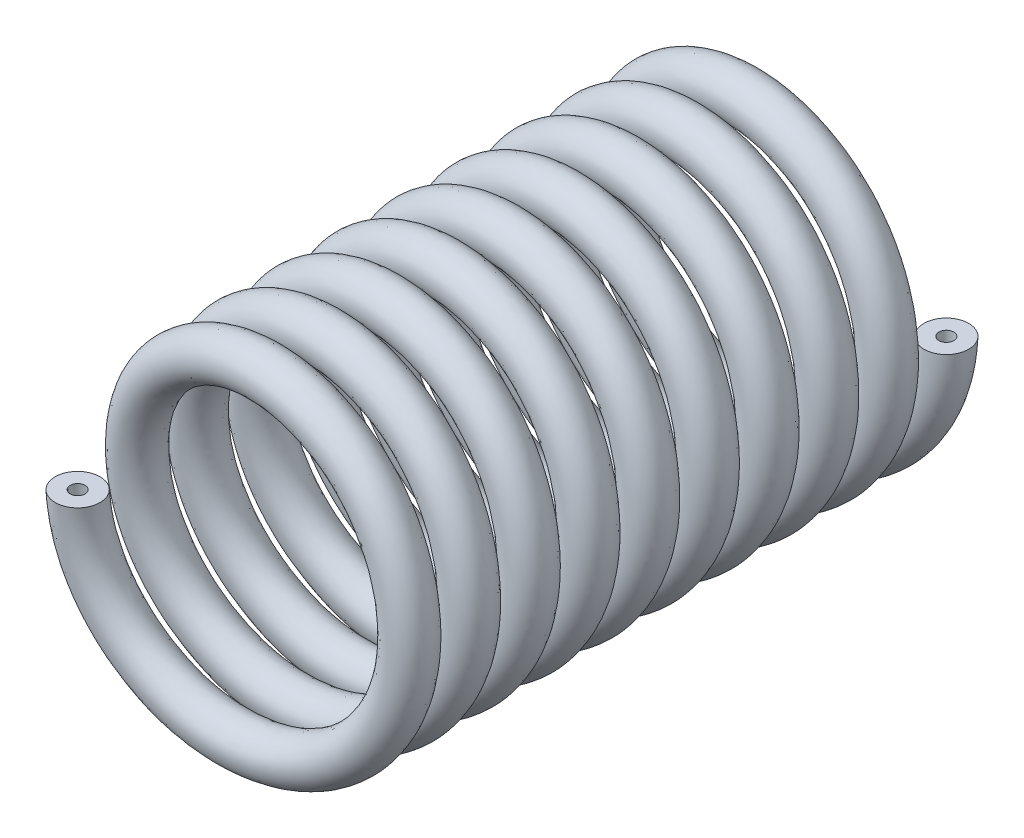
ISO-10303-21;
HEADER;
FILE_DESCRIPTION(('STEP AP214'),'2;1');
FILE_NAME('part.step','',(''),(''),'','','');
FILE_SCHEMA(('AUTOMOTIVE_DESIGN { 1 0 10303 214 1 1 1 1 }'));
ENDSEC;
DATA;
#1=APPLICATION_CONTEXT('core data for automotive mechanical design processes');
#2=APPLICATION_PROTOCOL_DEFINITION('international standard','automotive_design',2000,#1);
#3=PRODUCT_CONTEXT('',#1,'mechanical');
#4=PRODUCT('Part','Part','',(#3));
#5=PRODUCT_RELATED_PRODUCT_CATEGORY('part','',(#4));
#6=PRODUCT_DEFINITION_FORMATION('','',#4);
#7=PRODUCT_DEFINITION_CONTEXT('part definition',#1,'design');
#8=PRODUCT_DEFINITION('design','',#6,#7);
#9=PRODUCT_DEFINITION_SHAPE('','',#8);
#10=(LENGTH_UNIT() NAMED_UNIT(*) SI_UNIT(.MILLI.,.METRE.));
#11=(NAMED_UNIT(*) PLANE_ANGLE_UNIT() SI_UNIT($,.RADIAN.));
#12=(NAMED_UNIT(*) SI_UNIT($,.STERADIAN.) SOLID_ANGLE_UNIT());
#13=UNCERTAINTY_MEASURE_WITH_UNIT(LENGTH_MEASURE(1.E-05),#10,'distance_accuracy_value','');
#14=(GEOMETRIC_REPRESENTATION_CONTEXT(3) GLOBAL_UNCERTAINTY_ASSIGNED_CONTEXT((#13)) GLOBAL_UNIT_ASSIGNED_CONTEXT((#10,
#11,#12)) REPRESENTATION_CONTEXT('',''));
#15=CARTESIAN_POINT('',(0.,0.,0.));
#16=DIRECTION('',(0.,0.,1.));
#17=DIRECTION('',(1.,0.,0.));
#18=AXIS2_PLACEMENT_3D('',#15,#16,#17);
#19=CARTESIAN_POINT('',(10.1031919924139,0.,1.5));
#20=CARTESIAN_POINT('',(10.1031919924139,-5.83308061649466,1.83333333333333));
#21=CARTESIAN_POINT('',(5.05159599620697,-8.74962092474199,2.16666666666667));
#22=CARTESIAN_POINT('',(0.,-11.6661612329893,2.5));
#23=CARTESIAN_POINT('',(-5.05159599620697,-8.74962092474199,2.83333333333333));
#24=CARTESIAN_POINT('',(-10.1031919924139,-5.83308061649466,3.16666666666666));
#25=CARTESIAN_POINT('',(-10.1031919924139,0.,3.5));
#26=CARTESIAN_POINT('',(-10.1031919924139,5.83308061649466,3.83333333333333));
#27=CARTESIAN_POINT('',(-5.05159599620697,8.74962092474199,4.16666666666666));
#28=CARTESIAN_POINT('',(0.,11.6661612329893,4.49999999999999));
#29=CARTESIAN_POINT('',(5.05159599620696,8.749620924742,4.83333333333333));
#30=CARTESIAN_POINT('',(10.1031919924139,5.83308061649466,5.16666666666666));
#31=CARTESIAN_POINT('',(10.1031919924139,0.,5.49999999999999));
#32=CARTESIAN_POINT('',(10.1031919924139,-5.83308061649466,5.83333333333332));
#33=CARTESIAN_POINT('',(5.05159599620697,-8.74962092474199,6.16666666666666));
#34=CARTESIAN_POINT('',(0.,-11.6661612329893,6.49999999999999));
#35=CARTESIAN_POINT('',(-5.05159599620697,-8.74962092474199,6.83333333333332));
#36=CARTESIAN_POINT('',(-10.1031919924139,-5.83308061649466,7.16666666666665));
#37=CARTESIAN_POINT('',(-10.1031919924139,0.,7.49999999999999));
#38=CARTESIAN_POINT('',(-10.1031919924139,5.83308061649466,7.83333333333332));
#39=CARTESIAN_POINT('',(-5.05159599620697,8.74962092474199,8.16666666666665));
#40=CARTESIAN_POINT('',(0.,11.6661612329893,8.49999999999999));
#41=CARTESIAN_POINT('',(5.05159599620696,8.749620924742,8.83333333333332));
#42=CARTESIAN_POINT('',(10.1031919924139,5.83308061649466,9.16666666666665));
#43=CARTESIAN_POINT('',(10.1031919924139,0.,9.49999999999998));
#44=CARTESIAN_POINT('',(10.1031919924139,-5.83308061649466,9.83333333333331));
#45=CARTESIAN_POINT('',(5.05159599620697,-8.74962092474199,10.1666666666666));
#46=CARTESIAN_POINT('',(0.,-11.6661612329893,10.5));
#47=CARTESIAN_POINT('',(-5.05159599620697,-8.74962092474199,10.8333333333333));
#48=CARTESIAN_POINT('',(-10.1031919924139,-5.83308061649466,11.1666666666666));
#49=CARTESIAN_POINT('',(-10.1031919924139,0.,11.5));
#50=CARTESIAN_POINT('',(-10.1031919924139,5.83308061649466,11.8333333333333));
#51=CARTESIAN_POINT('',(-5.05159599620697,8.74962092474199,12.1666666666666));
#52=CARTESIAN_POINT('',(0.,11.6661612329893,12.5));
#53=CARTESIAN_POINT('',(5.05159599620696,8.749620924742,12.8333333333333));
#54=CARTESIAN_POINT('',(10.1031919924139,5.83308061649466,13.1666666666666));
#55=CARTESIAN_POINT('',(10.1031919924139,0.,13.5));
#56=CARTESIAN_POINT('',(10.1031919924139,-5.83308061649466,13.8333333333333));
#57=CARTESIAN_POINT('',(5.05159599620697,-8.74962092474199,14.1666666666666));
#58=CARTESIAN_POINT('',(0.,-11.6661612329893,14.5));
#59=CARTESIAN_POINT('',(-5.05159599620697,-8.74962092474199,14.8333333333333));
#60=CARTESIAN_POINT('',(-10.1031919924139,-5.83308061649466,15.1666666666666));
#61=CARTESIAN_POINT('',(-10.1031919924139,0.,15.5));
#62=CARTESIAN_POINT('',(-10.1031919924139,5.83308061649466,15.8333333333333));
#63=CARTESIAN_POINT('',(-5.05159599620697,8.74962092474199,16.1666666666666));
#64=CARTESIAN_POINT('',(0.,11.6661612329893,16.5));
#65=CARTESIAN_POINT('',(5.05159599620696,8.749620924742,16.8333333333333));
#66=CARTESIAN_POINT('',(10.1031919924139,5.83308061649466,17.1666666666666));
#67=CARTESIAN_POINT('',(10.1031919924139,0.,17.5));
#68=CARTESIAN_POINT('',(10.1031919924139,-5.83308061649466,17.8333333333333));
#69=CARTESIAN_POINT('',(5.05159599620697,-8.74962092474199,18.1666666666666));
#70=CARTESIAN_POINT('',(0.,-11.6661612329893,18.5));
#71=CARTESIAN_POINT('',(-5.05159599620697,-8.74962092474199,18.8333333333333));
#72=CARTESIAN_POINT('',(-10.1031919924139,-5.83308061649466,19.1666666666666));
#73=CARTESIAN_POINT('',(-10.1031919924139,0.,19.5));
#74=CARTESIAN_POINT('',(-10.1031919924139,5.83308061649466,19.8333333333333));
#75=CARTESIAN_POINT('',(-5.05159599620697,8.74962092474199,20.1666666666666));
#76=CARTESIAN_POINT('',(0.,11.6661612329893,20.5));
#77=CARTESIAN_POINT('',(5.05159599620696,8.749620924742,20.8333333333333));
#78=CARTESIAN_POINT('',(10.1031919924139,5.83308061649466,21.1666666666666));
#79=CARTESIAN_POINT('',(10.1031919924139,0.,21.5));
#80=CARTESIAN_POINT('',(10.1031919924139,-5.83308061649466,21.8333333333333));
#81=CARTESIAN_POINT('',(5.05159599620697,-8.74962092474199,22.1666666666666));
#82=CARTESIAN_POINT('',(0.,-11.6661612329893,22.5));
#83=CARTESIAN_POINT('',(-5.05159599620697,-8.74962092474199,22.8333333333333));
#84=CARTESIAN_POINT('',(-10.1031919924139,-5.83308061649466,23.1666666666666));
#85=CARTESIAN_POINT('',(-10.1031919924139,0.,23.5));
#86=CARTESIAN_POINT('',(-10.1031919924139,5.83308061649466,23.8333333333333));
#87=CARTESIAN_POINT('',(-5.05159599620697,8.74962092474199,24.1666666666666));
#88=CARTESIAN_POINT('',(0.,11.6661612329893,24.5));
#89=CARTESIAN_POINT('',(5.05159599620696,8.749620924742,24.8333333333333));
#90=CARTESIAN_POINT('',(10.1031919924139,5.83308061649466,25.1666666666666));
#91=CARTESIAN_POINT('',(10.1031919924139,0.,25.4999999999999));
#92=CARTESIAN_POINT('',(10.1031919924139,-5.83308061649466,25.8333333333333));
#93=CARTESIAN_POINT('',(5.05159599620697,-8.74962092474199,26.1666666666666));
#94=CARTESIAN_POINT('',(0.,-11.6661612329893,26.4999999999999));
#95=CARTESIAN_POINT('',(-5.05159599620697,-8.74962092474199,26.8333333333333));
#96=CARTESIAN_POINT('',(-10.1031919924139,-5.83308061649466,27.1666666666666));
#97=CARTESIAN_POINT('',(-10.1031919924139,0.,27.4999999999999));
#98=CARTESIAN_POINT('',(-10.1031919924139,5.83308061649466,27.8333333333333));
#99=CARTESIAN_POINT('',(-5.05159599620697,8.74962092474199,28.1666666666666));
#100=CARTESIAN_POINT('',(0.,11.6661612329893,28.4999999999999));
#101=CARTESIAN_POINT('',(5.05159599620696,8.749620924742,28.8333333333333));
#102=CARTESIAN_POINT('',(10.1031919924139,5.83308061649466,29.1666666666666));
#103=CARTESIAN_POINT('',(10.1031919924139,0.,29.4999999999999));
#104=CARTESIAN_POINT('',(10.1031919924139,-5.83308061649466,29.8333333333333));
#105=CARTESIAN_POINT('',(5.05159599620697,-8.74962092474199,30.1666666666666));
#106=CARTESIAN_POINT('',(0.,-11.6661612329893,30.4999999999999));
#107=CARTESIAN_POINT('',(-5.05159599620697,-8.74962092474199,30.8333333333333));
#108=CARTESIAN_POINT('',(-10.1031919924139,-5.83308061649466,31.1666666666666));
#109=CARTESIAN_POINT('',(-10.1031919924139,0.,31.4999999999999));
#110=CARTESIAN_POINT('',(-10.1031919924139,5.83308061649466,31.8333333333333));
#111=CARTESIAN_POINT('',(-5.05159599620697,8.74962092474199,32.1666666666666));
#112=CARTESIAN_POINT('',(0.,11.6661612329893,32.4999999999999));
#113=CARTESIAN_POINT('',(5.05159599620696,8.749620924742,32.8333333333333));
#114=CARTESIAN_POINT('',(10.1031919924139,5.83308061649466,33.1666666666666));
#115=CARTESIAN_POINT('',(10.1031919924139,0.,33.4999999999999));
#116=CARTESIAN_POINT('',(10.1031919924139,-5.83308061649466,33.8333333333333));
#117=CARTESIAN_POINT('',(5.05159599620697,-8.74962092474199,34.1666666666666));
#118=CARTESIAN_POINT('',(0.,-11.6661612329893,34.4999999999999));
#119=CARTESIAN_POINT('',(-5.05159599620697,-8.74962092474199,34.8333333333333));
#120=CARTESIAN_POINT('',(-10.1031919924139,-5.83308061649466,35.1666666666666));
#121=CARTESIAN_POINT('',(-10.1031919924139,0.,35.4999999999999));
#122=CARTESIAN_POINT('',(-10.1031919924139,5.83308061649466,35.8333333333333));
#123=CARTESIAN_POINT('',(-5.05159599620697,8.74962092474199,36.1666666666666));
#124=CARTESIAN_POINT('',(0.,11.6661612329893,36.4999999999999));
#125=CARTESIAN_POINT('',(5.05159599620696,8.749620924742,36.8333333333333));
#126=CARTESIAN_POINT('',(10.1031919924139,5.83308061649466,37.1666666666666));
#127=CARTESIAN_POINT('',(10.1031919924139,0.,37.4999999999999));
#128=CARTESIAN_POINT('',(10.1031919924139,-5.83308061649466,37.8333333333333));
#129=CARTESIAN_POINT('',(5.05159599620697,-8.74962092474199,38.1666666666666));
#130=CARTESIAN_POINT('',(0.,-11.6661612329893,38.4999999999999));
#131=CARTESIAN_POINT('',(-5.05159599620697,-8.74962092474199,38.8333333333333));
#132=CARTESIAN_POINT('',(-10.1031919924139,-5.83308061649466,39.1666666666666));
#133=CARTESIAN_POINT('',(-10.1031919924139,0.,39.4999999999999));
#134=CARTESIAN_POINT('',(-10.1031919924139,5.83308061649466,39.8333333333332));
#135=CARTESIAN_POINT('',(-5.05159599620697,8.74962092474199,40.1666666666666));
#136=CARTESIAN_POINT('',(0.,11.6661612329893,40.4999999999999));
#137=CARTESIAN_POINT('',(5.05159599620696,8.749620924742,40.8333333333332));
#138=CARTESIAN_POINT('',(10.1031919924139,5.83308061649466,41.1666666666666));
#139=CARTESIAN_POINT('',(10.1031919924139,0.,41.4999999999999));
#140=CARTESIAN_POINT('',(13.1031919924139,0.,1.5));
#141=CARTESIAN_POINT('',(13.1031919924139,-7.56513142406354,1.83333333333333));
#142=CARTESIAN_POINT('',(6.55159599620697,-11.3476971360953,2.16666666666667));
#143=CARTESIAN_POINT('',(0.,-15.1302628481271,2.5));
#144=CARTESIAN_POINT('',(-6.55159599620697,-11.3476971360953,2.83333333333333));
#145=CARTESIAN_POINT('',(-13.1031919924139,-7.56513142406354,3.16666666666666));
#146=CARTESIAN_POINT('',(-13.1031919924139,0.,3.5));
#147=CARTESIAN_POINT('',(-13.1031919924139,7.56513142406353,3.83333333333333));
#148=CARTESIAN_POINT('',(-6.55159599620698,11.3476971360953,4.16666666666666));
#149=CARTESIAN_POINT('',(0.,15.1302628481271,4.49999999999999));
#150=CARTESIAN_POINT('',(6.55159599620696,11.3476971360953,4.83333333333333));
#151=CARTESIAN_POINT('',(13.1031919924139,7.56513142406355,5.16666666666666));
#152=CARTESIAN_POINT('',(13.1031919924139,0.,5.49999999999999));
#153=CARTESIAN_POINT('',(13.1031919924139,-7.56513142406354,5.83333333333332));
#154=CARTESIAN_POINT('',(6.55159599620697,-11.3476971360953,6.16666666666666));
#155=CARTESIAN_POINT('',(0.,-15.1302628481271,6.49999999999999));
#156=CARTESIAN_POINT('',(-6.55159599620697,-11.3476971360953,6.83333333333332));
#157=CARTESIAN_POINT('',(-13.1031919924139,-7.56513142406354,7.16666666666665));
#158=CARTESIAN_POINT('',(-13.1031919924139,0.,7.49999999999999));
#159=CARTESIAN_POINT('',(-13.1031919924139,7.56513142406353,7.83333333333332));
#160=CARTESIAN_POINT('',(-6.55159599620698,11.3476971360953,8.16666666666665));
#161=CARTESIAN_POINT('',(0.,15.1302628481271,8.49999999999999));
#162=CARTESIAN_POINT('',(6.55159599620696,11.3476971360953,8.83333333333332));
#163=CARTESIAN_POINT('',(13.1031919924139,7.56513142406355,9.16666666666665));
#164=CARTESIAN_POINT('',(13.1031919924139,0.,9.49999999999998));
#165=CARTESIAN_POINT('',(13.1031919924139,-7.56513142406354,9.83333333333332));
#166=CARTESIAN_POINT('',(6.55159599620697,-11.3476971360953,10.1666666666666));
#167=CARTESIAN_POINT('',(0.,-15.1302628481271,10.5));
#168=CARTESIAN_POINT('',(-6.55159599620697,-11.3476971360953,10.8333333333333));
#169=CARTESIAN_POINT('',(-13.1031919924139,-7.56513142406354,11.1666666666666));
#170=CARTESIAN_POINT('',(-13.1031919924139,0.,11.5));
#171=CARTESIAN_POINT('',(-13.1031919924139,7.56513142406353,11.8333333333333));
#172=CARTESIAN_POINT('',(-6.55159599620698,11.3476971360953,12.1666666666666));
#173=CARTESIAN_POINT('',(0.,15.1302628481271,12.5));
#174=CARTESIAN_POINT('',(6.55159599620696,11.3476971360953,12.8333333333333));
#175=CARTESIAN_POINT('',(13.1031919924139,7.56513142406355,13.1666666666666));
#176=CARTESIAN_POINT('',(13.1031919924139,0.,13.5));
#177=CARTESIAN_POINT('',(13.1031919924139,-7.56513142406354,13.8333333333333));
#178=CARTESIAN_POINT('',(6.55159599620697,-11.3476971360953,14.1666666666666));
#179=CARTESIAN_POINT('',(0.,-15.1302628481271,14.5));
#180=CARTESIAN_POINT('',(-6.55159599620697,-11.3476971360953,14.8333333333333));
#181=CARTESIAN_POINT('',(-13.1031919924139,-7.56513142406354,15.1666666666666));
#182=CARTESIAN_POINT('',(-13.1031919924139,0.,15.5));
#183=CARTESIAN_POINT('',(-13.1031919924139,7.56513142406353,15.8333333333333));
#184=CARTESIAN_POINT('',(-6.55159599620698,11.3476971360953,16.1666666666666));
#185=CARTESIAN_POINT('',(0.,15.1302628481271,16.5));
#186=CARTESIAN_POINT('',(6.55159599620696,11.3476971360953,16.8333333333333));
#187=CARTESIAN_POINT('',(13.1031919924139,7.56513142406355,17.1666666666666));
#188=CARTESIAN_POINT('',(13.1031919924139,0.,17.5));
#189=CARTESIAN_POINT('',(13.1031919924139,-7.56513142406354,17.8333333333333));
#190=CARTESIAN_POINT('',(6.55159599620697,-11.3476971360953,18.1666666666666));
#191=CARTESIAN_POINT('',(0.,-15.1302628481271,18.5));
#192=CARTESIAN_POINT('',(-6.55159599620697,-11.3476971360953,18.8333333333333));
#193=CARTESIAN_POINT('',(-13.1031919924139,-7.56513142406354,19.1666666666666));
#194=CARTESIAN_POINT('',(-13.1031919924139,0.,19.5));
#195=CARTESIAN_POINT('',(-13.1031919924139,7.56513142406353,19.8333333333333));
#196=CARTESIAN_POINT('',(-6.55159599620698,11.3476971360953,20.1666666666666));
#197=CARTESIAN_POINT('',(0.,15.1302628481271,20.5));
#198=CARTESIAN_POINT('',(6.55159599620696,11.3476971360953,20.8333333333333));
#199=CARTESIAN_POINT('',(13.1031919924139,7.56513142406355,21.1666666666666));
#200=CARTESIAN_POINT('',(13.1031919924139,0.,21.5));
#201=CARTESIAN_POINT('',(13.1031919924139,-7.56513142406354,21.8333333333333));
#202=CARTESIAN_POINT('',(6.55159599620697,-11.3476971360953,22.1666666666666));
#203=CARTESIAN_POINT('',(0.,-15.1302628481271,22.5));
#204=CARTESIAN_POINT('',(-6.55159599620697,-11.3476971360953,22.8333333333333));
#205=CARTESIAN_POINT('',(-13.1031919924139,-7.56513142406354,23.1666666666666));
#206=CARTESIAN_POINT('',(-13.1031919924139,0.,23.5));
#207=CARTESIAN_POINT('',(-13.1031919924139,7.56513142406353,23.8333333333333));
#208=CARTESIAN_POINT('',(-6.55159599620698,11.3476971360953,24.1666666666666));
#209=CARTESIAN_POINT('',(0.,15.1302628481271,24.5));
#210=CARTESIAN_POINT('',(6.55159599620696,11.3476971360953,24.8333333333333));
#211=CARTESIAN_POINT('',(13.1031919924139,7.56513142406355,25.1666666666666));
#212=CARTESIAN_POINT('',(13.1031919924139,0.,25.4999999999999));
#213=CARTESIAN_POINT('',(13.1031919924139,-7.56513142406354,25.8333333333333));
#214=CARTESIAN_POINT('',(6.55159599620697,-11.3476971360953,26.1666666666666));
#215=CARTESIAN_POINT('',(0.,-15.1302628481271,26.4999999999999));
#216=CARTESIAN_POINT('',(-6.55159599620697,-11.3476971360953,26.8333333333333));
#217=CARTESIAN_POINT('',(-13.1031919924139,-7.56513142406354,27.1666666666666));
#218=CARTESIAN_POINT('',(-13.1031919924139,0.,27.4999999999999));
#219=CARTESIAN_POINT('',(-13.1031919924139,7.56513142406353,27.8333333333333));
#220=CARTESIAN_POINT('',(-6.55159599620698,11.3476971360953,28.1666666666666));
#221=CARTESIAN_POINT('',(0.,15.1302628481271,28.4999999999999));
#222=CARTESIAN_POINT('',(6.55159599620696,11.3476971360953,28.8333333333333));
#223=CARTESIAN_POINT('',(13.1031919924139,7.56513142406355,29.1666666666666));
#224=CARTESIAN_POINT('',(13.1031919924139,0.,29.4999999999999));
#225=CARTESIAN_POINT('',(13.1031919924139,-7.56513142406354,29.8333333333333));
#226=CARTESIAN_POINT('',(6.55159599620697,-11.3476971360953,30.1666666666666));
#227=CARTESIAN_POINT('',(0.,-15.1302628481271,30.4999999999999));
#228=CARTESIAN_POINT('',(-6.55159599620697,-11.3476971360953,30.8333333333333));
#229=CARTESIAN_POINT('',(-13.1031919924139,-7.56513142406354,31.1666666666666));
#230=CARTESIAN_POINT('',(-13.1031919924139,0.,31.4999999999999));
#231=CARTESIAN_POINT('',(-13.1031919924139,7.56513142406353,31.8333333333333));
#232=CARTESIAN_POINT('',(-6.55159599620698,11.3476971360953,32.1666666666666));
#233=CARTESIAN_POINT('',(0.,15.1302628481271,32.4999999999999));
#234=CARTESIAN_POINT('',(6.55159599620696,11.3476971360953,32.8333333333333));
#235=CARTESIAN_POINT('',(13.1031919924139,7.56513142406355,33.1666666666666));
#236=CARTESIAN_POINT('',(13.1031919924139,0.,33.4999999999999));
#237=CARTESIAN_POINT('',(13.1031919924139,-7.56513142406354,33.8333333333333));
#238=CARTESIAN_POINT('',(6.55159599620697,-11.3476971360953,34.1666666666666));
#239=CARTESIAN_POINT('',(0.,-15.1302628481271,34.4999999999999));
#240=CARTESIAN_POINT('',(-6.55159599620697,-11.3476971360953,34.8333333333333));
#241=CARTESIAN_POINT('',(-13.1031919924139,-7.56513142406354,35.1666666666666));
#242=CARTESIAN_POINT('',(-13.1031919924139,0.,35.4999999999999));
#243=CARTESIAN_POINT('',(-13.1031919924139,7.56513142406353,35.8333333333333));
#244=CARTESIAN_POINT('',(-6.55159599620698,11.3476971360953,36.1666666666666));
#245=CARTESIAN_POINT('',(0.,15.1302628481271,36.4999999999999));
#246=CARTESIAN_POINT('',(6.55159599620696,11.3476971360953,36.8333333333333));
#247=CARTESIAN_POINT('',(13.1031919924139,7.56513142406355,37.1666666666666));
#248=CARTESIAN_POINT('',(13.1031919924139,0.,37.4999999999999));
#249=CARTESIAN_POINT('',(13.1031919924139,-7.56513142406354,37.8333333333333));
#250=CARTESIAN_POINT('',(6.55159599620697,-11.3476971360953,38.1666666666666));
#251=CARTESIAN_POINT('',(0.,-15.1302628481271,38.4999999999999));
#252=CARTESIAN_POINT('',(-6.55159599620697,-11.3476971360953,38.8333333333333));
#253=CARTESIAN_POINT('',(-13.1031919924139,-7.56513142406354,39.1666666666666));
#254=CARTESIAN_POINT('',(-13.1031919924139,0.,39.4999999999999));
#255=CARTESIAN_POINT('',(-13.1031919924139,7.56513142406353,39.8333333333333));
#256=CARTESIAN_POINT('',(-6.55159599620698,11.3476971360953,40.1666666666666));
#257=CARTESIAN_POINT('',(0.,15.1302628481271,40.4999999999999));
#258=CARTESIAN_POINT('',(6.55159599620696,11.3476971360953,40.8333333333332));
#259=CARTESIAN_POINT('',(13.1031919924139,7.56513142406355,41.1666666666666));
#260=CARTESIAN_POINT('',(13.1031919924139,0.,41.4999999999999));
#261=CARTESIAN_POINT('',(13.1031919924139,0.,-1.5));
#262=CARTESIAN_POINT('',(13.1031919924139,-7.56513142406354,-1.16666666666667));
#263=CARTESIAN_POINT('',(6.55159599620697,-11.3476971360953,-0.833333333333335));
#264=CARTESIAN_POINT('',(0.,-15.1302628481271,-0.500000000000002));
#265=CARTESIAN_POINT('',(-6.55159599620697,-11.3476971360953,-0.16666666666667));
#266=CARTESIAN_POINT('',(-13.1031919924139,-7.56513142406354,0.166666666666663));
#267=CARTESIAN_POINT('',(-13.1031919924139,0.,0.499999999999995));
#268=CARTESIAN_POINT('',(-13.1031919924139,7.56513142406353,0.833333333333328));
#269=CARTESIAN_POINT('',(-6.55159599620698,11.3476971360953,1.16666666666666));
#270=CARTESIAN_POINT('',(0.,15.1302628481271,1.49999999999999));
#271=CARTESIAN_POINT('',(6.55159599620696,11.3476971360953,1.83333333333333));
#272=CARTESIAN_POINT('',(13.1031919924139,7.56513142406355,2.16666666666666));
#273=CARTESIAN_POINT('',(13.1031919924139,0.,2.49999999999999));
#274=CARTESIAN_POINT('',(13.1031919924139,-7.56513142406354,2.83333333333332));
#275=CARTESIAN_POINT('',(6.55159599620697,-11.3476971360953,3.16666666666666));
#276=CARTESIAN_POINT('',(0.,-15.1302628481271,3.49999999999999));
#277=CARTESIAN_POINT('',(-6.55159599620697,-11.3476971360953,3.83333333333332));
#278=CARTESIAN_POINT('',(-13.1031919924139,-7.56513142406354,4.16666666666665));
#279=CARTESIAN_POINT('',(-13.1031919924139,0.,4.49999999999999));
#280=CARTESIAN_POINT('',(-13.1031919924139,7.56513142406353,4.83333333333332));
#281=CARTESIAN_POINT('',(-6.55159599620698,11.3476971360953,5.16666666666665));
#282=CARTESIAN_POINT('',(0.,15.1302628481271,5.49999999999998));
#283=CARTESIAN_POINT('',(6.55159599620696,11.3476971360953,5.83333333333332));
#284=CARTESIAN_POINT('',(13.1031919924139,7.56513142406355,6.16666666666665));
#285=CARTESIAN_POINT('',(13.1031919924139,0.,6.49999999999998));
#286=CARTESIAN_POINT('',(13.1031919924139,-7.56513142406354,6.83333333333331));
#287=CARTESIAN_POINT('',(6.55159599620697,-11.3476971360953,7.16666666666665));
#288=CARTESIAN_POINT('',(0.,-15.1302628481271,7.49999999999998));
#289=CARTESIAN_POINT('',(-6.55159599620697,-11.3476971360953,7.83333333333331));
#290=CARTESIAN_POINT('',(-13.1031919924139,-7.56513142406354,8.16666666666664));
#291=CARTESIAN_POINT('',(-13.1031919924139,0.,8.49999999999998));
#292=CARTESIAN_POINT('',(-13.1031919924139,7.56513142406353,8.83333333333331));
#293=CARTESIAN_POINT('',(-6.55159599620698,11.3476971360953,9.16666666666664));
#294=CARTESIAN_POINT('',(0.,15.1302628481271,9.49999999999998));
#295=CARTESIAN_POINT('',(6.55159599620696,11.3476971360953,9.83333333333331));
#296=CARTESIAN_POINT('',(13.1031919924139,7.56513142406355,10.1666666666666));
#297=CARTESIAN_POINT('',(13.1031919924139,0.,10.5));
#298=CARTESIAN_POINT('',(13.1031919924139,-7.56513142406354,10.8333333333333));
#299=CARTESIAN_POINT('',(6.55159599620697,-11.3476971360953,11.1666666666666));
#300=CARTESIAN_POINT('',(0.,-15.1302628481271,11.5));
#301=CARTESIAN_POINT('',(-6.55159599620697,-11.3476971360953,11.8333333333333));
#302=CARTESIAN_POINT('',(-13.1031919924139,-7.56513142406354,12.1666666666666));
#303=CARTESIAN_POINT('',(-13.1031919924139,0.,12.5));
#304=CARTESIAN_POINT('',(-13.1031919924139,7.56513142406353,12.8333333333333));
#305=CARTESIAN_POINT('',(-6.55159599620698,11.3476971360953,13.1666666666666));
#306=CARTESIAN_POINT('',(0.,15.1302628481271,13.5));
#307=CARTESIAN_POINT('',(6.55159599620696,11.3476971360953,13.8333333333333));
#308=CARTESIAN_POINT('',(13.1031919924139,7.56513142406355,14.1666666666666));
#309=CARTESIAN_POINT('',(13.1031919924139,0.,14.5));
#310=CARTESIAN_POINT('',(13.1031919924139,-7.56513142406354,14.8333333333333));
#311=CARTESIAN_POINT('',(6.55159599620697,-11.3476971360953,15.1666666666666));
#312=CARTESIAN_POINT('',(0.,-15.1302628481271,15.5));
#313=CARTESIAN_POINT('',(-6.55159599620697,-11.3476971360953,15.8333333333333));
#314=CARTESIAN_POINT('',(-13.1031919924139,-7.56513142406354,16.1666666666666));
#315=CARTESIAN_POINT('',(-13.1031919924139,0.,16.5));
#316=CARTESIAN_POINT('',(-13.1031919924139,7.56513142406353,16.8333333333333));
#317=CARTESIAN_POINT('',(-6.55159599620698,11.3476971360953,17.1666666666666));
#318=CARTESIAN_POINT('',(0.,15.1302628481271,17.5));
#319=CARTESIAN_POINT('',(6.55159599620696,11.3476971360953,17.8333333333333));
#320=CARTESIAN_POINT('',(13.1031919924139,7.56513142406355,18.1666666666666));
#321=CARTESIAN_POINT('',(13.1031919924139,0.,18.5));
#322=CARTESIAN_POINT('',(13.1031919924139,-7.56513142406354,18.8333333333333));
#323=CARTESIAN_POINT('',(6.55159599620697,-11.3476971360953,19.1666666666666));
#324=CARTESIAN_POINT('',(0.,-15.1302628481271,19.5));
#325=CARTESIAN_POINT('',(-6.55159599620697,-11.3476971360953,19.8333333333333));
#326=CARTESIAN_POINT('',(-13.1031919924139,-7.56513142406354,20.1666666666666));
#327=CARTESIAN_POINT('',(-13.1031919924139,0.,20.5));
#328=CARTESIAN_POINT('',(-13.1031919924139,7.56513142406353,20.8333333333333));
#329=CARTESIAN_POINT('',(-6.55159599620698,11.3476971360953,21.1666666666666));
#330=CARTESIAN_POINT('',(0.,15.1302628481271,21.4999999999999));
#331=CARTESIAN_POINT('',(6.55159599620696,11.3476971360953,21.8333333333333));
#332=CARTESIAN_POINT('',(13.1031919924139,7.56513142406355,22.1666666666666));
#333=CARTESIAN_POINT('',(13.1031919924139,0.,22.4999999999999));
#334=CARTESIAN_POINT('',(13.1031919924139,-7.56513142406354,22.8333333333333));
#335=CARTESIAN_POINT('',(6.55159599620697,-11.3476971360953,23.1666666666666));
#336=CARTESIAN_POINT('',(0.,-15.1302628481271,23.4999999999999));
#337=CARTESIAN_POINT('',(-6.55159599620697,-11.3476971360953,23.8333333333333));
#338=CARTESIAN_POINT('',(-13.1031919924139,-7.56513142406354,24.1666666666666));
#339=CARTESIAN_POINT('',(-13.1031919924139,0.,24.4999999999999));
#340=CARTESIAN_POINT('',(-13.1031919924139,7.56513142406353,24.8333333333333));
#341=CARTESIAN_POINT('',(-6.55159599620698,11.3476971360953,25.1666666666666));
#342=CARTESIAN_POINT('',(0.,15.1302628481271,25.4999999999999));
#343=CARTESIAN_POINT('',(6.55159599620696,11.3476971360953,25.8333333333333));
#344=CARTESIAN_POINT('',(13.1031919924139,7.56513142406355,26.1666666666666));
#345=CARTESIAN_POINT('',(13.1031919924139,0.,26.4999999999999));
#346=CARTESIAN_POINT('',(13.1031919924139,-7.56513142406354,26.8333333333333));
#347=CARTESIAN_POINT('',(6.55159599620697,-11.3476971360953,27.1666666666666));
#348=CARTESIAN_POINT('',(0.,-15.1302628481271,27.4999999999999));
#349=CARTESIAN_POINT('',(-6.55159599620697,-11.3476971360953,27.8333333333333));
#350=CARTESIAN_POINT('',(-13.1031919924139,-7.56513142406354,28.1666666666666));
#351=CARTESIAN_POINT('',(-13.1031919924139,0.,28.4999999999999));
#352=CARTESIAN_POINT('',(-13.1031919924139,7.56513142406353,28.8333333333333));
#353=CARTESIAN_POINT('',(-6.55159599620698,11.3476971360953,29.1666666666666));
#354=CARTESIAN_POINT('',(0.,15.1302628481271,29.4999999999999));
#355=CARTESIAN_POINT('',(6.55159599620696,11.3476971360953,29.8333333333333));
#356=CARTESIAN_POINT('',(13.1031919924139,7.56513142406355,30.1666666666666));
#357=CARTESIAN_POINT('',(13.1031919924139,0.,30.4999999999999));
#358=CARTESIAN_POINT('',(13.1031919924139,-7.56513142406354,30.8333333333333));
#359=CARTESIAN_POINT('',(6.55159599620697,-11.3476971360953,31.1666666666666));
#360=CARTESIAN_POINT('',(0.,-15.1302628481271,31.4999999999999));
#361=CARTESIAN_POINT('',(-6.55159599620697,-11.3476971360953,31.8333333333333));
#362=CARTESIAN_POINT('',(-13.1031919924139,-7.56513142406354,32.1666666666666));
#363=CARTESIAN_POINT('',(-13.1031919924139,0.,32.4999999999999));
#364=CARTESIAN_POINT('',(-13.1031919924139,7.56513142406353,32.8333333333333));
#365=CARTESIAN_POINT('',(-6.55159599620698,11.3476971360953,33.1666666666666));
#366=CARTESIAN_POINT('',(0.,15.1302628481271,33.4999999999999));
#367=CARTESIAN_POINT('',(6.55159599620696,11.3476971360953,33.8333333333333));
#368=CARTESIAN_POINT('',(13.1031919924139,7.56513142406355,34.1666666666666));
#369=CARTESIAN_POINT('',(13.1031919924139,0.,34.4999999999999));
#370=CARTESIAN_POINT('',(13.1031919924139,-7.56513142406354,34.8333333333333));
#371=CARTESIAN_POINT('',(6.55159599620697,-11.3476971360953,35.1666666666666));
#372=CARTESIAN_POINT('',(0.,-15.1302628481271,35.4999999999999));
#373=CARTESIAN_POINT('',(-6.55159599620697,-11.3476971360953,35.8333333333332));
#374=CARTESIAN_POINT('',(-13.1031919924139,-7.56513142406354,36.1666666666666));
#375=CARTESIAN_POINT('',(-13.1031919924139,0.,36.4999999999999));
#376=CARTESIAN_POINT('',(-13.1031919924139,7.56513142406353,36.8333333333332));
#377=CARTESIAN_POINT('',(-6.55159599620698,11.3476971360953,37.1666666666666));
#378=CARTESIAN_POINT('',(0.,15.1302628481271,37.4999999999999));
#379=CARTESIAN_POINT('',(6.55159599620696,11.3476971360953,37.8333333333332));
#380=CARTESIAN_POINT('',(13.1031919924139,7.56513142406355,38.1666666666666));
#381=CARTESIAN_POINT('',(13.1031919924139,0.,38.4999999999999));
#382=CARTESIAN_POINT('',(10.1031919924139,0.,-1.5));
#383=CARTESIAN_POINT('',(10.1031919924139,-5.83308061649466,-1.16666666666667));
#384=CARTESIAN_POINT('',(5.05159599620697,-8.74962092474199,-0.833333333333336));
#385=CARTESIAN_POINT('',(0.,-11.6661612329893,-0.500000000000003));
#386=CARTESIAN_POINT('',(-5.05159599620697,-8.74962092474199,-0.16666666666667));
#387=CARTESIAN_POINT('',(-10.1031919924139,-5.83308061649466,0.166666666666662));
#388=CARTESIAN_POINT('',(-10.1031919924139,0.,0.499999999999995));
#389=CARTESIAN_POINT('',(-10.1031919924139,5.83308061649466,0.833333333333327));
#390=CARTESIAN_POINT('',(-5.05159599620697,8.74962092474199,1.16666666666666));
#391=CARTESIAN_POINT('',(0.,11.6661612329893,1.49999999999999));
#392=CARTESIAN_POINT('',(5.05159599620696,8.749620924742,1.83333333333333));
#393=CARTESIAN_POINT('',(10.1031919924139,5.83308061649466,2.16666666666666));
#394=CARTESIAN_POINT('',(10.1031919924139,0.,2.49999999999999));
#395=CARTESIAN_POINT('',(10.1031919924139,-5.83308061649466,2.83333333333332));
#396=CARTESIAN_POINT('',(5.05159599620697,-8.74962092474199,3.16666666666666));
#397=CARTESIAN_POINT('',(0.,-11.6661612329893,3.49999999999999));
#398=CARTESIAN_POINT('',(-5.05159599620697,-8.74962092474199,3.83333333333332));
#399=CARTESIAN_POINT('',(-10.1031919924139,-5.83308061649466,4.16666666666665));
#400=CARTESIAN_POINT('',(-10.1031919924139,0.,4.49999999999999));
#401=CARTESIAN_POINT('',(-10.1031919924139,5.83308061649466,4.83333333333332));
#402=CARTESIAN_POINT('',(-5.05159599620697,8.74962092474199,5.16666666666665));
#403=CARTESIAN_POINT('',(0.,11.6661612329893,5.49999999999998));
#404=CARTESIAN_POINT('',(5.05159599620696,8.749620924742,5.83333333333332));
#405=CARTESIAN_POINT('',(10.1031919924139,5.83308061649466,6.16666666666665));
#406=CARTESIAN_POINT('',(10.1031919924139,0.,6.49999999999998));
#407=CARTESIAN_POINT('',(10.1031919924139,-5.83308061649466,6.83333333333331));
#408=CARTESIAN_POINT('',(5.05159599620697,-8.74962092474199,7.16666666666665));
#409=CARTESIAN_POINT('',(0.,-11.6661612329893,7.49999999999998));
#410=CARTESIAN_POINT('',(-5.05159599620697,-8.74962092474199,7.83333333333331));
#411=CARTESIAN_POINT('',(-10.1031919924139,-5.83308061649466,8.16666666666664));
#412=CARTESIAN_POINT('',(-10.1031919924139,0.,8.49999999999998));
#413=CARTESIAN_POINT('',(-10.1031919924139,5.83308061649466,8.83333333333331));
#414=CARTESIAN_POINT('',(-5.05159599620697,8.74962092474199,9.16666666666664));
#415=CARTESIAN_POINT('',(0.,11.6661612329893,9.49999999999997));
#416=CARTESIAN_POINT('',(5.05159599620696,8.749620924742,9.83333333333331));
#417=CARTESIAN_POINT('',(10.1031919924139,5.83308061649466,10.1666666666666));
#418=CARTESIAN_POINT('',(10.1031919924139,0.,10.5));
#419=CARTESIAN_POINT('',(10.1031919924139,-5.83308061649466,10.8333333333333));
#420=CARTESIAN_POINT('',(5.05159599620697,-8.74962092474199,11.1666666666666));
#421=CARTESIAN_POINT('',(0.,-11.6661612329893,11.5));
#422=CARTESIAN_POINT('',(-5.05159599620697,-8.74962092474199,11.8333333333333));
#423=CARTESIAN_POINT('',(-10.1031919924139,-5.83308061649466,12.1666666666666));
#424=CARTESIAN_POINT('',(-10.1031919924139,0.,12.5));
#425=CARTESIAN_POINT('',(-10.1031919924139,5.83308061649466,12.8333333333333));
#426=CARTESIAN_POINT('',(-5.05159599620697,8.74962092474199,13.1666666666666));
#427=CARTESIAN_POINT('',(0.,11.6661612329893,13.5));
#428=CARTESIAN_POINT('',(5.05159599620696,8.749620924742,13.8333333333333));
#429=CARTESIAN_POINT('',(10.1031919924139,5.83308061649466,14.1666666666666));
#430=CARTESIAN_POINT('',(10.1031919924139,0.,14.5));
#431=CARTESIAN_POINT('',(10.1031919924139,-5.83308061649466,14.8333333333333));
#432=CARTESIAN_POINT('',(5.05159599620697,-8.74962092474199,15.1666666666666));
#433=CARTESIAN_POINT('',(0.,-11.6661612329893,15.5));
#434=CARTESIAN_POINT('',(-5.05159599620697,-8.74962092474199,15.8333333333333));
#435=CARTESIAN_POINT('',(-10.1031919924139,-5.83308061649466,16.1666666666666));
#436=CARTESIAN_POINT('',(-10.1031919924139,0.,16.5));
#437=CARTESIAN_POINT('',(-10.1031919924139,5.83308061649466,16.8333333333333));
#438=CARTESIAN_POINT('',(-5.05159599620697,8.74962092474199,17.1666666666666));
#439=CARTESIAN_POINT('',(0.,11.6661612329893,17.5));
#440=CARTESIAN_POINT('',(5.05159599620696,8.749620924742,17.8333333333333));
#441=CARTESIAN_POINT('',(10.1031919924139,5.83308061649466,18.1666666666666));
#442=CARTESIAN_POINT('',(10.1031919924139,0.,18.5));
#443=CARTESIAN_POINT('',(10.1031919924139,-5.83308061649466,18.8333333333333));
#444=CARTESIAN_POINT('',(5.05159599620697,-8.74962092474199,19.1666666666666));
#445=CARTESIAN_POINT('',(0.,-11.6661612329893,19.5));
#446=CARTESIAN_POINT('',(-5.05159599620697,-8.74962092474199,19.8333333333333));
#447=CARTESIAN_POINT('',(-10.1031919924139,-5.83308061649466,20.1666666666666));
#448=CARTESIAN_POINT('',(-10.1031919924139,0.,20.5));
#449=CARTESIAN_POINT('',(-10.1031919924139,5.83308061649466,20.8333333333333));
#450=CARTESIAN_POINT('',(-5.05159599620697,8.74962092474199,21.1666666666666));
#451=CARTESIAN_POINT('',(0.,11.6661612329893,21.4999999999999));
#452=CARTESIAN_POINT('',(5.05159599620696,8.749620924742,21.8333333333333));
#453=CARTESIAN_POINT('',(10.1031919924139,5.83308061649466,22.1666666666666));
#454=CARTESIAN_POINT('',(10.1031919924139,0.,22.4999999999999));
#455=CARTESIAN_POINT('',(10.1031919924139,-5.83308061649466,22.8333333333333));
#456=CARTESIAN_POINT('',(5.05159599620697,-8.74962092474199,23.1666666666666));
#457=CARTESIAN_POINT('',(0.,-11.6661612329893,23.4999999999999));
#458=CARTESIAN_POINT('',(-5.05159599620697,-8.74962092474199,23.8333333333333));
#459=CARTESIAN_POINT('',(-10.1031919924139,-5.83308061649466,24.1666666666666));
#460=CARTESIAN_POINT('',(-10.1031919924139,0.,24.4999999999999));
#461=CARTESIAN_POINT('',(-10.1031919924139,5.83308061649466,24.8333333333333));
#462=CARTESIAN_POINT('',(-5.05159599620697,8.74962092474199,25.1666666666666));
#463=CARTESIAN_POINT('',(0.,11.6661612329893,25.4999999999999));
#464=CARTESIAN_POINT('',(5.05159599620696,8.749620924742,25.8333333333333));
#465=CARTESIAN_POINT('',(10.1031919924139,5.83308061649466,26.1666666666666));
#466=CARTESIAN_POINT('',(10.1031919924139,0.,26.4999999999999));
#467=CARTESIAN_POINT('',(10.1031919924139,-5.83308061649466,26.8333333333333));
#468=CARTESIAN_POINT('',(5.05159599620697,-8.74962092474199,27.1666666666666));
#469=CARTESIAN_POINT('',(0.,-11.6661612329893,27.4999999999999));
#470=CARTESIAN_POINT('',(-5.05159599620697,-8.74962092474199,27.8333333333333));
#471=CARTESIAN_POINT('',(-10.1031919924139,-5.83308061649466,28.1666666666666));
#472=CARTESIAN_POINT('',(-10.1031919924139,0.,28.4999999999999));
#473=CARTESIAN_POINT('',(-10.1031919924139,5.83308061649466,28.8333333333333));
#474=CARTESIAN_POINT('',(-5.05159599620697,8.74962092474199,29.1666666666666));
#475=CARTESIAN_POINT('',(0.,11.6661612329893,29.4999999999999));
#476=CARTESIAN_POINT('',(5.05159599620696,8.749620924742,29.8333333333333));
#477=CARTESIAN_POINT('',(10.1031919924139,5.83308061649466,30.1666666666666));
#478=CARTESIAN_POINT('',(10.1031919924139,0.,30.4999999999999));
#479=CARTESIAN_POINT('',(10.1031919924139,-5.83308061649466,30.8333333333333));
#480=CARTESIAN_POINT('',(5.05159599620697,-8.74962092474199,31.1666666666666));
#481=CARTESIAN_POINT('',(0.,-11.6661612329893,31.4999999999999));
#482=CARTESIAN_POINT('',(-5.05159599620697,-8.74962092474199,31.8333333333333));
#483=CARTESIAN_POINT('',(-10.1031919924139,-5.83308061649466,32.1666666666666));
#484=CARTESIAN_POINT('',(-10.1031919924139,0.,32.4999999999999));
#485=CARTESIAN_POINT('',(-10.1031919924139,5.83308061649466,32.8333333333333));
#486=CARTESIAN_POINT('',(-5.05159599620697,8.74962092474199,33.1666666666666));
#487=CARTESIAN_POINT('',(0.,11.6661612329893,33.4999999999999));
#488=CARTESIAN_POINT('',(5.05159599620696,8.749620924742,33.8333333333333));
#489=CARTESIAN_POINT('',(10.1031919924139,5.83308061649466,34.1666666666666));
#490=CARTESIAN_POINT('',(10.1031919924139,0.,34.4999999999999));
#491=CARTESIAN_POINT('',(10.1031919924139,-5.83308061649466,34.8333333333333));
#492=CARTESIAN_POINT('',(5.05159599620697,-8.74962092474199,35.1666666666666));
#493=CARTESIAN_POINT('',(0.,-11.6661612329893,35.4999999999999));
#494=CARTESIAN_POINT('',(-5.05159599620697,-8.74962092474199,35.8333333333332));
#495=CARTESIAN_POINT('',(-10.1031919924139,-5.83308061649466,36.1666666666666));
#496=CARTESIAN_POINT('',(-10.1031919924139,0.,36.4999999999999));
#497=CARTESIAN_POINT('',(-10.1031919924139,5.83308061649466,36.8333333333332));
#498=CARTESIAN_POINT('',(-5.05159599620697,8.74962092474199,37.1666666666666));
#499=CARTESIAN_POINT('',(0.,11.6661612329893,37.4999999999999));
#500=CARTESIAN_POINT('',(5.05159599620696,8.749620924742,37.8333333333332));
#501=CARTESIAN_POINT('',(10.1031919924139,5.83308061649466,38.1666666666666));
#502=CARTESIAN_POINT('',(10.1031919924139,0.,38.4999999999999));
#503=CARTESIAN_POINT('',(7.10319199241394,0.,-1.5));
#504=CARTESIAN_POINT('',(7.10319199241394,-4.10102980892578,-1.16666666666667));
#505=CARTESIAN_POINT('',(3.55159599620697,-6.15154471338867,-0.833333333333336));
#506=CARTESIAN_POINT('',(0.,-8.20205961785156,-0.500000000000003));
#507=CARTESIAN_POINT('',(-3.55159599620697,-6.15154471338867,-0.166666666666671));
#508=CARTESIAN_POINT('',(-7.10319199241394,-4.10102980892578,0.166666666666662));
#509=CARTESIAN_POINT('',(-7.10319199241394,0.,0.499999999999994));
#510=CARTESIAN_POINT('',(-7.10319199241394,4.10102980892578,0.833333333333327));
#511=CARTESIAN_POINT('',(-3.55159599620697,6.15154471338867,1.16666666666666));
#512=CARTESIAN_POINT('',(0.,8.20205961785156,1.49999999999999));
#513=CARTESIAN_POINT('',(3.55159599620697,6.15154471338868,1.83333333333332));
#514=CARTESIAN_POINT('',(7.10319199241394,4.10102980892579,2.16666666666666));
#515=CARTESIAN_POINT('',(7.10319199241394,0.,2.49999999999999));
#516=CARTESIAN_POINT('',(7.10319199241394,-4.10102980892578,2.83333333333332));
#517=CARTESIAN_POINT('',(3.55159599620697,-6.15154471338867,3.16666666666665));
#518=CARTESIAN_POINT('',(0.,-8.20205961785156,3.49999999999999));
#519=CARTESIAN_POINT('',(-3.55159599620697,-6.15154471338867,3.83333333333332));
#520=CARTESIAN_POINT('',(-7.10319199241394,-4.10102980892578,4.16666666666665));
#521=CARTESIAN_POINT('',(-7.10319199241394,0.,4.49999999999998));
#522=CARTESIAN_POINT('',(-7.10319199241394,4.10102980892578,4.83333333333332));
#523=CARTESIAN_POINT('',(-3.55159599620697,6.15154471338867,5.16666666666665));
#524=CARTESIAN_POINT('',(0.,8.20205961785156,5.49999999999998));
#525=CARTESIAN_POINT('',(3.55159599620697,6.15154471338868,5.83333333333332));
#526=CARTESIAN_POINT('',(7.10319199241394,4.10102980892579,6.16666666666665));
#527=CARTESIAN_POINT('',(7.10319199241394,0.,6.49999999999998));
#528=CARTESIAN_POINT('',(7.10319199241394,-4.10102980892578,6.83333333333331));
#529=CARTESIAN_POINT('',(3.55159599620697,-6.15154471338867,7.16666666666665));
#530=CARTESIAN_POINT('',(0.,-8.20205961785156,7.49999999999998));
#531=CARTESIAN_POINT('',(-3.55159599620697,-6.15154471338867,7.83333333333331));
#532=CARTESIAN_POINT('',(-7.10319199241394,-4.10102980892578,8.16666666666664));
#533=CARTESIAN_POINT('',(-7.10319199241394,0.,8.49999999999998));
#534=CARTESIAN_POINT('',(-7.10319199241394,4.10102980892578,8.83333333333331));
#535=CARTESIAN_POINT('',(-3.55159599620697,6.15154471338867,9.16666666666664));
#536=CARTESIAN_POINT('',(0.,8.20205961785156,9.49999999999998));
#537=CARTESIAN_POINT('',(3.55159599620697,6.15154471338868,9.83333333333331));
#538=CARTESIAN_POINT('',(7.10319199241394,4.10102980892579,10.1666666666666));
#539=CARTESIAN_POINT('',(7.10319199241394,0.,10.5));
#540=CARTESIAN_POINT('',(7.10319199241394,-4.10102980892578,10.8333333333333));
#541=CARTESIAN_POINT('',(3.55159599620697,-6.15154471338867,11.1666666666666));
#542=CARTESIAN_POINT('',(0.,-8.20205961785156,11.5));
#543=CARTESIAN_POINT('',(-3.55159599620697,-6.15154471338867,11.8333333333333));
#544=CARTESIAN_POINT('',(-7.10319199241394,-4.10102980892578,12.1666666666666));
#545=CARTESIAN_POINT('',(-7.10319199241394,0.,12.5));
#546=CARTESIAN_POINT('',(-7.10319199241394,4.10102980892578,12.8333333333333));
#547=CARTESIAN_POINT('',(-3.55159599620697,6.15154471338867,13.1666666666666));
#548=CARTESIAN_POINT('',(0.,8.20205961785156,13.5));
#549=CARTESIAN_POINT('',(3.55159599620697,6.15154471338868,13.8333333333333));
#550=CARTESIAN_POINT('',(7.10319199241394,4.10102980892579,14.1666666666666));
#551=CARTESIAN_POINT('',(7.10319199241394,0.,14.5));
#552=CARTESIAN_POINT('',(7.10319199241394,-4.10102980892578,14.8333333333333));
#553=CARTESIAN_POINT('',(3.55159599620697,-6.15154471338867,15.1666666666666));
#554=CARTESIAN_POINT('',(0.,-8.20205961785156,15.5));
#555=CARTESIAN_POINT('',(-3.55159599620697,-6.15154471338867,15.8333333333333));
#556=CARTESIAN_POINT('',(-7.10319199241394,-4.10102980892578,16.1666666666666));
#557=CARTESIAN_POINT('',(-7.10319199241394,0.,16.5));
#558=CARTESIAN_POINT('',(-7.10319199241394,4.10102980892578,16.8333333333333));
#559=CARTESIAN_POINT('',(-3.55159599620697,6.15154471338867,17.1666666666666));
#560=CARTESIAN_POINT('',(0.,8.20205961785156,17.5));
#561=CARTESIAN_POINT('',(3.55159599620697,6.15154471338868,17.8333333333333));
#562=CARTESIAN_POINT('',(7.10319199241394,4.10102980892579,18.1666666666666));
#563=CARTESIAN_POINT('',(7.10319199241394,0.,18.5));
#564=CARTESIAN_POINT('',(7.10319199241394,-4.10102980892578,18.8333333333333));
#565=CARTESIAN_POINT('',(3.55159599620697,-6.15154471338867,19.1666666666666));
#566=CARTESIAN_POINT('',(0.,-8.20205961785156,19.5));
#567=CARTESIAN_POINT('',(-3.55159599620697,-6.15154471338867,19.8333333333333));
#568=CARTESIAN_POINT('',(-7.10319199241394,-4.10102980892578,20.1666666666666));
#569=CARTESIAN_POINT('',(-7.10319199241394,0.,20.5));
#570=CARTESIAN_POINT('',(-7.10319199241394,4.10102980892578,20.8333333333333));
#571=CARTESIAN_POINT('',(-3.55159599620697,6.15154471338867,21.1666666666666));
#572=CARTESIAN_POINT('',(0.,8.20205961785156,21.4999999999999));
#573=CARTESIAN_POINT('',(3.55159599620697,6.15154471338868,21.8333333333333));
#574=CARTESIAN_POINT('',(7.10319199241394,4.10102980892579,22.1666666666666));
#575=CARTESIAN_POINT('',(7.10319199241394,0.,22.4999999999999));
#576=CARTESIAN_POINT('',(7.10319199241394,-4.10102980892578,22.8333333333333));
#577=CARTESIAN_POINT('',(3.55159599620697,-6.15154471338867,23.1666666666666));
#578=CARTESIAN_POINT('',(0.,-8.20205961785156,23.4999999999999));
#579=CARTESIAN_POINT('',(-3.55159599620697,-6.15154471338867,23.8333333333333));
#580=CARTESIAN_POINT('',(-7.10319199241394,-4.10102980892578,24.1666666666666));
#581=CARTESIAN_POINT('',(-7.10319199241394,0.,24.4999999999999));
#582=CARTESIAN_POINT('',(-7.10319199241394,4.10102980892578,24.8333333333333));
#583=CARTESIAN_POINT('',(-3.55159599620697,6.15154471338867,25.1666666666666));
#584=CARTESIAN_POINT('',(0.,8.20205961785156,25.4999999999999));
#585=CARTESIAN_POINT('',(3.55159599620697,6.15154471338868,25.8333333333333));
#586=CARTESIAN_POINT('',(7.10319199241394,4.10102980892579,26.1666666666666));
#587=CARTESIAN_POINT('',(7.10319199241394,0.,26.4999999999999));
#588=CARTESIAN_POINT('',(7.10319199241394,-4.10102980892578,26.8333333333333));
#589=CARTESIAN_POINT('',(3.55159599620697,-6.15154471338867,27.1666666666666));
#590=CARTESIAN_POINT('',(0.,-8.20205961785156,27.4999999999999));
#591=CARTESIAN_POINT('',(-3.55159599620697,-6.15154471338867,27.8333333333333));
#592=CARTESIAN_POINT('',(-7.10319199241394,-4.10102980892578,28.1666666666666));
#593=CARTESIAN_POINT('',(-7.10319199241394,0.,28.4999999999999));
#594=CARTESIAN_POINT('',(-7.10319199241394,4.10102980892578,28.8333333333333));
#595=CARTESIAN_POINT('',(-3.55159599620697,6.15154471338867,29.1666666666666));
#596=CARTESIAN_POINT('',(0.,8.20205961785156,29.4999999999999));
#597=CARTESIAN_POINT('',(3.55159599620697,6.15154471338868,29.8333333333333));
#598=CARTESIAN_POINT('',(7.10319199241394,4.10102980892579,30.1666666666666));
#599=CARTESIAN_POINT('',(7.10319199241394,0.,30.4999999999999));
#600=CARTESIAN_POINT('',(7.10319199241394,-4.10102980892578,30.8333333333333));
#601=CARTESIAN_POINT('',(3.55159599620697,-6.15154471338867,31.1666666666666));
#602=CARTESIAN_POINT('',(0.,-8.20205961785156,31.4999999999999));
#603=CARTESIAN_POINT('',(-3.55159599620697,-6.15154471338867,31.8333333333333));
#604=CARTESIAN_POINT('',(-7.10319199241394,-4.10102980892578,32.1666666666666));
#605=CARTESIAN_POINT('',(-7.10319199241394,0.,32.4999999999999));
#606=CARTESIAN_POINT('',(-7.10319199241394,4.10102980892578,32.8333333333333));
#607=CARTESIAN_POINT('',(-3.55159599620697,6.15154471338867,33.1666666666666));
#608=CARTESIAN_POINT('',(0.,8.20205961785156,33.4999999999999));
#609=CARTESIAN_POINT('',(3.55159599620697,6.15154471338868,33.8333333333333));
#610=CARTESIAN_POINT('',(7.10319199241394,4.10102980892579,34.1666666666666));
#611=CARTESIAN_POINT('',(7.10319199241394,0.,34.4999999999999));
#612=CARTESIAN_POINT('',(7.10319199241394,-4.10102980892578,34.8333333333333));
#613=CARTESIAN_POINT('',(3.55159599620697,-6.15154471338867,35.1666666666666));
#614=CARTESIAN_POINT('',(0.,-8.20205961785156,35.4999999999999));
#615=CARTESIAN_POINT('',(-3.55159599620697,-6.15154471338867,35.8333333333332));
#616=CARTESIAN_POINT('',(-7.10319199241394,-4.10102980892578,36.1666666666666));
#617=CARTESIAN_POINT('',(-7.10319199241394,0.,36.4999999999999));
#618=CARTESIAN_POINT('',(-7.10319199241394,4.10102980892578,36.8333333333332));
#619=CARTESIAN_POINT('',(-3.55159599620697,6.15154471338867,37.1666666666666));
#620=CARTESIAN_POINT('',(0.,8.20205961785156,37.4999999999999));
#621=CARTESIAN_POINT('',(3.55159599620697,6.15154471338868,37.8333333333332));
#622=CARTESIAN_POINT('',(7.10319199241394,4.10102980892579,38.1666666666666));
#623=CARTESIAN_POINT('',(7.10319199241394,0.,38.4999999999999));
#624=CARTESIAN_POINT('',(7.10319199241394,0.,1.5));
#625=CARTESIAN_POINT('',(7.10319199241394,-4.10102980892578,1.83333333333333));
#626=CARTESIAN_POINT('',(3.55159599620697,-6.15154471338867,2.16666666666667));
#627=CARTESIAN_POINT('',(0.,-8.20205961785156,2.5));
#628=CARTESIAN_POINT('',(-3.55159599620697,-6.15154471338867,2.83333333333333));
#629=CARTESIAN_POINT('',(-7.10319199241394,-4.10102980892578,3.16666666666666));
#630=CARTESIAN_POINT('',(-7.10319199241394,0.,3.5));
#631=CARTESIAN_POINT('',(-7.10319199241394,4.10102980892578,3.83333333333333));
#632=CARTESIAN_POINT('',(-3.55159599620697,6.15154471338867,4.16666666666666));
#633=CARTESIAN_POINT('',(0.,8.20205961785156,4.49999999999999));
#634=CARTESIAN_POINT('',(3.55159599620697,6.15154471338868,4.83333333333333));
#635=CARTESIAN_POINT('',(7.10319199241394,4.10102980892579,5.16666666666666));
#636=CARTESIAN_POINT('',(7.10319199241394,0.,5.49999999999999));
#637=CARTESIAN_POINT('',(7.10319199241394,-4.10102980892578,5.83333333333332));
#638=CARTESIAN_POINT('',(3.55159599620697,-6.15154471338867,6.16666666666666));
#639=CARTESIAN_POINT('',(0.,-8.20205961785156,6.49999999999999));
#640=CARTESIAN_POINT('',(-3.55159599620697,-6.15154471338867,6.83333333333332));
#641=CARTESIAN_POINT('',(-7.10319199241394,-4.10102980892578,7.16666666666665));
#642=CARTESIAN_POINT('',(-7.10319199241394,0.,7.49999999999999));
#643=CARTESIAN_POINT('',(-7.10319199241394,4.10102980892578,7.83333333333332));
#644=CARTESIAN_POINT('',(-3.55159599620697,6.15154471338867,8.16666666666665));
#645=CARTESIAN_POINT('',(0.,8.20205961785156,8.49999999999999));
#646=CARTESIAN_POINT('',(3.55159599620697,6.15154471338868,8.83333333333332));
#647=CARTESIAN_POINT('',(7.10319199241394,4.10102980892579,9.16666666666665));
#648=CARTESIAN_POINT('',(7.10319199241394,0.,9.49999999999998));
#649=CARTESIAN_POINT('',(7.10319199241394,-4.10102980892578,9.83333333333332));
#650=CARTESIAN_POINT('',(3.55159599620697,-6.15154471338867,10.1666666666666));
#651=CARTESIAN_POINT('',(0.,-8.20205961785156,10.5));
#652=CARTESIAN_POINT('',(-3.55159599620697,-6.15154471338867,10.8333333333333));
#653=CARTESIAN_POINT('',(-7.10319199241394,-4.10102980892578,11.1666666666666));
#654=CARTESIAN_POINT('',(-7.10319199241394,0.,11.5));
#655=CARTESIAN_POINT('',(-7.10319199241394,4.10102980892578,11.8333333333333));
#656=CARTESIAN_POINT('',(-3.55159599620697,6.15154471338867,12.1666666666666));
#657=CARTESIAN_POINT('',(0.,8.20205961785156,12.5));
#658=CARTESIAN_POINT('',(3.55159599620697,6.15154471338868,12.8333333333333));
#659=CARTESIAN_POINT('',(7.10319199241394,4.10102980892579,13.1666666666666));
#660=CARTESIAN_POINT('',(7.10319199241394,0.,13.5));
#661=CARTESIAN_POINT('',(7.10319199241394,-4.10102980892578,13.8333333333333));
#662=CARTESIAN_POINT('',(3.55159599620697,-6.15154471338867,14.1666666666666));
#663=CARTESIAN_POINT('',(0.,-8.20205961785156,14.5));
#664=CARTESIAN_POINT('',(-3.55159599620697,-6.15154471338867,14.8333333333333));
#665=CARTESIAN_POINT('',(-7.10319199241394,-4.10102980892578,15.1666666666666));
#666=CARTESIAN_POINT('',(-7.10319199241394,0.,15.5));
#667=CARTESIAN_POINT('',(-7.10319199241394,4.10102980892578,15.8333333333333));
#668=CARTESIAN_POINT('',(-3.55159599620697,6.15154471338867,16.1666666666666));
#669=CARTESIAN_POINT('',(0.,8.20205961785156,16.5));
#670=CARTESIAN_POINT('',(3.55159599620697,6.15154471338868,16.8333333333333));
#671=CARTESIAN_POINT('',(7.10319199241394,4.10102980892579,17.1666666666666));
#672=CARTESIAN_POINT('',(7.10319199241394,0.,17.5));
#673=CARTESIAN_POINT('',(7.10319199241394,-4.10102980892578,17.8333333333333));
#674=CARTESIAN_POINT('',(3.55159599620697,-6.15154471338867,18.1666666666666));
#675=CARTESIAN_POINT('',(0.,-8.20205961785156,18.5));
#676=CARTESIAN_POINT('',(-3.55159599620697,-6.15154471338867,18.8333333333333));
#677=CARTESIAN_POINT('',(-7.10319199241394,-4.10102980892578,19.1666666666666));
#678=CARTESIAN_POINT('',(-7.10319199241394,0.,19.5));
#679=CARTESIAN_POINT('',(-7.10319199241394,4.10102980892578,19.8333333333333));
#680=CARTESIAN_POINT('',(-3.55159599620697,6.15154471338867,20.1666666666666));
#681=CARTESIAN_POINT('',(0.,8.20205961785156,20.5));
#682=CARTESIAN_POINT('',(3.55159599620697,6.15154471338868,20.8333333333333));
#683=CARTESIAN_POINT('',(7.10319199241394,4.10102980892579,21.1666666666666));
#684=CARTESIAN_POINT('',(7.10319199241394,0.,21.5));
#685=CARTESIAN_POINT('',(7.10319199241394,-4.10102980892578,21.8333333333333));
#686=CARTESIAN_POINT('',(3.55159599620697,-6.15154471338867,22.1666666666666));
#687=CARTESIAN_POINT('',(0.,-8.20205961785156,22.5));
#688=CARTESIAN_POINT('',(-3.55159599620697,-6.15154471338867,22.8333333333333));
#689=CARTESIAN_POINT('',(-7.10319199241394,-4.10102980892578,23.1666666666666));
#690=CARTESIAN_POINT('',(-7.10319199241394,0.,23.5));
#691=CARTESIAN_POINT('',(-7.10319199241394,4.10102980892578,23.8333333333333));
#692=CARTESIAN_POINT('',(-3.55159599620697,6.15154471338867,24.1666666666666));
#693=CARTESIAN_POINT('',(0.,8.20205961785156,24.5));
#694=CARTESIAN_POINT('',(3.55159599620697,6.15154471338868,24.8333333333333));
#695=CARTESIAN_POINT('',(7.10319199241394,4.10102980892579,25.1666666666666));
#696=CARTESIAN_POINT('',(7.10319199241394,0.,25.4999999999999));
#697=CARTESIAN_POINT('',(7.10319199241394,-4.10102980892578,25.8333333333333));
#698=CARTESIAN_POINT('',(3.55159599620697,-6.15154471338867,26.1666666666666));
#699=CARTESIAN_POINT('',(0.,-8.20205961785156,26.4999999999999));
#700=CARTESIAN_POINT('',(-3.55159599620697,-6.15154471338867,26.8333333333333));
#701=CARTESIAN_POINT('',(-7.10319199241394,-4.10102980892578,27.1666666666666));
#702=CARTESIAN_POINT('',(-7.10319199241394,0.,27.4999999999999));
#703=CARTESIAN_POINT('',(-7.10319199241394,4.10102980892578,27.8333333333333));
#704=CARTESIAN_POINT('',(-3.55159599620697,6.15154471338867,28.1666666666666));
#705=CARTESIAN_POINT('',(0.,8.20205961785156,28.4999999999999));
#706=CARTESIAN_POINT('',(3.55159599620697,6.15154471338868,28.8333333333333));
#707=CARTESIAN_POINT('',(7.10319199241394,4.10102980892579,29.1666666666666));
#708=CARTESIAN_POINT('',(7.10319199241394,0.,29.4999999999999));
#709=CARTESIAN_POINT('',(7.10319199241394,-4.10102980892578,29.8333333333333));
#710=CARTESIAN_POINT('',(3.55159599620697,-6.15154471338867,30.1666666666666));
#711=CARTESIAN_POINT('',(0.,-8.20205961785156,30.4999999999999));
#712=CARTESIAN_POINT('',(-3.55159599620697,-6.15154471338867,30.8333333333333));
#713=CARTESIAN_POINT('',(-7.10319199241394,-4.10102980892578,31.1666666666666));
#714=CARTESIAN_POINT('',(-7.10319199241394,0.,31.4999999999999));
#715=CARTESIAN_POINT('',(-7.10319199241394,4.10102980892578,31.8333333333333));
#716=CARTESIAN_POINT('',(-3.55159599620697,6.15154471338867,32.1666666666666));
#717=CARTESIAN_POINT('',(0.,8.20205961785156,32.4999999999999));
#718=CARTESIAN_POINT('',(3.55159599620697,6.15154471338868,32.8333333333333));
#719=CARTESIAN_POINT('',(7.10319199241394,4.10102980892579,33.1666666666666));
#720=CARTESIAN_POINT('',(7.10319199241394,0.,33.4999999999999));
#721=CARTESIAN_POINT('',(7.10319199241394,-4.10102980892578,33.8333333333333));
#722=CARTESIAN_POINT('',(3.55159599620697,-6.15154471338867,34.1666666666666));
#723=CARTESIAN_POINT('',(0.,-8.20205961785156,34.4999999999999));
#724=CARTESIAN_POINT('',(-3.55159599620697,-6.15154471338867,34.8333333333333));
#725=CARTESIAN_POINT('',(-7.10319199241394,-4.10102980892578,35.1666666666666));
#726=CARTESIAN_POINT('',(-7.10319199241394,0.,35.4999999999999));
#727=CARTESIAN_POINT('',(-7.10319199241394,4.10102980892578,35.8333333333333));
#728=CARTESIAN_POINT('',(-3.55159599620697,6.15154471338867,36.1666666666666));
#729=CARTESIAN_POINT('',(0.,8.20205961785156,36.4999999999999));
#730=CARTESIAN_POINT('',(3.55159599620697,6.15154471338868,36.8333333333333));
#731=CARTESIAN_POINT('',(7.10319199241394,4.10102980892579,37.1666666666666));
#732=CARTESIAN_POINT('',(7.10319199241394,0.,37.4999999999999));
#733=CARTESIAN_POINT('',(7.10319199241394,-4.10102980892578,37.8333333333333));
#734=CARTESIAN_POINT('',(3.55159599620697,-6.15154471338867,38.1666666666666));
#735=CARTESIAN_POINT('',(0.,-8.20205961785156,38.4999999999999));
#736=CARTESIAN_POINT('',(-3.55159599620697,-6.15154471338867,38.8333333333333));
#737=CARTESIAN_POINT('',(-7.10319199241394,-4.10102980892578,39.1666666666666));
#738=CARTESIAN_POINT('',(-7.10319199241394,0.,39.4999999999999));
#739=CARTESIAN_POINT('',(-7.10319199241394,4.10102980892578,39.8333333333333));
#740=CARTESIAN_POINT('',(-3.55159599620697,6.15154471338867,40.1666666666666));
#741=CARTESIAN_POINT('',(0.,8.20205961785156,40.4999999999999));
#742=CARTESIAN_POINT('',(3.55159599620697,6.15154471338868,40.8333333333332));
#743=CARTESIAN_POINT('',(7.10319199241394,4.10102980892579,41.1666666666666));
#744=CARTESIAN_POINT('',(7.10319199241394,0.,41.4999999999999));
#745=CARTESIAN_POINT('',(10.1031919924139,0.,1.5));
#746=CARTESIAN_POINT('',(10.1031919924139,-5.83308061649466,1.83333333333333));
#747=CARTESIAN_POINT('',(5.05159599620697,-8.74962092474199,2.16666666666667));
#748=CARTESIAN_POINT('',(0.,-11.6661612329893,2.5));
#749=CARTESIAN_POINT('',(-5.05159599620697,-8.74962092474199,2.83333333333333));
#750=CARTESIAN_POINT('',(-10.1031919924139,-5.83308061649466,3.16666666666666));
#751=CARTESIAN_POINT('',(-10.1031919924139,0.,3.5));
#752=CARTESIAN_POINT('',(-10.1031919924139,5.83308061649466,3.83333333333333));
#753=CARTESIAN_POINT('',(-5.05159599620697,8.74962092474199,4.16666666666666));
#754=CARTESIAN_POINT('',(0.,11.6661612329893,4.49999999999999));
#755=CARTESIAN_POINT('',(5.05159599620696,8.749620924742,4.83333333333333));
#756=CARTESIAN_POINT('',(10.1031919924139,5.83308061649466,5.16666666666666));
#757=CARTESIAN_POINT('',(10.1031919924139,0.,5.49999999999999));
#758=CARTESIAN_POINT('',(10.1031919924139,-5.83308061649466,5.83333333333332));
#759=CARTESIAN_POINT('',(5.05159599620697,-8.74962092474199,6.16666666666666));
#760=CARTESIAN_POINT('',(0.,-11.6661612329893,6.49999999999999));
#761=CARTESIAN_POINT('',(-5.05159599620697,-8.74962092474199,6.83333333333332));
#762=CARTESIAN_POINT('',(-10.1031919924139,-5.83308061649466,7.16666666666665));
#763=CARTESIAN_POINT('',(-10.1031919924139,0.,7.49999999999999));
#764=CARTESIAN_POINT('',(-10.1031919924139,5.83308061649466,7.83333333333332));
#765=CARTESIAN_POINT('',(-5.05159599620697,8.74962092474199,8.16666666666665));
#766=CARTESIAN_POINT('',(0.,11.6661612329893,8.49999999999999));
#767=CARTESIAN_POINT('',(5.05159599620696,8.749620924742,8.83333333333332));
#768=CARTESIAN_POINT('',(10.1031919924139,5.83308061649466,9.16666666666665));
#769=CARTESIAN_POINT('',(10.1031919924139,0.,9.49999999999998));
#770=CARTESIAN_POINT('',(10.1031919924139,-5.83308061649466,9.83333333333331));
#771=CARTESIAN_POINT('',(5.05159599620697,-8.74962092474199,10.1666666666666));
#772=CARTESIAN_POINT('',(0.,-11.6661612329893,10.5));
#773=CARTESIAN_POINT('',(-5.05159599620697,-8.74962092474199,10.8333333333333));
#774=CARTESIAN_POINT('',(-10.1031919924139,-5.83308061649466,11.1666666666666));
#775=CARTESIAN_POINT('',(-10.1031919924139,0.,11.5));
#776=CARTESIAN_POINT('',(-10.1031919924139,5.83308061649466,11.8333333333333));
#777=CARTESIAN_POINT('',(-5.05159599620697,8.74962092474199,12.1666666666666));
#778=CARTESIAN_POINT('',(0.,11.6661612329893,12.5));
#779=CARTESIAN_POINT('',(5.05159599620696,8.749620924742,12.8333333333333));
#780=CARTESIAN_POINT('',(10.1031919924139,5.83308061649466,13.1666666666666));
#781=CARTESIAN_POINT('',(10.1031919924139,0.,13.5));
#782=CARTESIAN_POINT('',(10.1031919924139,-5.83308061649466,13.8333333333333));
#783=CARTESIAN_POINT('',(5.05159599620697,-8.74962092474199,14.1666666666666));
#784=CARTESIAN_POINT('',(0.,-11.6661612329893,14.5));
#785=CARTESIAN_POINT('',(-5.05159599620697,-8.74962092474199,14.8333333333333));
#786=CARTESIAN_POINT('',(-10.1031919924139,-5.83308061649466,15.1666666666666));
#787=CARTESIAN_POINT('',(-10.1031919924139,0.,15.5));
#788=CARTESIAN_POINT('',(-10.1031919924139,5.83308061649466,15.8333333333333));
#789=CARTESIAN_POINT('',(-5.05159599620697,8.74962092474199,16.1666666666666));
#790=CARTESIAN_POINT('',(0.,11.6661612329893,16.5));
#791=CARTESIAN_POINT('',(5.05159599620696,8.749620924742,16.8333333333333));
#792=CARTESIAN_POINT('',(10.1031919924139,5.83308061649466,17.1666666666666));
#793=CARTESIAN_POINT('',(10.1031919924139,0.,17.5));
#794=CARTESIAN_POINT('',(10.1031919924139,-5.83308061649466,17.8333333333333));
#795=CARTESIAN_POINT('',(5.05159599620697,-8.74962092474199,18.1666666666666));
#796=CARTESIAN_POINT('',(0.,-11.6661612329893,18.5));
#797=CARTESIAN_POINT('',(-5.05159599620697,-8.74962092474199,18.8333333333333));
#798=CARTESIAN_POINT('',(-10.1031919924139,-5.83308061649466,19.1666666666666));
#799=CARTESIAN_POINT('',(-10.1031919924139,0.,19.5));
#800=CARTESIAN_POINT('',(-10.1031919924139,5.83308061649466,19.8333333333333));
#801=CARTESIAN_POINT('',(-5.05159599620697,8.74962092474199,20.1666666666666));
#802=CARTESIAN_POINT('',(0.,11.6661612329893,20.5));
#803=CARTESIAN_POINT('',(5.05159599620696,8.749620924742,20.8333333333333));
#804=CARTESIAN_POINT('',(10.1031919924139,5.83308061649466,21.1666666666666));
#805=CARTESIAN_POINT('',(10.1031919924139,0.,21.5));
#806=CARTESIAN_POINT('',(10.1031919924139,-5.83308061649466,21.8333333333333));
#807=CARTESIAN_POINT('',(5.05159599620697,-8.74962092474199,22.1666666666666));
#808=CARTESIAN_POINT('',(0.,-11.6661612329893,22.5));
#809=CARTESIAN_POINT('',(-5.05159599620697,-8.74962092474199,22.8333333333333));
#810=CARTESIAN_POINT('',(-10.1031919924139,-5.83308061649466,23.1666666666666));
#811=CARTESIAN_POINT('',(-10.1031919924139,0.,23.5));
#812=CARTESIAN_POINT('',(-10.1031919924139,5.83308061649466,23.8333333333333));
#813=CARTESIAN_POINT('',(-5.05159599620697,8.74962092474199,24.1666666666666));
#814=CARTESIAN_POINT('',(0.,11.6661612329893,24.5));
#815=CARTESIAN_POINT('',(5.05159599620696,8.749620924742,24.8333333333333));
#816=CARTESIAN_POINT('',(10.1031919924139,5.83308061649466,25.1666666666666));
#817=CARTESIAN_POINT('',(10.1031919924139,0.,25.4999999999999));
#818=CARTESIAN_POINT('',(10.1031919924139,-5.83308061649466,25.8333333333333));
#819=CARTESIAN_POINT('',(5.05159599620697,-8.74962092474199,26.1666666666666));
#820=CARTESIAN_POINT('',(0.,-11.6661612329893,26.4999999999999));
#821=CARTESIAN_POINT('',(-5.05159599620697,-8.74962092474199,26.8333333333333));
#822=CARTESIAN_POINT('',(-10.1031919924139,-5.83308061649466,27.1666666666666));
#823=CARTESIAN_POINT('',(-10.1031919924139,0.,27.4999999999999));
#824=CARTESIAN_POINT('',(-10.1031919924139,5.83308061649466,27.8333333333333));
#825=CARTESIAN_POINT('',(-5.05159599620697,8.74962092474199,28.1666666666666));
#826=CARTESIAN_POINT('',(0.,11.6661612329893,28.4999999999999));
#827=CARTESIAN_POINT('',(5.05159599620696,8.749620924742,28.8333333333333));
#828=CARTESIAN_POINT('',(10.1031919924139,5.83308061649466,29.1666666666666));
#829=CARTESIAN_POINT('',(10.1031919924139,0.,29.4999999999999));
#830=CARTESIAN_POINT('',(10.1031919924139,-5.83308061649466,29.8333333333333));
#831=CARTESIAN_POINT('',(5.05159599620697,-8.74962092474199,30.1666666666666));
#832=CARTESIAN_POINT('',(0.,-11.6661612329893,30.4999999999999));
#833=CARTESIAN_POINT('',(-5.05159599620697,-8.74962092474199,30.8333333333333));
#834=CARTESIAN_POINT('',(-10.1031919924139,-5.83308061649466,31.1666666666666));
#835=CARTESIAN_POINT('',(-10.1031919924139,0.,31.4999999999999));
#836=CARTESIAN_POINT('',(-10.1031919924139,5.83308061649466,31.8333333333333));
#837=CARTESIAN_POINT('',(-5.05159599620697,8.74962092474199,32.1666666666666));
#838=CARTESIAN_POINT('',(0.,11.6661612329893,32.4999999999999));
#839=CARTESIAN_POINT('',(5.05159599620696,8.749620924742,32.8333333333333));
#840=CARTESIAN_POINT('',(10.1031919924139,5.83308061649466,33.1666666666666));
#841=CARTESIAN_POINT('',(10.1031919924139,0.,33.4999999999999));
#842=CARTESIAN_POINT('',(10.1031919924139,-5.83308061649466,33.8333333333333));
#843=CARTESIAN_POINT('',(5.05159599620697,-8.74962092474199,34.1666666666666));
#844=CARTESIAN_POINT('',(0.,-11.6661612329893,34.4999999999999));
#845=CARTESIAN_POINT('',(-5.05159599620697,-8.74962092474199,34.8333333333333));
#846=CARTESIAN_POINT('',(-10.1031919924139,-5.83308061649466,35.1666666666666));
#847=CARTESIAN_POINT('',(-10.1031919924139,0.,35.4999999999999));
#848=CARTESIAN_POINT('',(-10.1031919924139,5.83308061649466,35.8333333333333));
#849=CARTESIAN_POINT('',(-5.05159599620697,8.74962092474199,36.1666666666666));
#850=CARTESIAN_POINT('',(0.,11.6661612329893,36.4999999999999));
#851=CARTESIAN_POINT('',(5.05159599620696,8.749620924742,36.8333333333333));
#852=CARTESIAN_POINT('',(10.1031919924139,5.83308061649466,37.1666666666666));
#853=CARTESIAN_POINT('',(10.1031919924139,0.,37.4999999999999));
#854=CARTESIAN_POINT('',(10.1031919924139,-5.83308061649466,37.8333333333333));
#855=CARTESIAN_POINT('',(5.05159599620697,-8.74962092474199,38.1666666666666));
#856=CARTESIAN_POINT('',(0.,-11.6661612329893,38.4999999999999));
#857=CARTESIAN_POINT('',(-5.05159599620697,-8.74962092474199,38.8333333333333));
#858=CARTESIAN_POINT('',(-10.1031919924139,-5.83308061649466,39.1666666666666));
#859=CARTESIAN_POINT('',(-10.1031919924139,0.,39.4999999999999));
#860=CARTESIAN_POINT('',(-10.1031919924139,5.83308061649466,39.8333333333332));
#861=CARTESIAN_POINT('',(-5.05159599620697,8.74962092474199,40.1666666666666));
#862=CARTESIAN_POINT('',(0.,11.6661612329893,40.4999999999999));
#863=CARTESIAN_POINT('',(5.05159599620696,8.749620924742,40.8333333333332));
#864=CARTESIAN_POINT('',(10.1031919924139,5.83308061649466,41.1666666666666));
#865=CARTESIAN_POINT('',(10.1031919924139,0.,41.4999999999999));
#866=(BOUNDED_SURFACE() B_SPLINE_SURFACE(3,2,((#19,#20,#21,#22,#23,#24,#25,#26,#27,#28,#29,#30,
#31,#32,#33,#34,#35,#36,#37,#38,#39,#40,#41,#42,#43,#44,#45,#46,#47,#48,#49,#50,#51,#52,#53,#54,
#55,#56,#57,#58,#59,#60,#61,#62,#63,#64,#65,#66,#67,#68,#69,#70,#71,#72,#73,#74,#75,#76,#77,#78,
#79,#80,#81,#82,#83,#84,#85,#86,#87,#88,#89,#90,#91,#92,#93,#94,#95,#96,#97,#98,#99,#100,#101,
#102,#103,#104,#105,#106,#107,#108,#109,#110,#111,#112,#113,#114,#115,#116,#117,#118,#119,#120,
#121,#122,#123,#124,#125,#126,#127,#128,#129,#130,#131,#132,#133,#134,#135,#136,#137,#138,#139),
(#140,#141,#142,#143,#144,#145,#146,#147,#148,#149,#150,#151,#152,#153,#154,#155,#156,#157,#158,
#159,#160,#161,#162,#163,#164,#165,#166,#167,#168,#169,#170,#171,#172,#173,#174,#175,#176,#177,
#178,#179,#180,#181,#182,#183,#184,#185,#186,#187,#188,#189,#190,#191,#192,#193,#194,#195,#196,
#197,#198,#199,#200,#201,#202,#203,#204,#205,#206,#207,#208,#209,#210,#211,#212,#213,#214,#215,
#216,#217,#218,#219,#220,#221,#222,#223,#224,#225,#226,#227,#228,#229,#230,#231,#232,#233,#234,
#235,#236,#237,#238,#239,#240,#241,#242,#243,#244,#245,#246,#247,#248,#249,#250,#251,#252,#253,
#254,#255,#256,#257,#258,#259,#260),(#261,#262,#263,#264,#265,#266,#267,#268,#269,#270,#271,
#272,#273,#274,#275,#276,#277,#278,#279,#280,#281,#282,#283,#284,#285,#286,#287,#288,#289,#290,
#291,#292,#293,#294,#295,#296,#297,#298,#299,#300,#301,#302,#303,#304,#305,#306,#307,#308,#309,
#310,#311,#312,#313,#314,#315,#316,#317,#318,#319,#320,#321,#322,#323,#324,#325,#326,#327,#328,
#329,#330,#331,#332,#333,#334,#335,#336,#337,#338,#339,#340,#341,#342,#343,#344,#345,#346,#347,
#348,#349,#350,#351,#352,#353,#354,#355,#356,#357,#358,#359,#360,#361,#362,#363,#364,#365,#366,
#367,#368,#369,#370,#371,#372,#373,#374,#375,#376,#377,#378,#379,#380,#381),(#382,#383,#384,
#385,#386,#387,#388,#389,#390,#391,#392,#393,#394,#395,#396,#397,#398,#399,#400,#401,#402,#403,
#404,#405,#406,#407,#408,#409,#410,#411,#412,#413,#414,#415,#416,#417,#418,#419,#420,#421,#422,
#423,#424,#425,#426,#427,#428,#429,#430,#431,#432,#433,#434,#435,#436,#437,#438,#439,#440,#441,
#442,#443,#444,#445,#446,#447,#448,#449,#450,#451,#452,#453,#454,#455,#456,#457,#458,#459,#460,
#461,#462,#463,#464,#465,#466,#467,#468,#469,#470,#471,#472,#473,#474,#475,#476,#477,#478,#479,
#480,#481,#482,#483,#484,#485,#486,#487,#488,#489,#490,#491,#492,#493,#494,#495,#496,#497,#498,
#499,#500,#501,#502),(#503,#504,#505,#506,#507,#508,#509,#510,#511,#512,#513,#514,#515,#516,
#517,#518,#519,#520,#521,#522,#523,#524,#525,#526,#527,#528,#529,#530,#531,#532,#533,#534,#535,
#536,#537,#538,#539,#540,#541,#542,#543,#544,#545,#546,#547,#548,#549,#550,#551,#552,#553,#554,
#555,#556,#557,#558,#559,#560,#561,#562,#563,#564,#565,#566,#567,#568,#569,#570,#571,#572,#573,
#574,#575,#576,#577,#578,#579,#580,#581,#582,#583,#584,#585,#586,#587,#588,#589,#590,#591,#592,
#593,#594,#595,#596,#597,#598,#599,#600,#601,#602,#603,#604,#605,#606,#607,#608,#609,#610,#611,
#612,#613,#614,#615,#616,#617,#618,#619,#620,#621,#622,#623),(#624,#625,#626,#627,#628,#629,
#630,#631,#632,#633,#634,#635,#636,#637,#638,#639,#640,#641,#642,#643,#644,#645,#646,#647,#648,
#649,#650,#651,#652,#653,#654,#655,#656,#657,#658,#659,#660,#661,#662,#663,#664,#665,#666,#667,
#668,#669,#670,#671,#672,#673,#674,#675,#676,#677,#678,#679,#680,#681,#682,#683,#684,#685,#686,
#687,#688,#689,#690,#691,#692,#693,#694,#695,#696,#697,#698,#699,#700,#701,#702,#703,#704,#705,
#706,#707,#708,#709,#710,#711,#712,#713,#714,#715,#716,#717,#718,#719,#720,#721,#722,#723,#724,
#725,#726,#727,#728,#729,#730,#731,#732,#733,#734,#735,#736,#737,#738,#739,#740,#741,#742,#743,
#744),(#745,#746,#747,#748,#749,#750,#751,#752,#753,#754,#755,#756,#757,#758,#759,#760,#761,
#762,#763,#764,#765,#766,#767,#768,#769,#770,#771,#772,#773,#774,#775,#776,#777,#778,#779,#780,
#781,#782,#783,#784,#785,#786,#787,#788,#789,#790,#791,#792,#793,#794,#795,#796,#797,#798,#799,
#800,#801,#802,#803,#804,#805,#806,#807,#808,#809,#810,#811,#812,#813,#814,#815,#816,#817,#818,
#819,#820,#821,#822,#823,#824,#825,#826,#827,#828,#829,#830,#831,#832,#833,#834,#835,#836,#837,
#838,#839,#840,#841,#842,#843,#844,#845,#846,#847,#848,#849,#850,#851,#852,#853,#854,#855,#856,
#857,#858,#859,#860,#861,#862,#863,#864,#865)),.UNSPECIFIED.,.T.,.F.,
.F.) B_SPLINE_SURFACE_WITH_KNOTS((4,3,4),(3,2,2,2,2,2,2,2,2,2,2,2,2,2,2,2,2,2,2,2,2,2,2,2,2,2,2,
2,2,2,2,2,2,2,2,2,2,2,2,2,2,2,2,2,2,2,2,2,2,2,2,2,2,2,2,2,2,2,2,2,3),(0.,0.5,1.),(0.,
0.0166666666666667,0.0333333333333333,0.05,0.0666666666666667,0.0833333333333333,0.1,
0.116666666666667,0.133333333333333,0.15,0.166666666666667,0.183333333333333,0.2,
0.216666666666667,0.233333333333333,0.25,0.266666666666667,0.283333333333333,0.3,
0.316666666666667,0.333333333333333,0.35,0.366666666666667,0.383333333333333,0.4,
0.416666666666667,0.433333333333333,0.45,0.466666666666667,0.483333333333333,0.5,
0.516666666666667,0.533333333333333,0.55,0.566666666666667,0.583333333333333,0.6,
0.616666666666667,0.633333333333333,0.65,0.666666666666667,0.683333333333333,0.7,
0.716666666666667,0.733333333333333,0.75,0.766666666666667,0.783333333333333,0.8,
0.816666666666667,0.833333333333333,0.85,0.866666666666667,0.883333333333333,0.9,
0.916666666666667,0.933333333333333,0.95,0.966666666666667,0.983333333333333,1.),
.UNSPECIFIED.) GEOMETRIC_REPRESENTATION_ITEM() RATIONAL_B_SPLINE_SURFACE(((1.,0.866025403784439,
1.,0.866025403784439,1.,0.866025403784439,1.,0.866025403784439,1.,0.866025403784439,1.,
0.866025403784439,1.,0.866025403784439,1.,0.866025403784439,1.,0.866025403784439,1.,
0.866025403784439,1.,0.866025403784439,1.,0.866025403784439,1.,0.866025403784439,1.,
0.866025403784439,1.,0.866025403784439,1.,0.866025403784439,1.,0.866025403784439,1.,
0.866025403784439,1.,0.866025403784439,1.,0.866025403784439,1.,0.866025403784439,1.,
0.866025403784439,1.,0.866025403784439,1.,0.866025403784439,1.,0.866025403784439,1.,
0.866025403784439,1.,0.866025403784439,1.,0.866025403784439,1.,0.866025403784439,1.,
0.866025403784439,1.,0.866025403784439,1.,0.866025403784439,1.,0.866025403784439,1.,
0.866025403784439,1.,0.866025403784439,1.,0.866025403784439,1.,0.866025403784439,1.,
0.866025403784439,1.,0.866025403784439,1.,0.866025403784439,1.,0.866025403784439,1.,
0.866025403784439,1.,0.866025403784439,1.,0.866025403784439,1.,0.866025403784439,1.,
0.866025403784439,1.,0.866025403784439,1.,0.866025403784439,1.,0.866025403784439,1.,
0.866025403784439,1.,0.866025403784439,1.,0.866025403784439,1.,0.866025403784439,1.,
0.866025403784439,1.,0.866025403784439,1.,0.866025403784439,1.,0.866025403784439,1.,
0.866025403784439,1.,0.866025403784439,1.,0.866025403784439,1.),(0.333333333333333,
0.288675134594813,0.333333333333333,0.288675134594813,0.333333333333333,0.288675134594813,
0.333333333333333,0.288675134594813,0.333333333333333,0.288675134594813,0.333333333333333,
0.288675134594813,0.333333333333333,0.288675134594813,0.333333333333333,0.288675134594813,
0.333333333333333,0.288675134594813,0.333333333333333,0.288675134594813,0.333333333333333,
0.288675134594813,0.333333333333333,0.288675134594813,0.333333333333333,0.288675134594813,
0.333333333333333,0.288675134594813,0.333333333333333,0.288675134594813,0.333333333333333,
0.288675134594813,0.333333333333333,0.288675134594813,0.333333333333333,0.288675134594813,
0.333333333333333,0.288675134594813,0.333333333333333,0.288675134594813,0.333333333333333,
0.288675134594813,0.333333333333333,0.288675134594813,0.333333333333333,0.288675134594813,
0.333333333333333,0.288675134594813,0.333333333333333,0.288675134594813,0.333333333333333,
0.288675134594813,0.333333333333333,0.288675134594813,0.333333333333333,0.288675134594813,
0.333333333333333,0.288675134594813,0.333333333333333,0.288675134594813,0.333333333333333,
0.288675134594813,0.333333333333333,0.288675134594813,0.333333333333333,0.288675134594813,
0.333333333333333,0.288675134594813,0.333333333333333,0.288675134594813,0.333333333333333,
0.288675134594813,0.333333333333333,0.288675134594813,0.333333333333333,0.288675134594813,
0.333333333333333,0.288675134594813,0.333333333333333,0.288675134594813,0.333333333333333,
0.288675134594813,0.333333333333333,0.288675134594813,0.333333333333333,0.288675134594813,
0.333333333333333,0.288675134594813,0.333333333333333,0.288675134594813,0.333333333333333,
0.288675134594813,0.333333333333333,0.288675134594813,0.333333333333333,0.288675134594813,
0.333333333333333,0.288675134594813,0.333333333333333,0.288675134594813,0.333333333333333,
0.288675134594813,0.333333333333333,0.288675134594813,0.333333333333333,0.288675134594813,
0.333333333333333,0.288675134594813,0.333333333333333,0.288675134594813,0.333333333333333,
0.288675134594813,0.333333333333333,0.288675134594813,0.333333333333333,0.288675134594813,
0.333333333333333,0.288675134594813,0.333333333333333,0.288675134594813,0.333333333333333),
(0.333333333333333,0.288675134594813,0.333333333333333,0.288675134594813,0.333333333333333,
0.288675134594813,0.333333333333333,0.288675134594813,0.333333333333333,0.288675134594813,
0.333333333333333,0.288675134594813,0.333333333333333,0.288675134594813,0.333333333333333,
0.288675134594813,0.333333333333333,0.288675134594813,0.333333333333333,0.288675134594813,
0.333333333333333,0.288675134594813,0.333333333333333,0.288675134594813,0.333333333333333,
0.288675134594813,0.333333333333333,0.288675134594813,0.333333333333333,0.288675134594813,
0.333333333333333,0.288675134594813,0.333333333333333,0.288675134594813,0.333333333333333,
0.288675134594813,0.333333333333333,0.288675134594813,0.333333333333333,0.288675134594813,
0.333333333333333,0.288675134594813,0.333333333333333,0.288675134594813,0.333333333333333,
0.288675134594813,0.333333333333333,0.288675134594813,0.333333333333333,0.288675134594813,
0.333333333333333,0.288675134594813,0.333333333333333,0.288675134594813,0.333333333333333,
0.288675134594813,0.333333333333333,0.288675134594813,0.333333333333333,0.288675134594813,
0.333333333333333,0.288675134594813,0.333333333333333,0.288675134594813,0.333333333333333,
0.288675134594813,0.333333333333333,0.288675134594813,0.333333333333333,0.288675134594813,
0.333333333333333,0.288675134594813,0.333333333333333,0.288675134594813,0.333333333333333,
0.288675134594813,0.333333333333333,0.288675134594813,0.333333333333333,0.288675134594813,
0.333333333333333,0.288675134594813,0.333333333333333,0.288675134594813,0.333333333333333,
0.288675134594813,0.333333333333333,0.288675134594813,0.333333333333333,0.288675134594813,
0.333333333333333,0.288675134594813,0.333333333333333,0.288675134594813,0.333333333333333,
0.288675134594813,0.333333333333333,0.288675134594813,0.333333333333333,0.288675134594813,
0.333333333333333,0.288675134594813,0.333333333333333,0.288675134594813,0.333333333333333,
0.288675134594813,0.333333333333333,0.288675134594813,0.333333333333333,0.288675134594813,
0.333333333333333,0.288675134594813,0.333333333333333,0.288675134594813,0.333333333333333,
0.288675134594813,0.333333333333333,0.288675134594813,0.333333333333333,0.288675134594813,
0.333333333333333),(1.,0.866025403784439,1.,0.866025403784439,1.,0.866025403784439,1.,
0.866025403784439,1.,0.866025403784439,1.,0.866025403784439,1.,0.866025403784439,1.,
0.866025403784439,1.,0.866025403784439,1.,0.866025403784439,1.,0.866025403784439,1.,
0.866025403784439,1.,0.866025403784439,1.,0.866025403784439,1.,0.866025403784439,1.,
0.866025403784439,1.,0.866025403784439,1.,0.866025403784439,1.,0.866025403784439,1.,
0.866025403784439,1.,0.866025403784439,1.,0.866025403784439,1.,0.866025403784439,1.,
0.866025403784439,1.,0.866025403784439,1.,0.866025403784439,1.,0.866025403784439,1.,
0.866025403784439,1.,0.866025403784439,1.,0.866025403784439,1.,0.866025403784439,1.,
0.866025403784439,1.,0.866025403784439,1.,0.866025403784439,1.,0.866025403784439,1.,
0.866025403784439,1.,0.866025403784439,1.,0.866025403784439,1.,0.866025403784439,1.,
0.866025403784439,1.,0.866025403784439,1.,0.866025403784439,1.,0.866025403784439,1.,
0.866025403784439,1.,0.866025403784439,1.,0.866025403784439,1.,0.866025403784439,1.,
0.866025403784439,1.,0.866025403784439,1.,0.866025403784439,1.,0.866025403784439,1.,
0.866025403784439,1.,0.866025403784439,1.,0.866025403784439,1.,0.866025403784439,1.,
0.866025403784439,1.,0.866025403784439,1.,0.866025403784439,1.,0.866025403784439,1.,
0.866025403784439,1.),(0.333333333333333,0.288675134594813,0.333333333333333,0.288675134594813,
0.333333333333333,0.288675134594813,0.333333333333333,0.288675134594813,0.333333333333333,
0.288675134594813,0.333333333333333,0.288675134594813,0.333333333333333,0.288675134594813,
0.333333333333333,0.288675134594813,0.333333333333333,0.288675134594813,0.333333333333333,
0.288675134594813,0.333333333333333,0.288675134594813,0.333333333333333,0.288675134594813,
0.333333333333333,0.288675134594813,0.333333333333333,0.288675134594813,0.333333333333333,
0.288675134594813,0.333333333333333,0.288675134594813,0.333333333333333,0.288675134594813,
0.333333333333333,0.288675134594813,0.333333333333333,0.288675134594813,0.333333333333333,
0.288675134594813,0.333333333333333,0.288675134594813,0.333333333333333,0.288675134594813,
0.333333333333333,0.288675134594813,0.333333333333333,0.288675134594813,0.333333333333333,
0.288675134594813,0.333333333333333,0.288675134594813,0.333333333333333,0.288675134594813,
0.333333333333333,0.288675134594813,0.333333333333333,0.288675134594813,0.333333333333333,
0.288675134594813,0.333333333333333,0.288675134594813,0.333333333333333,0.288675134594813,
0.333333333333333,0.288675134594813,0.333333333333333,0.288675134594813,0.333333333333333,
0.288675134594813,0.333333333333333,0.288675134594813,0.333333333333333,0.288675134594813,
0.333333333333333,0.288675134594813,0.333333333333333,0.288675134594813,0.333333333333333,
0.288675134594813,0.333333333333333,0.288675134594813,0.333333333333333,0.288675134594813,
0.333333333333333,0.288675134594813,0.333333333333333,0.288675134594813,0.333333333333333,
0.288675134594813,0.333333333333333,0.288675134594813,0.333333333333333,0.288675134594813,
0.333333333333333,0.288675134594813,0.333333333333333,0.288675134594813,0.333333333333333,
0.288675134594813,0.333333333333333,0.288675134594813,0.333333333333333,0.288675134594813,
0.333333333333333,0.288675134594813,0.333333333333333,0.288675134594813,0.333333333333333,
0.288675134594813,0.333333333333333,0.288675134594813,0.333333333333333,0.288675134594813,
0.333333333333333,0.288675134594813,0.333333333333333,0.288675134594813,0.333333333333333,
0.288675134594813,0.333333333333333),(0.333333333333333,0.288675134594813,0.333333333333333,
0.288675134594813,0.333333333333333,0.288675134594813,0.333333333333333,0.288675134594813,
0.333333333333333,0.288675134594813,0.333333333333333,0.288675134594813,0.333333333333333,
0.288675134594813,0.333333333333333,0.288675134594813,0.333333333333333,0.288675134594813,
0.333333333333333,0.288675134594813,0.333333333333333,0.288675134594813,0.333333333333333,
0.288675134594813,0.333333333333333,0.288675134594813,0.333333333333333,0.288675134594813,
0.333333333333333,0.288675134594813,0.333333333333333,0.288675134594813,0.333333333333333,
0.288675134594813,0.333333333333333,0.288675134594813,0.333333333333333,0.288675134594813,
0.333333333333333,0.288675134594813,0.333333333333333,0.288675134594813,0.333333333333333,
0.288675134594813,0.333333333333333,0.288675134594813,0.333333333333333,0.288675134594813,
0.333333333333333,0.288675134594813,0.333333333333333,0.288675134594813,0.333333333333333,
0.288675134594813,0.333333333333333,0.288675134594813,0.333333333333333,0.288675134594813,
0.333333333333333,0.288675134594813,0.333333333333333,0.288675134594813,0.333333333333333,
0.288675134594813,0.333333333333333,0.288675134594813,0.333333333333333,0.288675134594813,
0.333333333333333,0.288675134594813,0.333333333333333,0.288675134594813,0.333333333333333,
0.288675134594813,0.333333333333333,0.288675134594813,0.333333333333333,0.288675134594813,
0.333333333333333,0.288675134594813,0.333333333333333,0.288675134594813,0.333333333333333,
0.288675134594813,0.333333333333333,0.288675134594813,0.333333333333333,0.288675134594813,
0.333333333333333,0.288675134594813,0.333333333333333,0.288675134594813,0.333333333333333,
0.288675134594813,0.333333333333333,0.288675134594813,0.333333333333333,0.288675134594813,
0.333333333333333,0.288675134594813,0.333333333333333,0.288675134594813,0.333333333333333,
0.288675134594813,0.333333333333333,0.288675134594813,0.333333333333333,0.288675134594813,
0.333333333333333,0.288675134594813,0.333333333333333,0.288675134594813,0.333333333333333,
0.288675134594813,0.333333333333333,0.288675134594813,0.333333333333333,0.288675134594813,
0.333333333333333,0.288675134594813,0.333333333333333),(1.,0.866025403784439,1.,
0.866025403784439,1.,0.866025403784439,1.,0.866025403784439,1.,0.866025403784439,1.,
0.866025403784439,1.,0.866025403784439,1.,0.866025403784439,1.,0.866025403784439,1.,
0.866025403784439,1.,0.866025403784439,1.,0.866025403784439,1.,0.866025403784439,1.,
0.866025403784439,1.,0.866025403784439,1.,0.866025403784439,1.,0.866025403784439,1.,
0.866025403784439,1.,0.866025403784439,1.,0.866025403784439,1.,0.866025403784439,1.,
0.866025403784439,1.,0.866025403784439,1.,0.866025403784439,1.,0.866025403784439,1.,
0.866025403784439,1.,0.866025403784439,1.,0.866025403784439,1.,0.866025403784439,1.,
0.866025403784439,1.,0.866025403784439,1.,0.866025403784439,1.,0.866025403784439,1.,
0.866025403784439,1.,0.866025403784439,1.,0.866025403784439,1.,0.866025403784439,1.,
0.866025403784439,1.,0.866025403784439,1.,0.866025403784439,1.,0.866025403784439,1.,
0.866025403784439,1.,0.866025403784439,1.,0.866025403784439,1.,0.866025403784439,1.,
0.866025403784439,1.,0.866025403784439,1.,0.866025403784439,1.,0.866025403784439,1.,
0.866025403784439,1.,0.866025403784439,1.,0.866025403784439,1.,0.866025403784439,1.,
0.866025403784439,1.,0.866025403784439,1.,0.866025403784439,1.,0.866025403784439,1.,
0.866025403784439,1.,0.866025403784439,1.,0.866025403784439,1.))) REPRESENTATION_ITEM('') SURFACE());
#867=CARTESIAN_POINT('',(-10.1031919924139,1.30456106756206E-12,38.));
#868=DIRECTION('',(-1.29123654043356E-13,-1.,0.));
#869=DIRECTION('',(0.,0.,1.));
#870=AXIS2_PLACEMENT_3D('',#867,#868,#869);
#871=CIRCLE('',#870,1.5);
#872=CARTESIAN_POINT('',(-10.1031919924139,1.30456106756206E-12,39.5));
#873=VERTEX_POINT('',#872);
#874=EDGE_CURVE('E46',#873,#873,#871,.T.);
#875=CARTESIAN_POINT('',(10.1031919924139,0.,0.));
#876=DIRECTION('',(0.,1.,0.));
#877=DIRECTION('',(0.,0.,1.));
#878=AXIS2_PLACEMENT_3D('',#875,#876,#877);
#879=CIRCLE('',#878,1.5);
#880=CARTESIAN_POINT('',(10.1031919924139,0.,1.5));
#881=VERTEX_POINT('',#880);
#882=EDGE_CURVE('E41',#881,#881,#879,.T.);
#883=ORIENTED_EDGE('',*,*,#874,.T.);
#884=EDGE_LOOP('',(#883));
#885=FACE_BOUND('',#884,.T.);
#886=ORIENTED_EDGE('',*,*,#882,.F.);
#887=EDGE_LOOP('',(#886));
#888=FACE_BOUND('',#887,.T.);
#889=ADVANCED_FACE('F26',(#885,#888),#866,.F.);
#890=CARTESIAN_POINT('',(10.1031919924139,0.,0.));
#891=DIRECTION('',(0.,1.,0.));
#892=DIRECTION('',(0.,0.,1.));
#893=AXIS2_PLACEMENT_3D('',#890,#891,#892);
#894=PLANE('',#893);
#895=CARTESIAN_POINT('',(10.1031919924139,0.,0.));
#896=DIRECTION('',(0.,1.,0.));
#897=DIRECTION('',(0.,0.,1.));
#898=AXIS2_PLACEMENT_3D('',#895,#896,#897);
#899=CIRCLE('',#898,0.500000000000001);
#900=CARTESIAN_POINT('',(10.1031919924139,0.,0.500000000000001));
#901=VERTEX_POINT('',#900);
#902=EDGE_CURVE('E36',#901,#901,#899,.F.);
#903=ORIENTED_EDGE('',*,*,#902,.T.);
#904=EDGE_LOOP('',(#903));
#905=FACE_BOUND('',#904,.T.);
#906=ORIENTED_EDGE('',*,*,#882,.T.);
#907=EDGE_LOOP('',(#906));
#908=FACE_BOUND('',#907,.T.);
#909=ADVANCED_FACE('F57',(#905,#908),#894,.T.);
#910=CARTESIAN_POINT('',(-10.1031919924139,1.30456106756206E-12,38.));
#911=DIRECTION('',(-1.29123654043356E-13,-1.,0.));
#912=DIRECTION('',(0.,0.,1.));
#913=AXIS2_PLACEMENT_3D('',#910,#911,#912);
#914=PLANE('',#913);
#915=CARTESIAN_POINT('',(-10.1031919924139,1.30456106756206E-12,38.));
#916=DIRECTION('',(-1.29123654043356E-13,-1.,0.));
#917=DIRECTION('',(0.,0.,1.));
#918=AXIS2_PLACEMENT_3D('',#915,#916,#917);
#919=CIRCLE('',#918,0.500000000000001);
#920=CARTESIAN_POINT('',(-10.1031919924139,1.30456106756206E-12,38.5));
#921=VERTEX_POINT('',#920);
#922=EDGE_CURVE('E11',#921,#921,#919,.F.);
#923=ORIENTED_EDGE('',*,*,#922,.F.);
#924=EDGE_LOOP('',(#923));
#925=FACE_BOUND('',#924,.T.);
#926=ORIENTED_EDGE('',*,*,#874,.F.);
#927=EDGE_LOOP('',(#926));
#928=FACE_BOUND('',#927,.T.);
#929=ADVANCED_FACE('F55',(#925,#928),#914,.F.);
#930=CARTESIAN_POINT('',(10.1031919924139,0.,0.500000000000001));
#931=CARTESIAN_POINT('',(10.1031919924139,-5.83308061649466,0.833333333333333));
#932=CARTESIAN_POINT('',(5.05159599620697,-8.74962092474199,1.16666666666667));
#933=CARTESIAN_POINT('',(0.,-11.6661612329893,1.5));
#934=CARTESIAN_POINT('',(-5.05159599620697,-8.74962092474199,1.83333333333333));
#935=CARTESIAN_POINT('',(-10.1031919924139,-5.83308061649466,2.16666666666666));
#936=CARTESIAN_POINT('',(-10.1031919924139,0.,2.5));
#937=CARTESIAN_POINT('',(-10.1031919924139,5.83308061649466,2.83333333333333));
#938=CARTESIAN_POINT('',(-5.05159599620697,8.74962092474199,3.16666666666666));
#939=CARTESIAN_POINT('',(0.,11.6661612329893,3.49999999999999));
#940=CARTESIAN_POINT('',(5.05159599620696,8.749620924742,3.83333333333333));
#941=CARTESIAN_POINT('',(10.1031919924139,5.83308061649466,4.16666666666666));
#942=CARTESIAN_POINT('',(10.1031919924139,0.,4.49999999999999));
#943=CARTESIAN_POINT('',(10.1031919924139,-5.83308061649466,4.83333333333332));
#944=CARTESIAN_POINT('',(5.05159599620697,-8.74962092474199,5.16666666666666));
#945=CARTESIAN_POINT('',(0.,-11.6661612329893,5.49999999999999));
#946=CARTESIAN_POINT('',(-5.05159599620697,-8.74962092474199,5.83333333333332));
#947=CARTESIAN_POINT('',(-10.1031919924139,-5.83308061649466,6.16666666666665));
#948=CARTESIAN_POINT('',(-10.1031919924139,0.,6.49999999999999));
#949=CARTESIAN_POINT('',(-10.1031919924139,5.83308061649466,6.83333333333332));
#950=CARTESIAN_POINT('',(-5.05159599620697,8.74962092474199,7.16666666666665));
#951=CARTESIAN_POINT('',(0.,11.6661612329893,7.49999999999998));
#952=CARTESIAN_POINT('',(5.05159599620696,8.749620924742,7.83333333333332));
#953=CARTESIAN_POINT('',(10.1031919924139,5.83308061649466,8.16666666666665));
#954=CARTESIAN_POINT('',(10.1031919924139,0.,8.49999999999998));
#955=CARTESIAN_POINT('',(10.1031919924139,-5.83308061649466,8.83333333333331));
#956=CARTESIAN_POINT('',(5.05159599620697,-8.74962092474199,9.16666666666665));
#957=CARTESIAN_POINT('',(0.,-11.6661612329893,9.49999999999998));
#958=CARTESIAN_POINT('',(-5.05159599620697,-8.74962092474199,9.83333333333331));
#959=CARTESIAN_POINT('',(-10.1031919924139,-5.83308061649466,10.1666666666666));
#960=CARTESIAN_POINT('',(-10.1031919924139,0.,10.5));
#961=CARTESIAN_POINT('',(-10.1031919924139,5.83308061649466,10.8333333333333));
#962=CARTESIAN_POINT('',(-5.05159599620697,8.74962092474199,11.1666666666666));
#963=CARTESIAN_POINT('',(0.,11.6661612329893,11.5));
#964=CARTESIAN_POINT('',(5.05159599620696,8.749620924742,11.8333333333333));
#965=CARTESIAN_POINT('',(10.1031919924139,5.83308061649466,12.1666666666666));
#966=CARTESIAN_POINT('',(10.1031919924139,0.,12.5));
#967=CARTESIAN_POINT('',(10.1031919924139,-5.83308061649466,12.8333333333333));
#968=CARTESIAN_POINT('',(5.05159599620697,-8.74962092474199,13.1666666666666));
#969=CARTESIAN_POINT('',(0.,-11.6661612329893,13.5));
#970=CARTESIAN_POINT('',(-5.05159599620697,-8.74962092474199,13.8333333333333));
#971=CARTESIAN_POINT('',(-10.1031919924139,-5.83308061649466,14.1666666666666));
#972=CARTESIAN_POINT('',(-10.1031919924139,0.,14.5));
#973=CARTESIAN_POINT('',(-10.1031919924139,5.83308061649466,14.8333333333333));
#974=CARTESIAN_POINT('',(-5.05159599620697,8.74962092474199,15.1666666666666));
#975=CARTESIAN_POINT('',(0.,11.6661612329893,15.5));
#976=CARTESIAN_POINT('',(5.05159599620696,8.749620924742,15.8333333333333));
#977=CARTESIAN_POINT('',(10.1031919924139,5.83308061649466,16.1666666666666));
#978=CARTESIAN_POINT('',(10.1031919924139,0.,16.5));
#979=CARTESIAN_POINT('',(10.1031919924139,-5.83308061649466,16.8333333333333));
#980=CARTESIAN_POINT('',(5.05159599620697,-8.74962092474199,17.1666666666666));
#981=CARTESIAN_POINT('',(0.,-11.6661612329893,17.5));
#982=CARTESIAN_POINT('',(-5.05159599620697,-8.74962092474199,17.8333333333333));
#983=CARTESIAN_POINT('',(-10.1031919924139,-5.83308061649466,18.1666666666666));
#984=CARTESIAN_POINT('',(-10.1031919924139,0.,18.5));
#985=CARTESIAN_POINT('',(-10.1031919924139,5.83308061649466,18.8333333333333));
#986=CARTESIAN_POINT('',(-5.05159599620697,8.74962092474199,19.1666666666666));
#987=CARTESIAN_POINT('',(0.,11.6661612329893,19.5));
#988=CARTESIAN_POINT('',(5.05159599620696,8.749620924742,19.8333333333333));
#989=CARTESIAN_POINT('',(10.1031919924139,5.83308061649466,20.1666666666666));
#990=CARTESIAN_POINT('',(10.1031919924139,0.,20.5));
#991=CARTESIAN_POINT('',(10.1031919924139,-5.83308061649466,20.8333333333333));
#992=CARTESIAN_POINT('',(5.05159599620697,-8.74962092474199,21.1666666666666));
#993=CARTESIAN_POINT('',(0.,-11.6661612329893,21.5));
#994=CARTESIAN_POINT('',(-5.05159599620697,-8.74962092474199,21.8333333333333));
#995=CARTESIAN_POINT('',(-10.1031919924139,-5.83308061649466,22.1666666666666));
#996=CARTESIAN_POINT('',(-10.1031919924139,0.,22.5));
#997=CARTESIAN_POINT('',(-10.1031919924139,5.83308061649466,22.8333333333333));
#998=CARTESIAN_POINT('',(-5.05159599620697,8.74962092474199,23.1666666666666));
#999=CARTESIAN_POINT('',(0.,11.6661612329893,23.4999999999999));
#1000=CARTESIAN_POINT('',(5.05159599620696,8.749620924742,23.8333333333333));
#1001=CARTESIAN_POINT('',(10.1031919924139,5.83308061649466,24.1666666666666));
#1002=CARTESIAN_POINT('',(10.1031919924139,0.,24.4999999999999));
#1003=CARTESIAN_POINT('',(10.1031919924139,-5.83308061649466,24.8333333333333));
#1004=CARTESIAN_POINT('',(5.05159599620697,-8.74962092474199,25.1666666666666));
#1005=CARTESIAN_POINT('',(0.,-11.6661612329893,25.4999999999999));
#1006=CARTESIAN_POINT('',(-5.05159599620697,-8.74962092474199,25.8333333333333));
#1007=CARTESIAN_POINT('',(-10.1031919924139,-5.83308061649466,26.1666666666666));
#1008=CARTESIAN_POINT('',(-10.1031919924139,0.,26.4999999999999));
#1009=CARTESIAN_POINT('',(-10.1031919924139,5.83308061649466,26.8333333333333));
#1010=CARTESIAN_POINT('',(-5.05159599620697,8.74962092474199,27.1666666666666));
#1011=CARTESIAN_POINT('',(0.,11.6661612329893,27.4999999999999));
#1012=CARTESIAN_POINT('',(5.05159599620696,8.749620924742,27.8333333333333));
#1013=CARTESIAN_POINT('',(10.1031919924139,5.83308061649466,28.1666666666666));
#1014=CARTESIAN_POINT('',(10.1031919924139,0.,28.4999999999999));
#1015=CARTESIAN_POINT('',(10.1031919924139,-5.83308061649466,28.8333333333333));
#1016=CARTESIAN_POINT('',(5.05159599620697,-8.74962092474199,29.1666666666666));
#1017=CARTESIAN_POINT('',(0.,-11.6661612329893,29.4999999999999));
#1018=CARTESIAN_POINT('',(-5.05159599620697,-8.74962092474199,29.8333333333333));
#1019=CARTESIAN_POINT('',(-10.1031919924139,-5.83308061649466,30.1666666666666));
#1020=CARTESIAN_POINT('',(-10.1031919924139,0.,30.4999999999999));
#1021=CARTESIAN_POINT('',(-10.1031919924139,5.83308061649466,30.8333333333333));
#1022=CARTESIAN_POINT('',(-5.05159599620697,8.74962092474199,31.1666666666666));
#1023=CARTESIAN_POINT('',(0.,11.6661612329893,31.4999999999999));
#1024=CARTESIAN_POINT('',(5.05159599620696,8.749620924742,31.8333333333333));
#1025=CARTESIAN_POINT('',(10.1031919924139,5.83308061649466,32.1666666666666));
#1026=CARTESIAN_POINT('',(10.1031919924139,0.,32.4999999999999));
#1027=CARTESIAN_POINT('',(10.1031919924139,-5.83308061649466,32.8333333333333));
#1028=CARTESIAN_POINT('',(5.05159599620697,-8.74962092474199,33.1666666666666));
#1029=CARTESIAN_POINT('',(0.,-11.6661612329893,33.4999999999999));
#1030=CARTESIAN_POINT('',(-5.05159599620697,-8.74962092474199,33.8333333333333));
#1031=CARTESIAN_POINT('',(-10.1031919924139,-5.83308061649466,34.1666666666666));
#1032=CARTESIAN_POINT('',(-10.1031919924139,0.,34.4999999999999));
#1033=CARTESIAN_POINT('',(-10.1031919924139,5.83308061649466,34.8333333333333));
#1034=CARTESIAN_POINT('',(-5.05159599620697,8.74962092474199,35.1666666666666));
#1035=CARTESIAN_POINT('',(0.,11.6661612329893,35.4999999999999));
#1036=CARTESIAN_POINT('',(5.05159599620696,8.749620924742,35.8333333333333));
#1037=CARTESIAN_POINT('',(10.1031919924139,5.83308061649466,36.1666666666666));
#1038=CARTESIAN_POINT('',(10.1031919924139,0.,36.4999999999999));
#1039=CARTESIAN_POINT('',(10.1031919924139,-5.83308061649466,36.8333333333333));
#1040=CARTESIAN_POINT('',(5.05159599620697,-8.74962092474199,37.1666666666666));
#1041=CARTESIAN_POINT('',(0.,-11.6661612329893,37.4999999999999));
#1042=CARTESIAN_POINT('',(-5.05159599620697,-8.74962092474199,37.8333333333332));
#1043=CARTESIAN_POINT('',(-10.1031919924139,-5.83308061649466,38.1666666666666));
#1044=CARTESIAN_POINT('',(-10.1031919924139,0.,38.4999999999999));
#1045=CARTESIAN_POINT('',(-10.1031919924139,5.83308061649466,38.8333333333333));
#1046=CARTESIAN_POINT('',(-5.05159599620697,8.74962092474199,39.1666666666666));
#1047=CARTESIAN_POINT('',(0.,11.6661612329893,39.4999999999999));
#1048=CARTESIAN_POINT('',(5.05159599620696,8.749620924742,39.8333333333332));
#1049=CARTESIAN_POINT('',(10.1031919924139,5.83308061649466,40.1666666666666));
#1050=CARTESIAN_POINT('',(10.1031919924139,0.,40.4999999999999));
#1051=CARTESIAN_POINT('',(9.10319199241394,0.,0.500000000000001));
#1052=CARTESIAN_POINT('',(9.10319199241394,-5.25573034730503,0.833333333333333));
#1053=CARTESIAN_POINT('',(4.55159599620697,-7.88359552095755,1.16666666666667));
#1054=CARTESIAN_POINT('',(0.,-10.5114606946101,1.5));
#1055=CARTESIAN_POINT('',(-4.55159599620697,-7.88359552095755,1.83333333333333));
#1056=CARTESIAN_POINT('',(-9.10319199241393,-5.25573034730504,2.16666666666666));
#1057=CARTESIAN_POINT('',(-9.10319199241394,0.,2.5));
#1058=CARTESIAN_POINT('',(-9.10319199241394,5.25573034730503,2.83333333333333));
#1059=CARTESIAN_POINT('',(-4.55159599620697,7.88359552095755,3.16666666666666));
#1060=CARTESIAN_POINT('',(0.,10.5114606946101,3.49999999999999));
#1061=CARTESIAN_POINT('',(4.55159599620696,7.88359552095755,3.83333333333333));
#1062=CARTESIAN_POINT('',(9.10319199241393,5.25573034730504,4.16666666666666));
#1063=CARTESIAN_POINT('',(9.10319199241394,0.,4.49999999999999));
#1064=CARTESIAN_POINT('',(9.10319199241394,-5.25573034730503,4.83333333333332));
#1065=CARTESIAN_POINT('',(4.55159599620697,-7.88359552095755,5.16666666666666));
#1066=CARTESIAN_POINT('',(0.,-10.5114606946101,5.49999999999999));
#1067=CARTESIAN_POINT('',(-4.55159599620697,-7.88359552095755,5.83333333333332));
#1068=CARTESIAN_POINT('',(-9.10319199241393,-5.25573034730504,6.16666666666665));
#1069=CARTESIAN_POINT('',(-9.10319199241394,0.,6.49999999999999));
#1070=CARTESIAN_POINT('',(-9.10319199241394,5.25573034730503,6.83333333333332));
#1071=CARTESIAN_POINT('',(-4.55159599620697,7.88359552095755,7.16666666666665));
#1072=CARTESIAN_POINT('',(0.,10.5114606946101,7.49999999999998));
#1073=CARTESIAN_POINT('',(4.55159599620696,7.88359552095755,7.83333333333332));
#1074=CARTESIAN_POINT('',(9.10319199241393,5.25573034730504,8.16666666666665));
#1075=CARTESIAN_POINT('',(9.10319199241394,0.,8.49999999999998));
#1076=CARTESIAN_POINT('',(9.10319199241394,-5.25573034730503,8.83333333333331));
#1077=CARTESIAN_POINT('',(4.55159599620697,-7.88359552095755,9.16666666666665));
#1078=CARTESIAN_POINT('',(0.,-10.5114606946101,9.49999999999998));
#1079=CARTESIAN_POINT('',(-4.55159599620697,-7.88359552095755,9.83333333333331));
#1080=CARTESIAN_POINT('',(-9.10319199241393,-5.25573034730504,10.1666666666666));
#1081=CARTESIAN_POINT('',(-9.10319199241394,0.,10.5));
#1082=CARTESIAN_POINT('',(-9.10319199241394,5.25573034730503,10.8333333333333));
#1083=CARTESIAN_POINT('',(-4.55159599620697,7.88359552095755,11.1666666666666));
#1084=CARTESIAN_POINT('',(0.,10.5114606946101,11.5));
#1085=CARTESIAN_POINT('',(4.55159599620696,7.88359552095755,11.8333333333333));
#1086=CARTESIAN_POINT('',(9.10319199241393,5.25573034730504,12.1666666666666));
#1087=CARTESIAN_POINT('',(9.10319199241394,0.,12.5));
#1088=CARTESIAN_POINT('',(9.10319199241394,-5.25573034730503,12.8333333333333));
#1089=CARTESIAN_POINT('',(4.55159599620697,-7.88359552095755,13.1666666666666));
#1090=CARTESIAN_POINT('',(0.,-10.5114606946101,13.5));
#1091=CARTESIAN_POINT('',(-4.55159599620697,-7.88359552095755,13.8333333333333));
#1092=CARTESIAN_POINT('',(-9.10319199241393,-5.25573034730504,14.1666666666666));
#1093=CARTESIAN_POINT('',(-9.10319199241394,0.,14.5));
#1094=CARTESIAN_POINT('',(-9.10319199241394,5.25573034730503,14.8333333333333));
#1095=CARTESIAN_POINT('',(-4.55159599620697,7.88359552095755,15.1666666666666));
#1096=CARTESIAN_POINT('',(0.,10.5114606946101,15.5));
#1097=CARTESIAN_POINT('',(4.55159599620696,7.88359552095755,15.8333333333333));
#1098=CARTESIAN_POINT('',(9.10319199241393,5.25573034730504,16.1666666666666));
#1099=CARTESIAN_POINT('',(9.10319199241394,0.,16.5));
#1100=CARTESIAN_POINT('',(9.10319199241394,-5.25573034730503,16.8333333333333));
#1101=CARTESIAN_POINT('',(4.55159599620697,-7.88359552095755,17.1666666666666));
#1102=CARTESIAN_POINT('',(0.,-10.5114606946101,17.5));
#1103=CARTESIAN_POINT('',(-4.55159599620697,-7.88359552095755,17.8333333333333));
#1104=CARTESIAN_POINT('',(-9.10319199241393,-5.25573034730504,18.1666666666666));
#1105=CARTESIAN_POINT('',(-9.10319199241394,0.,18.5));
#1106=CARTESIAN_POINT('',(-9.10319199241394,5.25573034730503,18.8333333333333));
#1107=CARTESIAN_POINT('',(-4.55159599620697,7.88359552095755,19.1666666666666));
#1108=CARTESIAN_POINT('',(0.,10.5114606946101,19.5));
#1109=CARTESIAN_POINT('',(4.55159599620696,7.88359552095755,19.8333333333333));
#1110=CARTESIAN_POINT('',(9.10319199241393,5.25573034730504,20.1666666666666));
#1111=CARTESIAN_POINT('',(9.10319199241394,0.,20.5));
#1112=CARTESIAN_POINT('',(9.10319199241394,-5.25573034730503,20.8333333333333));
#1113=CARTESIAN_POINT('',(4.55159599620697,-7.88359552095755,21.1666666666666));
#1114=CARTESIAN_POINT('',(0.,-10.5114606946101,21.5));
#1115=CARTESIAN_POINT('',(-4.55159599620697,-7.88359552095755,21.8333333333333));
#1116=CARTESIAN_POINT('',(-9.10319199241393,-5.25573034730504,22.1666666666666));
#1117=CARTESIAN_POINT('',(-9.10319199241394,0.,22.5));
#1118=CARTESIAN_POINT('',(-9.10319199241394,5.25573034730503,22.8333333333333));
#1119=CARTESIAN_POINT('',(-4.55159599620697,7.88359552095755,23.1666666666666));
#1120=CARTESIAN_POINT('',(0.,10.5114606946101,23.4999999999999));
#1121=CARTESIAN_POINT('',(4.55159599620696,7.88359552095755,23.8333333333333));
#1122=CARTESIAN_POINT('',(9.10319199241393,5.25573034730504,24.1666666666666));
#1123=CARTESIAN_POINT('',(9.10319199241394,0.,24.5));
#1124=CARTESIAN_POINT('',(9.10319199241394,-5.25573034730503,24.8333333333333));
#1125=CARTESIAN_POINT('',(4.55159599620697,-7.88359552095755,25.1666666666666));
#1126=CARTESIAN_POINT('',(0.,-10.5114606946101,25.4999999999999));
#1127=CARTESIAN_POINT('',(-4.55159599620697,-7.88359552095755,25.8333333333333));
#1128=CARTESIAN_POINT('',(-9.10319199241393,-5.25573034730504,26.1666666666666));
#1129=CARTESIAN_POINT('',(-9.10319199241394,0.,26.4999999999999));
#1130=CARTESIAN_POINT('',(-9.10319199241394,5.25573034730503,26.8333333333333));
#1131=CARTESIAN_POINT('',(-4.55159599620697,7.88359552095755,27.1666666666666));
#1132=CARTESIAN_POINT('',(0.,10.5114606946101,27.4999999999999));
#1133=CARTESIAN_POINT('',(4.55159599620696,7.88359552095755,27.8333333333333));
#1134=CARTESIAN_POINT('',(9.10319199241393,5.25573034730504,28.1666666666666));
#1135=CARTESIAN_POINT('',(9.10319199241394,0.,28.4999999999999));
#1136=CARTESIAN_POINT('',(9.10319199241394,-5.25573034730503,28.8333333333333));
#1137=CARTESIAN_POINT('',(4.55159599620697,-7.88359552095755,29.1666666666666));
#1138=CARTESIAN_POINT('',(0.,-10.5114606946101,29.4999999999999));
#1139=CARTESIAN_POINT('',(-4.55159599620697,-7.88359552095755,29.8333333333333));
#1140=CARTESIAN_POINT('',(-9.10319199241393,-5.25573034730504,30.1666666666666));
#1141=CARTESIAN_POINT('',(-9.10319199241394,0.,30.4999999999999));
#1142=CARTESIAN_POINT('',(-9.10319199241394,5.25573034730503,30.8333333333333));
#1143=CARTESIAN_POINT('',(-4.55159599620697,7.88359552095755,31.1666666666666));
#1144=CARTESIAN_POINT('',(0.,10.5114606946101,31.4999999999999));
#1145=CARTESIAN_POINT('',(4.55159599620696,7.88359552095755,31.8333333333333));
#1146=CARTESIAN_POINT('',(9.10319199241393,5.25573034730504,32.1666666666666));
#1147=CARTESIAN_POINT('',(9.10319199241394,0.,32.4999999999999));
#1148=CARTESIAN_POINT('',(9.10319199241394,-5.25573034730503,32.8333333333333));
#1149=CARTESIAN_POINT('',(4.55159599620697,-7.88359552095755,33.1666666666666));
#1150=CARTESIAN_POINT('',(0.,-10.5114606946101,33.4999999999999));
#1151=CARTESIAN_POINT('',(-4.55159599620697,-7.88359552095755,33.8333333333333));
#1152=CARTESIAN_POINT('',(-9.10319199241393,-5.25573034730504,34.1666666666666));
#1153=CARTESIAN_POINT('',(-9.10319199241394,0.,34.4999999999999));
#1154=CARTESIAN_POINT('',(-9.10319199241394,5.25573034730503,34.8333333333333));
#1155=CARTESIAN_POINT('',(-4.55159599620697,7.88359552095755,35.1666666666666));
#1156=CARTESIAN_POINT('',(0.,10.5114606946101,35.4999999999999));
#1157=CARTESIAN_POINT('',(4.55159599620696,7.88359552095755,35.8333333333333));
#1158=CARTESIAN_POINT('',(9.10319199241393,5.25573034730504,36.1666666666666));
#1159=CARTESIAN_POINT('',(9.10319199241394,0.,36.4999999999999));
#1160=CARTESIAN_POINT('',(9.10319199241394,-5.25573034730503,36.8333333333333));
#1161=CARTESIAN_POINT('',(4.55159599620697,-7.88359552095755,37.1666666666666));
#1162=CARTESIAN_POINT('',(0.,-10.5114606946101,37.4999999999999));
#1163=CARTESIAN_POINT('',(-4.55159599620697,-7.88359552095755,37.8333333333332));
#1164=CARTESIAN_POINT('',(-9.10319199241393,-5.25573034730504,38.1666666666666));
#1165=CARTESIAN_POINT('',(-9.10319199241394,0.,38.4999999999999));
#1166=CARTESIAN_POINT('',(-9.10319199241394,5.25573034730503,38.8333333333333));
#1167=CARTESIAN_POINT('',(-4.55159599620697,7.88359552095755,39.1666666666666));
#1168=CARTESIAN_POINT('',(0.,10.5114606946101,39.4999999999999));
#1169=CARTESIAN_POINT('',(4.55159599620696,7.88359552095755,39.8333333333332));
#1170=CARTESIAN_POINT('',(9.10319199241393,5.25573034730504,40.1666666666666));
#1171=CARTESIAN_POINT('',(9.10319199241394,0.,40.4999999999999));
#1172=CARTESIAN_POINT('',(9.10319199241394,0.,-0.500000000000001));
#1173=CARTESIAN_POINT('',(9.10319199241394,-5.25573034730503,-0.166666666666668));
#1174=CARTESIAN_POINT('',(4.55159599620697,-7.88359552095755,0.166666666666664));
#1175=CARTESIAN_POINT('',(0.,-10.5114606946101,0.499999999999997));
#1176=CARTESIAN_POINT('',(-4.55159599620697,-7.88359552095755,0.833333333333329));
#1177=CARTESIAN_POINT('',(-9.10319199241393,-5.25573034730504,1.16666666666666));
#1178=CARTESIAN_POINT('',(-9.10319199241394,0.,1.49999999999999));
#1179=CARTESIAN_POINT('',(-9.10319199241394,5.25573034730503,1.83333333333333));
#1180=CARTESIAN_POINT('',(-4.55159599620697,7.88359552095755,2.16666666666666));
#1181=CARTESIAN_POINT('',(0.,10.5114606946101,2.49999999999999));
#1182=CARTESIAN_POINT('',(4.55159599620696,7.88359552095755,2.83333333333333));
#1183=CARTESIAN_POINT('',(9.10319199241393,5.25573034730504,3.16666666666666));
#1184=CARTESIAN_POINT('',(9.10319199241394,0.,3.49999999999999));
#1185=CARTESIAN_POINT('',(9.10319199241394,-5.25573034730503,3.83333333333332));
#1186=CARTESIAN_POINT('',(4.55159599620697,-7.88359552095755,4.16666666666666));
#1187=CARTESIAN_POINT('',(0.,-10.5114606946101,4.49999999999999));
#1188=CARTESIAN_POINT('',(-4.55159599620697,-7.88359552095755,4.83333333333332));
#1189=CARTESIAN_POINT('',(-9.10319199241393,-5.25573034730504,5.16666666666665));
#1190=CARTESIAN_POINT('',(-9.10319199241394,0.,5.49999999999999));
#1191=CARTESIAN_POINT('',(-9.10319199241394,5.25573034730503,5.83333333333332));
#1192=CARTESIAN_POINT('',(-4.55159599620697,7.88359552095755,6.16666666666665));
#1193=CARTESIAN_POINT('',(0.,10.5114606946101,6.49999999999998));
#1194=CARTESIAN_POINT('',(4.55159599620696,7.88359552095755,6.83333333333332));
#1195=CARTESIAN_POINT('',(9.10319199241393,5.25573034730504,7.16666666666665));
#1196=CARTESIAN_POINT('',(9.10319199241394,0.,7.49999999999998));
#1197=CARTESIAN_POINT('',(9.10319199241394,-5.25573034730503,7.83333333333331));
#1198=CARTESIAN_POINT('',(4.55159599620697,-7.88359552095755,8.16666666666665));
#1199=CARTESIAN_POINT('',(0.,-10.5114606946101,8.49999999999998));
#1200=CARTESIAN_POINT('',(-4.55159599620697,-7.88359552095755,8.83333333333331));
#1201=CARTESIAN_POINT('',(-9.10319199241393,-5.25573034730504,9.16666666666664));
#1202=CARTESIAN_POINT('',(-9.10319199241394,0.,9.49999999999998));
#1203=CARTESIAN_POINT('',(-9.10319199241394,5.25573034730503,9.83333333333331));
#1204=CARTESIAN_POINT('',(-4.55159599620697,7.88359552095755,10.1666666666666));
#1205=CARTESIAN_POINT('',(0.,10.5114606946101,10.5));
#1206=CARTESIAN_POINT('',(4.55159599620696,7.88359552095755,10.8333333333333));
#1207=CARTESIAN_POINT('',(9.10319199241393,5.25573034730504,11.1666666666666));
#1208=CARTESIAN_POINT('',(9.10319199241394,0.,11.5));
#1209=CARTESIAN_POINT('',(9.10319199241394,-5.25573034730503,11.8333333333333));
#1210=CARTESIAN_POINT('',(4.55159599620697,-7.88359552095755,12.1666666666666));
#1211=CARTESIAN_POINT('',(0.,-10.5114606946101,12.5));
#1212=CARTESIAN_POINT('',(-4.55159599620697,-7.88359552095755,12.8333333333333));
#1213=CARTESIAN_POINT('',(-9.10319199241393,-5.25573034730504,13.1666666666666));
#1214=CARTESIAN_POINT('',(-9.10319199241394,0.,13.5));
#1215=CARTESIAN_POINT('',(-9.10319199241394,5.25573034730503,13.8333333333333));
#1216=CARTESIAN_POINT('',(-4.55159599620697,7.88359552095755,14.1666666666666));
#1217=CARTESIAN_POINT('',(0.,10.5114606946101,14.5));
#1218=CARTESIAN_POINT('',(4.55159599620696,7.88359552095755,14.8333333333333));
#1219=CARTESIAN_POINT('',(9.10319199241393,5.25573034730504,15.1666666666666));
#1220=CARTESIAN_POINT('',(9.10319199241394,0.,15.5));
#1221=CARTESIAN_POINT('',(9.10319199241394,-5.25573034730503,15.8333333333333));
#1222=CARTESIAN_POINT('',(4.55159599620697,-7.88359552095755,16.1666666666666));
#1223=CARTESIAN_POINT('',(0.,-10.5114606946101,16.5));
#1224=CARTESIAN_POINT('',(-4.55159599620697,-7.88359552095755,16.8333333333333));
#1225=CARTESIAN_POINT('',(-9.10319199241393,-5.25573034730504,17.1666666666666));
#1226=CARTESIAN_POINT('',(-9.10319199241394,0.,17.5));
#1227=CARTESIAN_POINT('',(-9.10319199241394,5.25573034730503,17.8333333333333));
#1228=CARTESIAN_POINT('',(-4.55159599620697,7.88359552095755,18.1666666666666));
#1229=CARTESIAN_POINT('',(0.,10.5114606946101,18.5));
#1230=CARTESIAN_POINT('',(4.55159599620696,7.88359552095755,18.8333333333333));
#1231=CARTESIAN_POINT('',(9.10319199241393,5.25573034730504,19.1666666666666));
#1232=CARTESIAN_POINT('',(9.10319199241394,0.,19.5));
#1233=CARTESIAN_POINT('',(9.10319199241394,-5.25573034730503,19.8333333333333));
#1234=CARTESIAN_POINT('',(4.55159599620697,-7.88359552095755,20.1666666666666));
#1235=CARTESIAN_POINT('',(0.,-10.5114606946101,20.5));
#1236=CARTESIAN_POINT('',(-4.55159599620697,-7.88359552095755,20.8333333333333));
#1237=CARTESIAN_POINT('',(-9.10319199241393,-5.25573034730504,21.1666666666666));
#1238=CARTESIAN_POINT('',(-9.10319199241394,0.,21.5));
#1239=CARTESIAN_POINT('',(-9.10319199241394,5.25573034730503,21.8333333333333));
#1240=CARTESIAN_POINT('',(-4.55159599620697,7.88359552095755,22.1666666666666));
#1241=CARTESIAN_POINT('',(0.,10.5114606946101,22.5));
#1242=CARTESIAN_POINT('',(4.55159599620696,7.88359552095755,22.8333333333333));
#1243=CARTESIAN_POINT('',(9.10319199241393,5.25573034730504,23.1666666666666));
#1244=CARTESIAN_POINT('',(9.10319199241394,0.,23.4999999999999));
#1245=CARTESIAN_POINT('',(9.10319199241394,-5.25573034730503,23.8333333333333));
#1246=CARTESIAN_POINT('',(4.55159599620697,-7.88359552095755,24.1666666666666));
#1247=CARTESIAN_POINT('',(0.,-10.5114606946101,24.4999999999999));
#1248=CARTESIAN_POINT('',(-4.55159599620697,-7.88359552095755,24.8333333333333));
#1249=CARTESIAN_POINT('',(-9.10319199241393,-5.25573034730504,25.1666666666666));
#1250=CARTESIAN_POINT('',(-9.10319199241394,0.,25.4999999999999));
#1251=CARTESIAN_POINT('',(-9.10319199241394,5.25573034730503,25.8333333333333));
#1252=CARTESIAN_POINT('',(-4.55159599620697,7.88359552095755,26.1666666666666));
#1253=CARTESIAN_POINT('',(0.,10.5114606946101,26.4999999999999));
#1254=CARTESIAN_POINT('',(4.55159599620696,7.88359552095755,26.8333333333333));
#1255=CARTESIAN_POINT('',(9.10319199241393,5.25573034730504,27.1666666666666));
#1256=CARTESIAN_POINT('',(9.10319199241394,0.,27.4999999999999));
#1257=CARTESIAN_POINT('',(9.10319199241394,-5.25573034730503,27.8333333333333));
#1258=CARTESIAN_POINT('',(4.55159599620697,-7.88359552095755,28.1666666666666));
#1259=CARTESIAN_POINT('',(0.,-10.5114606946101,28.4999999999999));
#1260=CARTESIAN_POINT('',(-4.55159599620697,-7.88359552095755,28.8333333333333));
#1261=CARTESIAN_POINT('',(-9.10319199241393,-5.25573034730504,29.1666666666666));
#1262=CARTESIAN_POINT('',(-9.10319199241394,0.,29.4999999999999));
#1263=CARTESIAN_POINT('',(-9.10319199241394,5.25573034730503,29.8333333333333));
#1264=CARTESIAN_POINT('',(-4.55159599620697,7.88359552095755,30.1666666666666));
#1265=CARTESIAN_POINT('',(0.,10.5114606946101,30.4999999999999));
#1266=CARTESIAN_POINT('',(4.55159599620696,7.88359552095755,30.8333333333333));
#1267=CARTESIAN_POINT('',(9.10319199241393,5.25573034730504,31.1666666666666));
#1268=CARTESIAN_POINT('',(9.10319199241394,0.,31.4999999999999));
#1269=CARTESIAN_POINT('',(9.10319199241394,-5.25573034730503,31.8333333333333));
#1270=CARTESIAN_POINT('',(4.55159599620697,-7.88359552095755,32.1666666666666));
#1271=CARTESIAN_POINT('',(0.,-10.5114606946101,32.4999999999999));
#1272=CARTESIAN_POINT('',(-4.55159599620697,-7.88359552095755,32.8333333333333));
#1273=CARTESIAN_POINT('',(-9.10319199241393,-5.25573034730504,33.1666666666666));
#1274=CARTESIAN_POINT('',(-9.10319199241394,0.,33.4999999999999));
#1275=CARTESIAN_POINT('',(-9.10319199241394,5.25573034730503,33.8333333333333));
#1276=CARTESIAN_POINT('',(-4.55159599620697,7.88359552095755,34.1666666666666));
#1277=CARTESIAN_POINT('',(0.,10.5114606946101,34.4999999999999));
#1278=CARTESIAN_POINT('',(4.55159599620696,7.88359552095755,34.8333333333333));
#1279=CARTESIAN_POINT('',(9.10319199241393,5.25573034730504,35.1666666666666));
#1280=CARTESIAN_POINT('',(9.10319199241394,0.,35.4999999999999));
#1281=CARTESIAN_POINT('',(9.10319199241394,-5.25573034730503,35.8333333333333));
#1282=CARTESIAN_POINT('',(4.55159599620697,-7.88359552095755,36.1666666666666));
#1283=CARTESIAN_POINT('',(0.,-10.5114606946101,36.4999999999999));
#1284=CARTESIAN_POINT('',(-4.55159599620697,-7.88359552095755,36.8333333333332));
#1285=CARTESIAN_POINT('',(-9.10319199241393,-5.25573034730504,37.1666666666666));
#1286=CARTESIAN_POINT('',(-9.10319199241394,0.,37.4999999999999));
#1287=CARTESIAN_POINT('',(-9.10319199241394,5.25573034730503,37.8333333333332));
#1288=CARTESIAN_POINT('',(-4.55159599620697,7.88359552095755,38.1666666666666));
#1289=CARTESIAN_POINT('',(0.,10.5114606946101,38.4999999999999));
#1290=CARTESIAN_POINT('',(4.55159599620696,7.88359552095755,38.8333333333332));
#1291=CARTESIAN_POINT('',(9.10319199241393,5.25573034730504,39.1666666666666));
#1292=CARTESIAN_POINT('',(9.10319199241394,0.,39.4999999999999));
#1293=CARTESIAN_POINT('',(10.1031919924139,0.,-0.500000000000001));
#1294=CARTESIAN_POINT('',(10.1031919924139,-5.83308061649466,-0.166666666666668));
#1295=CARTESIAN_POINT('',(5.05159599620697,-8.74962092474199,0.166666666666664));
#1296=CARTESIAN_POINT('',(0.,-11.6661612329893,0.499999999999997));
#1297=CARTESIAN_POINT('',(-5.05159599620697,-8.74962092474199,0.833333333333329));
#1298=CARTESIAN_POINT('',(-10.1031919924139,-5.83308061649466,1.16666666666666));
#1299=CARTESIAN_POINT('',(-10.1031919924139,0.,1.49999999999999));
#1300=CARTESIAN_POINT('',(-10.1031919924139,5.83308061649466,1.83333333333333));
#1301=CARTESIAN_POINT('',(-5.05159599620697,8.74962092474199,2.16666666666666));
#1302=CARTESIAN_POINT('',(0.,11.6661612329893,2.49999999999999));
#1303=CARTESIAN_POINT('',(5.05159599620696,8.749620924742,2.83333333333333));
#1304=CARTESIAN_POINT('',(10.1031919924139,5.83308061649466,3.16666666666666));
#1305=CARTESIAN_POINT('',(10.1031919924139,0.,3.49999999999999));
#1306=CARTESIAN_POINT('',(10.1031919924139,-5.83308061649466,3.83333333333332));
#1307=CARTESIAN_POINT('',(5.05159599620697,-8.74962092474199,4.16666666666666));
#1308=CARTESIAN_POINT('',(0.,-11.6661612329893,4.49999999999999));
#1309=CARTESIAN_POINT('',(-5.05159599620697,-8.74962092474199,4.83333333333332));
#1310=CARTESIAN_POINT('',(-10.1031919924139,-5.83308061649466,5.16666666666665));
#1311=CARTESIAN_POINT('',(-10.1031919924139,0.,5.49999999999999));
#1312=CARTESIAN_POINT('',(-10.1031919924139,5.83308061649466,5.83333333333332));
#1313=CARTESIAN_POINT('',(-5.05159599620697,8.74962092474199,6.16666666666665));
#1314=CARTESIAN_POINT('',(0.,11.6661612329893,6.49999999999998));
#1315=CARTESIAN_POINT('',(5.05159599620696,8.749620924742,6.83333333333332));
#1316=CARTESIAN_POINT('',(10.1031919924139,5.83308061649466,7.16666666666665));
#1317=CARTESIAN_POINT('',(10.1031919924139,0.,7.49999999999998));
#1318=CARTESIAN_POINT('',(10.1031919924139,-5.83308061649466,7.83333333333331));
#1319=CARTESIAN_POINT('',(5.05159599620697,-8.74962092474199,8.16666666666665));
#1320=CARTESIAN_POINT('',(0.,-11.6661612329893,8.49999999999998));
#1321=CARTESIAN_POINT('',(-5.05159599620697,-8.74962092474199,8.83333333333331));
#1322=CARTESIAN_POINT('',(-10.1031919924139,-5.83308061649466,9.16666666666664));
#1323=CARTESIAN_POINT('',(-10.1031919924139,0.,9.49999999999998));
#1324=CARTESIAN_POINT('',(-10.1031919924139,5.83308061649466,9.83333333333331));
#1325=CARTESIAN_POINT('',(-5.05159599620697,8.74962092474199,10.1666666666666));
#1326=CARTESIAN_POINT('',(0.,11.6661612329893,10.5));
#1327=CARTESIAN_POINT('',(5.05159599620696,8.749620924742,10.8333333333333));
#1328=CARTESIAN_POINT('',(10.1031919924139,5.83308061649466,11.1666666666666));
#1329=CARTESIAN_POINT('',(10.1031919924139,0.,11.5));
#1330=CARTESIAN_POINT('',(10.1031919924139,-5.83308061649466,11.8333333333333));
#1331=CARTESIAN_POINT('',(5.05159599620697,-8.74962092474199,12.1666666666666));
#1332=CARTESIAN_POINT('',(0.,-11.6661612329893,12.5));
#1333=CARTESIAN_POINT('',(-5.05159599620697,-8.74962092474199,12.8333333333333));
#1334=CARTESIAN_POINT('',(-10.1031919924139,-5.83308061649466,13.1666666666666));
#1335=CARTESIAN_POINT('',(-10.1031919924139,0.,13.5));
#1336=CARTESIAN_POINT('',(-10.1031919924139,5.83308061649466,13.8333333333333));
#1337=CARTESIAN_POINT('',(-5.05159599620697,8.74962092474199,14.1666666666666));
#1338=CARTESIAN_POINT('',(0.,11.6661612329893,14.5));
#1339=CARTESIAN_POINT('',(5.05159599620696,8.749620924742,14.8333333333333));
#1340=CARTESIAN_POINT('',(10.1031919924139,5.83308061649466,15.1666666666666));
#1341=CARTESIAN_POINT('',(10.1031919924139,0.,15.5));
#1342=CARTESIAN_POINT('',(10.1031919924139,-5.83308061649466,15.8333333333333));
#1343=CARTESIAN_POINT('',(5.05159599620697,-8.74962092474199,16.1666666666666));
#1344=CARTESIAN_POINT('',(0.,-11.6661612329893,16.5));
#1345=CARTESIAN_POINT('',(-5.05159599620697,-8.74962092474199,16.8333333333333));
#1346=CARTESIAN_POINT('',(-10.1031919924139,-5.83308061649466,17.1666666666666));
#1347=CARTESIAN_POINT('',(-10.1031919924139,0.,17.5));
#1348=CARTESIAN_POINT('',(-10.1031919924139,5.83308061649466,17.8333333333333));
#1349=CARTESIAN_POINT('',(-5.05159599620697,8.74962092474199,18.1666666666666));
#1350=CARTESIAN_POINT('',(0.,11.6661612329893,18.5));
#1351=CARTESIAN_POINT('',(5.05159599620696,8.749620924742,18.8333333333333));
#1352=CARTESIAN_POINT('',(10.1031919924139,5.83308061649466,19.1666666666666));
#1353=CARTESIAN_POINT('',(10.1031919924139,0.,19.5));
#1354=CARTESIAN_POINT('',(10.1031919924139,-5.83308061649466,19.8333333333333));
#1355=CARTESIAN_POINT('',(5.05159599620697,-8.74962092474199,20.1666666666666));
#1356=CARTESIAN_POINT('',(0.,-11.6661612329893,20.5));
#1357=CARTESIAN_POINT('',(-5.05159599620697,-8.74962092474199,20.8333333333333));
#1358=CARTESIAN_POINT('',(-10.1031919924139,-5.83308061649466,21.1666666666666));
#1359=CARTESIAN_POINT('',(-10.1031919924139,0.,21.5));
#1360=CARTESIAN_POINT('',(-10.1031919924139,5.83308061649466,21.8333333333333));
#1361=CARTESIAN_POINT('',(-5.05159599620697,8.74962092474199,22.1666666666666));
#1362=CARTESIAN_POINT('',(0.,11.6661612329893,22.4999999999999));
#1363=CARTESIAN_POINT('',(5.05159599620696,8.749620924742,22.8333333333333));
#1364=CARTESIAN_POINT('',(10.1031919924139,5.83308061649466,23.1666666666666));
#1365=CARTESIAN_POINT('',(10.1031919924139,0.,23.4999999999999));
#1366=CARTESIAN_POINT('',(10.1031919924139,-5.83308061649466,23.8333333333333));
#1367=CARTESIAN_POINT('',(5.05159599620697,-8.74962092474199,24.1666666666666));
#1368=CARTESIAN_POINT('',(0.,-11.6661612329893,24.4999999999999));
#1369=CARTESIAN_POINT('',(-5.05159599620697,-8.74962092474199,24.8333333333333));
#1370=CARTESIAN_POINT('',(-10.1031919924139,-5.83308061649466,25.1666666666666));
#1371=CARTESIAN_POINT('',(-10.1031919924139,0.,25.4999999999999));
#1372=CARTESIAN_POINT('',(-10.1031919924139,5.83308061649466,25.8333333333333));
#1373=CARTESIAN_POINT('',(-5.05159599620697,8.74962092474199,26.1666666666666));
#1374=CARTESIAN_POINT('',(0.,11.6661612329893,26.4999999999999));
#1375=CARTESIAN_POINT('',(5.05159599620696,8.749620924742,26.8333333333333));
#1376=CARTESIAN_POINT('',(10.1031919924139,5.83308061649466,27.1666666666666));
#1377=CARTESIAN_POINT('',(10.1031919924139,0.,27.4999999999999));
#1378=CARTESIAN_POINT('',(10.1031919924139,-5.83308061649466,27.8333333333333));
#1379=CARTESIAN_POINT('',(5.05159599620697,-8.74962092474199,28.1666666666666));
#1380=CARTESIAN_POINT('',(0.,-11.6661612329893,28.4999999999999));
#1381=CARTESIAN_POINT('',(-5.05159599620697,-8.74962092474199,28.8333333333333));
#1382=CARTESIAN_POINT('',(-10.1031919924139,-5.83308061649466,29.1666666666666));
#1383=CARTESIAN_POINT('',(-10.1031919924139,0.,29.4999999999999));
#1384=CARTESIAN_POINT('',(-10.1031919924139,5.83308061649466,29.8333333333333));
#1385=CARTESIAN_POINT('',(-5.05159599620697,8.74962092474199,30.1666666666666));
#1386=CARTESIAN_POINT('',(0.,11.6661612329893,30.4999999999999));
#1387=CARTESIAN_POINT('',(5.05159599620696,8.749620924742,30.8333333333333));
#1388=CARTESIAN_POINT('',(10.1031919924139,5.83308061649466,31.1666666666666));
#1389=CARTESIAN_POINT('',(10.1031919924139,0.,31.4999999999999));
#1390=CARTESIAN_POINT('',(10.1031919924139,-5.83308061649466,31.8333333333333));
#1391=CARTESIAN_POINT('',(5.05159599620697,-8.74962092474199,32.1666666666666));
#1392=CARTESIAN_POINT('',(0.,-11.6661612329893,32.4999999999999));
#1393=CARTESIAN_POINT('',(-5.05159599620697,-8.74962092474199,32.8333333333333));
#1394=CARTESIAN_POINT('',(-10.1031919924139,-5.83308061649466,33.1666666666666));
#1395=CARTESIAN_POINT('',(-10.1031919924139,0.,33.4999999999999));
#1396=CARTESIAN_POINT('',(-10.1031919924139,5.83308061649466,33.8333333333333));
#1397=CARTESIAN_POINT('',(-5.05159599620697,8.74962092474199,34.1666666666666));
#1398=CARTESIAN_POINT('',(0.,11.6661612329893,34.4999999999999));
#1399=CARTESIAN_POINT('',(5.05159599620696,8.749620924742,34.8333333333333));
#1400=CARTESIAN_POINT('',(10.1031919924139,5.83308061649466,35.1666666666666));
#1401=CARTESIAN_POINT('',(10.1031919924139,0.,35.4999999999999));
#1402=CARTESIAN_POINT('',(10.1031919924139,-5.83308061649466,35.8333333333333));
#1403=CARTESIAN_POINT('',(5.05159599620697,-8.74962092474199,36.1666666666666));
#1404=CARTESIAN_POINT('',(0.,-11.6661612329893,36.4999999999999));
#1405=CARTESIAN_POINT('',(-5.05159599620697,-8.74962092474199,36.8333333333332));
#1406=CARTESIAN_POINT('',(-10.1031919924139,-5.83308061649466,37.1666666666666));
#1407=CARTESIAN_POINT('',(-10.1031919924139,0.,37.4999999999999));
#1408=CARTESIAN_POINT('',(-10.1031919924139,5.83308061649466,37.8333333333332));
#1409=CARTESIAN_POINT('',(-5.05159599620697,8.74962092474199,38.1666666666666));
#1410=CARTESIAN_POINT('',(0.,11.6661612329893,38.4999999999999));
#1411=CARTESIAN_POINT('',(5.05159599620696,8.749620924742,38.8333333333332));
#1412=CARTESIAN_POINT('',(10.1031919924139,5.83308061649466,39.1666666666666));
#1413=CARTESIAN_POINT('',(10.1031919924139,0.,39.4999999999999));
#1414=CARTESIAN_POINT('',(11.1031919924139,0.,-0.500000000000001));
#1415=CARTESIAN_POINT('',(11.1031919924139,-6.41043088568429,-0.166666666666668));
#1416=CARTESIAN_POINT('',(5.55159599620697,-9.61564632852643,0.166666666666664));
#1417=CARTESIAN_POINT('',(0.,-12.8208617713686,0.499999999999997));
#1418=CARTESIAN_POINT('',(-5.55159599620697,-9.61564632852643,0.83333333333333));
#1419=CARTESIAN_POINT('',(-11.1031919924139,-6.41043088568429,1.16666666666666));
#1420=CARTESIAN_POINT('',(-11.1031919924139,0.,1.49999999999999));
#1421=CARTESIAN_POINT('',(-11.1031919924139,6.41043088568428,1.83333333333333));
#1422=CARTESIAN_POINT('',(-5.55159599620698,9.61564632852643,2.16666666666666));
#1423=CARTESIAN_POINT('',(0.,12.8208617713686,2.49999999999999));
#1424=CARTESIAN_POINT('',(5.55159599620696,9.61564632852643,2.83333333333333));
#1425=CARTESIAN_POINT('',(11.1031919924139,6.41043088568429,3.16666666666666));
#1426=CARTESIAN_POINT('',(11.1031919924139,0.,3.49999999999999));
#1427=CARTESIAN_POINT('',(11.1031919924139,-6.41043088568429,3.83333333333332));
#1428=CARTESIAN_POINT('',(5.55159599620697,-9.61564632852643,4.16666666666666));
#1429=CARTESIAN_POINT('',(0.,-12.8208617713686,4.49999999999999));
#1430=CARTESIAN_POINT('',(-5.55159599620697,-9.61564632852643,4.83333333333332));
#1431=CARTESIAN_POINT('',(-11.1031919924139,-6.41043088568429,5.16666666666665));
#1432=CARTESIAN_POINT('',(-11.1031919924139,0.,5.49999999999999));
#1433=CARTESIAN_POINT('',(-11.1031919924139,6.41043088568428,5.83333333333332));
#1434=CARTESIAN_POINT('',(-5.55159599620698,9.61564632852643,6.16666666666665));
#1435=CARTESIAN_POINT('',(0.,12.8208617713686,6.49999999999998));
#1436=CARTESIAN_POINT('',(5.55159599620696,9.61564632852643,6.83333333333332));
#1437=CARTESIAN_POINT('',(11.1031919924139,6.41043088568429,7.16666666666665));
#1438=CARTESIAN_POINT('',(11.1031919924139,0.,7.49999999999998));
#1439=CARTESIAN_POINT('',(11.1031919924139,-6.41043088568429,7.83333333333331));
#1440=CARTESIAN_POINT('',(5.55159599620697,-9.61564632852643,8.16666666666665));
#1441=CARTESIAN_POINT('',(0.,-12.8208617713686,8.49999999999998));
#1442=CARTESIAN_POINT('',(-5.55159599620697,-9.61564632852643,8.83333333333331));
#1443=CARTESIAN_POINT('',(-11.1031919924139,-6.41043088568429,9.16666666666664));
#1444=CARTESIAN_POINT('',(-11.1031919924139,0.,9.49999999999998));
#1445=CARTESIAN_POINT('',(-11.1031919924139,6.41043088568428,9.83333333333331));
#1446=CARTESIAN_POINT('',(-5.55159599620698,9.61564632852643,10.1666666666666));
#1447=CARTESIAN_POINT('',(0.,12.8208617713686,10.5));
#1448=CARTESIAN_POINT('',(5.55159599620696,9.61564632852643,10.8333333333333));
#1449=CARTESIAN_POINT('',(11.1031919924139,6.41043088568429,11.1666666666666));
#1450=CARTESIAN_POINT('',(11.1031919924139,0.,11.5));
#1451=CARTESIAN_POINT('',(11.1031919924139,-6.41043088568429,11.8333333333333));
#1452=CARTESIAN_POINT('',(5.55159599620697,-9.61564632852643,12.1666666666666));
#1453=CARTESIAN_POINT('',(0.,-12.8208617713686,12.5));
#1454=CARTESIAN_POINT('',(-5.55159599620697,-9.61564632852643,12.8333333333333));
#1455=CARTESIAN_POINT('',(-11.1031919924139,-6.41043088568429,13.1666666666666));
#1456=CARTESIAN_POINT('',(-11.1031919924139,0.,13.5));
#1457=CARTESIAN_POINT('',(-11.1031919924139,6.41043088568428,13.8333333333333));
#1458=CARTESIAN_POINT('',(-5.55159599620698,9.61564632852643,14.1666666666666));
#1459=CARTESIAN_POINT('',(0.,12.8208617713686,14.5));
#1460=CARTESIAN_POINT('',(5.55159599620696,9.61564632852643,14.8333333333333));
#1461=CARTESIAN_POINT('',(11.1031919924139,6.41043088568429,15.1666666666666));
#1462=CARTESIAN_POINT('',(11.1031919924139,0.,15.5));
#1463=CARTESIAN_POINT('',(11.1031919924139,-6.41043088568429,15.8333333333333));
#1464=CARTESIAN_POINT('',(5.55159599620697,-9.61564632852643,16.1666666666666));
#1465=CARTESIAN_POINT('',(0.,-12.8208617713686,16.5));
#1466=CARTESIAN_POINT('',(-5.55159599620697,-9.61564632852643,16.8333333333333));
#1467=CARTESIAN_POINT('',(-11.1031919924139,-6.41043088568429,17.1666666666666));
#1468=CARTESIAN_POINT('',(-11.1031919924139,0.,17.5));
#1469=CARTESIAN_POINT('',(-11.1031919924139,6.41043088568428,17.8333333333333));
#1470=CARTESIAN_POINT('',(-5.55159599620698,9.61564632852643,18.1666666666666));
#1471=CARTESIAN_POINT('',(0.,12.8208617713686,18.5));
#1472=CARTESIAN_POINT('',(5.55159599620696,9.61564632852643,18.8333333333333));
#1473=CARTESIAN_POINT('',(11.1031919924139,6.41043088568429,19.1666666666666));
#1474=CARTESIAN_POINT('',(11.1031919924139,0.,19.5));
#1475=CARTESIAN_POINT('',(11.1031919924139,-6.41043088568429,19.8333333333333));
#1476=CARTESIAN_POINT('',(5.55159599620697,-9.61564632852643,20.1666666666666));
#1477=CARTESIAN_POINT('',(0.,-12.8208617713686,20.5));
#1478=CARTESIAN_POINT('',(-5.55159599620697,-9.61564632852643,20.8333333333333));
#1479=CARTESIAN_POINT('',(-11.1031919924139,-6.41043088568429,21.1666666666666));
#1480=CARTESIAN_POINT('',(-11.1031919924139,0.,21.5));
#1481=CARTESIAN_POINT('',(-11.1031919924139,6.41043088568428,21.8333333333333));
#1482=CARTESIAN_POINT('',(-5.55159599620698,9.61564632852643,22.1666666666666));
#1483=CARTESIAN_POINT('',(0.,12.8208617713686,22.5));
#1484=CARTESIAN_POINT('',(5.55159599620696,9.61564632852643,22.8333333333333));
#1485=CARTESIAN_POINT('',(11.1031919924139,6.41043088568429,23.1666666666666));
#1486=CARTESIAN_POINT('',(11.1031919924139,0.,23.4999999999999));
#1487=CARTESIAN_POINT('',(11.1031919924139,-6.41043088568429,23.8333333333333));
#1488=CARTESIAN_POINT('',(5.55159599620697,-9.61564632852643,24.1666666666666));
#1489=CARTESIAN_POINT('',(0.,-12.8208617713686,24.4999999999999));
#1490=CARTESIAN_POINT('',(-5.55159599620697,-9.61564632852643,24.8333333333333));
#1491=CARTESIAN_POINT('',(-11.1031919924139,-6.41043088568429,25.1666666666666));
#1492=CARTESIAN_POINT('',(-11.1031919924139,0.,25.4999999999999));
#1493=CARTESIAN_POINT('',(-11.1031919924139,6.41043088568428,25.8333333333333));
#1494=CARTESIAN_POINT('',(-5.55159599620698,9.61564632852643,26.1666666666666));
#1495=CARTESIAN_POINT('',(0.,12.8208617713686,26.4999999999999));
#1496=CARTESIAN_POINT('',(5.55159599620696,9.61564632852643,26.8333333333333));
#1497=CARTESIAN_POINT('',(11.1031919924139,6.41043088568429,27.1666666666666));
#1498=CARTESIAN_POINT('',(11.1031919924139,0.,27.4999999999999));
#1499=CARTESIAN_POINT('',(11.1031919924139,-6.41043088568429,27.8333333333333));
#1500=CARTESIAN_POINT('',(5.55159599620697,-9.61564632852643,28.1666666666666));
#1501=CARTESIAN_POINT('',(0.,-12.8208617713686,28.4999999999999));
#1502=CARTESIAN_POINT('',(-5.55159599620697,-9.61564632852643,28.8333333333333));
#1503=CARTESIAN_POINT('',(-11.1031919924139,-6.41043088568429,29.1666666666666));
#1504=CARTESIAN_POINT('',(-11.1031919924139,0.,29.4999999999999));
#1505=CARTESIAN_POINT('',(-11.1031919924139,6.41043088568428,29.8333333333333));
#1506=CARTESIAN_POINT('',(-5.55159599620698,9.61564632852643,30.1666666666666));
#1507=CARTESIAN_POINT('',(0.,12.8208617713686,30.4999999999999));
#1508=CARTESIAN_POINT('',(5.55159599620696,9.61564632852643,30.8333333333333));
#1509=CARTESIAN_POINT('',(11.1031919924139,6.41043088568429,31.1666666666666));
#1510=CARTESIAN_POINT('',(11.1031919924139,0.,31.4999999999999));
#1511=CARTESIAN_POINT('',(11.1031919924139,-6.41043088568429,31.8333333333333));
#1512=CARTESIAN_POINT('',(5.55159599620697,-9.61564632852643,32.1666666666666));
#1513=CARTESIAN_POINT('',(0.,-12.8208617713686,32.4999999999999));
#1514=CARTESIAN_POINT('',(-5.55159599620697,-9.61564632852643,32.8333333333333));
#1515=CARTESIAN_POINT('',(-11.1031919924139,-6.41043088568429,33.1666666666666));
#1516=CARTESIAN_POINT('',(-11.1031919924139,0.,33.4999999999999));
#1517=CARTESIAN_POINT('',(-11.1031919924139,6.41043088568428,33.8333333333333));
#1518=CARTESIAN_POINT('',(-5.55159599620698,9.61564632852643,34.1666666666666));
#1519=CARTESIAN_POINT('',(0.,12.8208617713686,34.4999999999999));
#1520=CARTESIAN_POINT('',(5.55159599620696,9.61564632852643,34.8333333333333));
#1521=CARTESIAN_POINT('',(11.1031919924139,6.41043088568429,35.1666666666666));
#1522=CARTESIAN_POINT('',(11.1031919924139,0.,35.4999999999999));
#1523=CARTESIAN_POINT('',(11.1031919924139,-6.41043088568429,35.8333333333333));
#1524=CARTESIAN_POINT('',(5.55159599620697,-9.61564632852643,36.1666666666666));
#1525=CARTESIAN_POINT('',(0.,-12.8208617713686,36.4999999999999));
#1526=CARTESIAN_POINT('',(-5.55159599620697,-9.61564632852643,36.8333333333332));
#1527=CARTESIAN_POINT('',(-11.1031919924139,-6.41043088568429,37.1666666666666));
#1528=CARTESIAN_POINT('',(-11.1031919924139,0.,37.4999999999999));
#1529=CARTESIAN_POINT('',(-11.1031919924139,6.41043088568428,37.8333333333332));
#1530=CARTESIAN_POINT('',(-5.55159599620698,9.61564632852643,38.1666666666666));
#1531=CARTESIAN_POINT('',(0.,12.8208617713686,38.4999999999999));
#1532=CARTESIAN_POINT('',(5.55159599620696,9.61564632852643,38.8333333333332));
#1533=CARTESIAN_POINT('',(11.1031919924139,6.41043088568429,39.1666666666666));
#1534=CARTESIAN_POINT('',(11.1031919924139,0.,39.4999999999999));
#1535=CARTESIAN_POINT('',(11.1031919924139,0.,0.500000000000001));
#1536=CARTESIAN_POINT('',(11.1031919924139,-6.41043088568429,0.833333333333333));
#1537=CARTESIAN_POINT('',(5.55159599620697,-9.61564632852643,1.16666666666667));
#1538=CARTESIAN_POINT('',(0.,-12.8208617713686,1.5));
#1539=CARTESIAN_POINT('',(-5.55159599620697,-9.61564632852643,1.83333333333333));
#1540=CARTESIAN_POINT('',(-11.1031919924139,-6.41043088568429,2.16666666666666));
#1541=CARTESIAN_POINT('',(-11.1031919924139,0.,2.5));
#1542=CARTESIAN_POINT('',(-11.1031919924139,6.41043088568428,2.83333333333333));
#1543=CARTESIAN_POINT('',(-5.55159599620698,9.61564632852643,3.16666666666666));
#1544=CARTESIAN_POINT('',(0.,12.8208617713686,3.49999999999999));
#1545=CARTESIAN_POINT('',(5.55159599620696,9.61564632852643,3.83333333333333));
#1546=CARTESIAN_POINT('',(11.1031919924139,6.41043088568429,4.16666666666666));
#1547=CARTESIAN_POINT('',(11.1031919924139,0.,4.49999999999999));
#1548=CARTESIAN_POINT('',(11.1031919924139,-6.41043088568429,4.83333333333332));
#1549=CARTESIAN_POINT('',(5.55159599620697,-9.61564632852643,5.16666666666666));
#1550=CARTESIAN_POINT('',(0.,-12.8208617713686,5.49999999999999));
#1551=CARTESIAN_POINT('',(-5.55159599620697,-9.61564632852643,5.83333333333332));
#1552=CARTESIAN_POINT('',(-11.1031919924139,-6.41043088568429,6.16666666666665));
#1553=CARTESIAN_POINT('',(-11.1031919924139,0.,6.49999999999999));
#1554=CARTESIAN_POINT('',(-11.1031919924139,6.41043088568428,6.83333333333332));
#1555=CARTESIAN_POINT('',(-5.55159599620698,9.61564632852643,7.16666666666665));
#1556=CARTESIAN_POINT('',(0.,12.8208617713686,7.49999999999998));
#1557=CARTESIAN_POINT('',(5.55159599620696,9.61564632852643,7.83333333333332));
#1558=CARTESIAN_POINT('',(11.1031919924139,6.41043088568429,8.16666666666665));
#1559=CARTESIAN_POINT('',(11.1031919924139,0.,8.49999999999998));
#1560=CARTESIAN_POINT('',(11.1031919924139,-6.41043088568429,8.83333333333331));
#1561=CARTESIAN_POINT('',(5.55159599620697,-9.61564632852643,9.16666666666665));
#1562=CARTESIAN_POINT('',(0.,-12.8208617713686,9.49999999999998));
#1563=CARTESIAN_POINT('',(-5.55159599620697,-9.61564632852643,9.83333333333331));
#1564=CARTESIAN_POINT('',(-11.1031919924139,-6.41043088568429,10.1666666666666));
#1565=CARTESIAN_POINT('',(-11.1031919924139,0.,10.5));
#1566=CARTESIAN_POINT('',(-11.1031919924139,6.41043088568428,10.8333333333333));
#1567=CARTESIAN_POINT('',(-5.55159599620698,9.61564632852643,11.1666666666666));
#1568=CARTESIAN_POINT('',(0.,12.8208617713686,11.5));
#1569=CARTESIAN_POINT('',(5.55159599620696,9.61564632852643,11.8333333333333));
#1570=CARTESIAN_POINT('',(11.1031919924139,6.41043088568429,12.1666666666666));
#1571=CARTESIAN_POINT('',(11.1031919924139,0.,12.5));
#1572=CARTESIAN_POINT('',(11.1031919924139,-6.41043088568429,12.8333333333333));
#1573=CARTESIAN_POINT('',(5.55159599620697,-9.61564632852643,13.1666666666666));
#1574=CARTESIAN_POINT('',(0.,-12.8208617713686,13.5));
#1575=CARTESIAN_POINT('',(-5.55159599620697,-9.61564632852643,13.8333333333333));
#1576=CARTESIAN_POINT('',(-11.1031919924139,-6.41043088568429,14.1666666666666));
#1577=CARTESIAN_POINT('',(-11.1031919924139,0.,14.5));
#1578=CARTESIAN_POINT('',(-11.1031919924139,6.41043088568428,14.8333333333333));
#1579=CARTESIAN_POINT('',(-5.55159599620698,9.61564632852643,15.1666666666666));
#1580=CARTESIAN_POINT('',(0.,12.8208617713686,15.5));
#1581=CARTESIAN_POINT('',(5.55159599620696,9.61564632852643,15.8333333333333));
#1582=CARTESIAN_POINT('',(11.1031919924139,6.41043088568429,16.1666666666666));
#1583=CARTESIAN_POINT('',(11.1031919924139,0.,16.5));
#1584=CARTESIAN_POINT('',(11.1031919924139,-6.41043088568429,16.8333333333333));
#1585=CARTESIAN_POINT('',(5.55159599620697,-9.61564632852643,17.1666666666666));
#1586=CARTESIAN_POINT('',(0.,-12.8208617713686,17.5));
#1587=CARTESIAN_POINT('',(-5.55159599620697,-9.61564632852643,17.8333333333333));
#1588=CARTESIAN_POINT('',(-11.1031919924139,-6.41043088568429,18.1666666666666));
#1589=CARTESIAN_POINT('',(-11.1031919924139,0.,18.5));
#1590=CARTESIAN_POINT('',(-11.1031919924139,6.41043088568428,18.8333333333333));
#1591=CARTESIAN_POINT('',(-5.55159599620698,9.61564632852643,19.1666666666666));
#1592=CARTESIAN_POINT('',(0.,12.8208617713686,19.5));
#1593=CARTESIAN_POINT('',(5.55159599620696,9.61564632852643,19.8333333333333));
#1594=CARTESIAN_POINT('',(11.1031919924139,6.41043088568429,20.1666666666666));
#1595=CARTESIAN_POINT('',(11.1031919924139,0.,20.5));
#1596=CARTESIAN_POINT('',(11.1031919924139,-6.41043088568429,20.8333333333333));
#1597=CARTESIAN_POINT('',(5.55159599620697,-9.61564632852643,21.1666666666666));
#1598=CARTESIAN_POINT('',(0.,-12.8208617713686,21.5));
#1599=CARTESIAN_POINT('',(-5.55159599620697,-9.61564632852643,21.8333333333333));
#1600=CARTESIAN_POINT('',(-11.1031919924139,-6.41043088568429,22.1666666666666));
#1601=CARTESIAN_POINT('',(-11.1031919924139,0.,22.5));
#1602=CARTESIAN_POINT('',(-11.1031919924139,6.41043088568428,22.8333333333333));
#1603=CARTESIAN_POINT('',(-5.55159599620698,9.61564632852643,23.1666666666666));
#1604=CARTESIAN_POINT('',(0.,12.8208617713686,23.4999999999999));
#1605=CARTESIAN_POINT('',(5.55159599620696,9.61564632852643,23.8333333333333));
#1606=CARTESIAN_POINT('',(11.1031919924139,6.41043088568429,24.1666666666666));
#1607=CARTESIAN_POINT('',(11.1031919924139,0.,24.5));
#1608=CARTESIAN_POINT('',(11.1031919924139,-6.41043088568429,24.8333333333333));
#1609=CARTESIAN_POINT('',(5.55159599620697,-9.61564632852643,25.1666666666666));
#1610=CARTESIAN_POINT('',(0.,-12.8208617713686,25.4999999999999));
#1611=CARTESIAN_POINT('',(-5.55159599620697,-9.61564632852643,25.8333333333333));
#1612=CARTESIAN_POINT('',(-11.1031919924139,-6.41043088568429,26.1666666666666));
#1613=CARTESIAN_POINT('',(-11.1031919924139,0.,26.4999999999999));
#1614=CARTESIAN_POINT('',(-11.1031919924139,6.41043088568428,26.8333333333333));
#1615=CARTESIAN_POINT('',(-5.55159599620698,9.61564632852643,27.1666666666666));
#1616=CARTESIAN_POINT('',(0.,12.8208617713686,27.4999999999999));
#1617=CARTESIAN_POINT('',(5.55159599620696,9.61564632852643,27.8333333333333));
#1618=CARTESIAN_POINT('',(11.1031919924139,6.41043088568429,28.1666666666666));
#1619=CARTESIAN_POINT('',(11.1031919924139,0.,28.4999999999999));
#1620=CARTESIAN_POINT('',(11.1031919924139,-6.41043088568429,28.8333333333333));
#1621=CARTESIAN_POINT('',(5.55159599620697,-9.61564632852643,29.1666666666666));
#1622=CARTESIAN_POINT('',(0.,-12.8208617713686,29.4999999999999));
#1623=CARTESIAN_POINT('',(-5.55159599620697,-9.61564632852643,29.8333333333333));
#1624=CARTESIAN_POINT('',(-11.1031919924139,-6.41043088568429,30.1666666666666));
#1625=CARTESIAN_POINT('',(-11.1031919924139,0.,30.4999999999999));
#1626=CARTESIAN_POINT('',(-11.1031919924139,6.41043088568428,30.8333333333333));
#1627=CARTESIAN_POINT('',(-5.55159599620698,9.61564632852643,31.1666666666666));
#1628=CARTESIAN_POINT('',(0.,12.8208617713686,31.4999999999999));
#1629=CARTESIAN_POINT('',(5.55159599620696,9.61564632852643,31.8333333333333));
#1630=CARTESIAN_POINT('',(11.1031919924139,6.41043088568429,32.1666666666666));
#1631=CARTESIAN_POINT('',(11.1031919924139,0.,32.4999999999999));
#1632=CARTESIAN_POINT('',(11.1031919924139,-6.41043088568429,32.8333333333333));
#1633=CARTESIAN_POINT('',(5.55159599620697,-9.61564632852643,33.1666666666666));
#1634=CARTESIAN_POINT('',(0.,-12.8208617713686,33.4999999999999));
#1635=CARTESIAN_POINT('',(-5.55159599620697,-9.61564632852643,33.8333333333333));
#1636=CARTESIAN_POINT('',(-11.1031919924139,-6.41043088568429,34.1666666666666));
#1637=CARTESIAN_POINT('',(-11.1031919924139,0.,34.4999999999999));
#1638=CARTESIAN_POINT('',(-11.1031919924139,6.41043088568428,34.8333333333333));
#1639=CARTESIAN_POINT('',(-5.55159599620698,9.61564632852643,35.1666666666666));
#1640=CARTESIAN_POINT('',(0.,12.8208617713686,35.4999999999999));
#1641=CARTESIAN_POINT('',(5.55159599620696,9.61564632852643,35.8333333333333));
#1642=CARTESIAN_POINT('',(11.1031919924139,6.41043088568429,36.1666666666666));
#1643=CARTESIAN_POINT('',(11.1031919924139,0.,36.4999999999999));
#1644=CARTESIAN_POINT('',(11.1031919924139,-6.41043088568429,36.8333333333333));
#1645=CARTESIAN_POINT('',(5.55159599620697,-9.61564632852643,37.1666666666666));
#1646=CARTESIAN_POINT('',(0.,-12.8208617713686,37.4999999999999));
#1647=CARTESIAN_POINT('',(-5.55159599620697,-9.61564632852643,37.8333333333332));
#1648=CARTESIAN_POINT('',(-11.1031919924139,-6.41043088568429,38.1666666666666));
#1649=CARTESIAN_POINT('',(-11.1031919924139,0.,38.4999999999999));
#1650=CARTESIAN_POINT('',(-11.1031919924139,6.41043088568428,38.8333333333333));
#1651=CARTESIAN_POINT('',(-5.55159599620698,9.61564632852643,39.1666666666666));
#1652=CARTESIAN_POINT('',(0.,12.8208617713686,39.4999999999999));
#1653=CARTESIAN_POINT('',(5.55159599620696,9.61564632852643,39.8333333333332));
#1654=CARTESIAN_POINT('',(11.1031919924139,6.41043088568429,40.1666666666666));
#1655=CARTESIAN_POINT('',(11.1031919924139,0.,40.4999999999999));
#1656=CARTESIAN_POINT('',(10.1031919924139,0.,0.500000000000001));
#1657=CARTESIAN_POINT('',(10.1031919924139,-5.83308061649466,0.833333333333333));
#1658=CARTESIAN_POINT('',(5.05159599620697,-8.74962092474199,1.16666666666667));
#1659=CARTESIAN_POINT('',(0.,-11.6661612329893,1.5));
#1660=CARTESIAN_POINT('',(-5.05159599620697,-8.74962092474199,1.83333333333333));
#1661=CARTESIAN_POINT('',(-10.1031919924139,-5.83308061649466,2.16666666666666));
#1662=CARTESIAN_POINT('',(-10.1031919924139,0.,2.5));
#1663=CARTESIAN_POINT('',(-10.1031919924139,5.83308061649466,2.83333333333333));
#1664=CARTESIAN_POINT('',(-5.05159599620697,8.74962092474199,3.16666666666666));
#1665=CARTESIAN_POINT('',(0.,11.6661612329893,3.49999999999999));
#1666=CARTESIAN_POINT('',(5.05159599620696,8.749620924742,3.83333333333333));
#1667=CARTESIAN_POINT('',(10.1031919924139,5.83308061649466,4.16666666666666));
#1668=CARTESIAN_POINT('',(10.1031919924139,0.,4.49999999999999));
#1669=CARTESIAN_POINT('',(10.1031919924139,-5.83308061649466,4.83333333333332));
#1670=CARTESIAN_POINT('',(5.05159599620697,-8.74962092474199,5.16666666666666));
#1671=CARTESIAN_POINT('',(0.,-11.6661612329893,5.49999999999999));
#1672=CARTESIAN_POINT('',(-5.05159599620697,-8.74962092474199,5.83333333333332));
#1673=CARTESIAN_POINT('',(-10.1031919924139,-5.83308061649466,6.16666666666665));
#1674=CARTESIAN_POINT('',(-10.1031919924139,0.,6.49999999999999));
#1675=CARTESIAN_POINT('',(-10.1031919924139,5.83308061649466,6.83333333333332));
#1676=CARTESIAN_POINT('',(-5.05159599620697,8.74962092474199,7.16666666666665));
#1677=CARTESIAN_POINT('',(0.,11.6661612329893,7.49999999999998));
#1678=CARTESIAN_POINT('',(5.05159599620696,8.749620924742,7.83333333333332));
#1679=CARTESIAN_POINT('',(10.1031919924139,5.83308061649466,8.16666666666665));
#1680=CARTESIAN_POINT('',(10.1031919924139,0.,8.49999999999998));
#1681=CARTESIAN_POINT('',(10.1031919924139,-5.83308061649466,8.83333333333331));
#1682=CARTESIAN_POINT('',(5.05159599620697,-8.74962092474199,9.16666666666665));
#1683=CARTESIAN_POINT('',(0.,-11.6661612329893,9.49999999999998));
#1684=CARTESIAN_POINT('',(-5.05159599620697,-8.74962092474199,9.83333333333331));
#1685=CARTESIAN_POINT('',(-10.1031919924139,-5.83308061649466,10.1666666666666));
#1686=CARTESIAN_POINT('',(-10.1031919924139,0.,10.5));
#1687=CARTESIAN_POINT('',(-10.1031919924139,5.83308061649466,10.8333333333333));
#1688=CARTESIAN_POINT('',(-5.05159599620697,8.74962092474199,11.1666666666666));
#1689=CARTESIAN_POINT('',(0.,11.6661612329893,11.5));
#1690=CARTESIAN_POINT('',(5.05159599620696,8.749620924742,11.8333333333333));
#1691=CARTESIAN_POINT('',(10.1031919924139,5.83308061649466,12.1666666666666));
#1692=CARTESIAN_POINT('',(10.1031919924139,0.,12.5));
#1693=CARTESIAN_POINT('',(10.1031919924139,-5.83308061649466,12.8333333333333));
#1694=CARTESIAN_POINT('',(5.05159599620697,-8.74962092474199,13.1666666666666));
#1695=CARTESIAN_POINT('',(0.,-11.6661612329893,13.5));
#1696=CARTESIAN_POINT('',(-5.05159599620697,-8.74962092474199,13.8333333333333));
#1697=CARTESIAN_POINT('',(-10.1031919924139,-5.83308061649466,14.1666666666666));
#1698=CARTESIAN_POINT('',(-10.1031919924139,0.,14.5));
#1699=CARTESIAN_POINT('',(-10.1031919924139,5.83308061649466,14.8333333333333));
#1700=CARTESIAN_POINT('',(-5.05159599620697,8.74962092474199,15.1666666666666));
#1701=CARTESIAN_POINT('',(0.,11.6661612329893,15.5));
#1702=CARTESIAN_POINT('',(5.05159599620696,8.749620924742,15.8333333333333));
#1703=CARTESIAN_POINT('',(10.1031919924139,5.83308061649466,16.1666666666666));
#1704=CARTESIAN_POINT('',(10.1031919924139,0.,16.5));
#1705=CARTESIAN_POINT('',(10.1031919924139,-5.83308061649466,16.8333333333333));
#1706=CARTESIAN_POINT('',(5.05159599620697,-8.74962092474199,17.1666666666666));
#1707=CARTESIAN_POINT('',(0.,-11.6661612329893,17.5));
#1708=CARTESIAN_POINT('',(-5.05159599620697,-8.74962092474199,17.8333333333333));
#1709=CARTESIAN_POINT('',(-10.1031919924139,-5.83308061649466,18.1666666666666));
#1710=CARTESIAN_POINT('',(-10.1031919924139,0.,18.5));
#1711=CARTESIAN_POINT('',(-10.1031919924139,5.83308061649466,18.8333333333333));
#1712=CARTESIAN_POINT('',(-5.05159599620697,8.74962092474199,19.1666666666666));
#1713=CARTESIAN_POINT('',(0.,11.6661612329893,19.5));
#1714=CARTESIAN_POINT('',(5.05159599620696,8.749620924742,19.8333333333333));
#1715=CARTESIAN_POINT('',(10.1031919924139,5.83308061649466,20.1666666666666));
#1716=CARTESIAN_POINT('',(10.1031919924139,0.,20.5));
#1717=CARTESIAN_POINT('',(10.1031919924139,-5.83308061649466,20.8333333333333));
#1718=CARTESIAN_POINT('',(5.05159599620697,-8.74962092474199,21.1666666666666));
#1719=CARTESIAN_POINT('',(0.,-11.6661612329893,21.5));
#1720=CARTESIAN_POINT('',(-5.05159599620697,-8.74962092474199,21.8333333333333));
#1721=CARTESIAN_POINT('',(-10.1031919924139,-5.83308061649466,22.1666666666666));
#1722=CARTESIAN_POINT('',(-10.1031919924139,0.,22.5));
#1723=CARTESIAN_POINT('',(-10.1031919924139,5.83308061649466,22.8333333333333));
#1724=CARTESIAN_POINT('',(-5.05159599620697,8.74962092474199,23.1666666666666));
#1725=CARTESIAN_POINT('',(0.,11.6661612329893,23.4999999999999));
#1726=CARTESIAN_POINT('',(5.05159599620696,8.749620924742,23.8333333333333));
#1727=CARTESIAN_POINT('',(10.1031919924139,5.83308061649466,24.1666666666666));
#1728=CARTESIAN_POINT('',(10.1031919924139,0.,24.4999999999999));
#1729=CARTESIAN_POINT('',(10.1031919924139,-5.83308061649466,24.8333333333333));
#1730=CARTESIAN_POINT('',(5.05159599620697,-8.74962092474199,25.1666666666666));
#1731=CARTESIAN_POINT('',(0.,-11.6661612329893,25.4999999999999));
#1732=CARTESIAN_POINT('',(-5.05159599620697,-8.74962092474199,25.8333333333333));
#1733=CARTESIAN_POINT('',(-10.1031919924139,-5.83308061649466,26.1666666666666));
#1734=CARTESIAN_POINT('',(-10.1031919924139,0.,26.4999999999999));
#1735=CARTESIAN_POINT('',(-10.1031919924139,5.83308061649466,26.8333333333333));
#1736=CARTESIAN_POINT('',(-5.05159599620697,8.74962092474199,27.1666666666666));
#1737=CARTESIAN_POINT('',(0.,11.6661612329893,27.4999999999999));
#1738=CARTESIAN_POINT('',(5.05159599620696,8.749620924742,27.8333333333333));
#1739=CARTESIAN_POINT('',(10.1031919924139,5.83308061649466,28.1666666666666));
#1740=CARTESIAN_POINT('',(10.1031919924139,0.,28.4999999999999));
#1741=CARTESIAN_POINT('',(10.1031919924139,-5.83308061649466,28.8333333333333));
#1742=CARTESIAN_POINT('',(5.05159599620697,-8.74962092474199,29.1666666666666));
#1743=CARTESIAN_POINT('',(0.,-11.6661612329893,29.4999999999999));
#1744=CARTESIAN_POINT('',(-5.05159599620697,-8.74962092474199,29.8333333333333));
#1745=CARTESIAN_POINT('',(-10.1031919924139,-5.83308061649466,30.1666666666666));
#1746=CARTESIAN_POINT('',(-10.1031919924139,0.,30.4999999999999));
#1747=CARTESIAN_POINT('',(-10.1031919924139,5.83308061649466,30.8333333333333));
#1748=CARTESIAN_POINT('',(-5.05159599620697,8.74962092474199,31.1666666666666));
#1749=CARTESIAN_POINT('',(0.,11.6661612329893,31.4999999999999));
#1750=CARTESIAN_POINT('',(5.05159599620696,8.749620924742,31.8333333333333));
#1751=CARTESIAN_POINT('',(10.1031919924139,5.83308061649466,32.1666666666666));
#1752=CARTESIAN_POINT('',(10.1031919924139,0.,32.4999999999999));
#1753=CARTESIAN_POINT('',(10.1031919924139,-5.83308061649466,32.8333333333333));
#1754=CARTESIAN_POINT('',(5.05159599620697,-8.74962092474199,33.1666666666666));
#1755=CARTESIAN_POINT('',(0.,-11.6661612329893,33.4999999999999));
#1756=CARTESIAN_POINT('',(-5.05159599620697,-8.74962092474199,33.8333333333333));
#1757=CARTESIAN_POINT('',(-10.1031919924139,-5.83308061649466,34.1666666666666));
#1758=CARTESIAN_POINT('',(-10.1031919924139,0.,34.4999999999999));
#1759=CARTESIAN_POINT('',(-10.1031919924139,5.83308061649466,34.8333333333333));
#1760=CARTESIAN_POINT('',(-5.05159599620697,8.74962092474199,35.1666666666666));
#1761=CARTESIAN_POINT('',(0.,11.6661612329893,35.4999999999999));
#1762=CARTESIAN_POINT('',(5.05159599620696,8.749620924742,35.8333333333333));
#1763=CARTESIAN_POINT('',(10.1031919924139,5.83308061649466,36.1666666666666));
#1764=CARTESIAN_POINT('',(10.1031919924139,0.,36.4999999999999));
#1765=CARTESIAN_POINT('',(10.1031919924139,-5.83308061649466,36.8333333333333));
#1766=CARTESIAN_POINT('',(5.05159599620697,-8.74962092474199,37.1666666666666));
#1767=CARTESIAN_POINT('',(0.,-11.6661612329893,37.4999999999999));
#1768=CARTESIAN_POINT('',(-5.05159599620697,-8.74962092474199,37.8333333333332));
#1769=CARTESIAN_POINT('',(-10.1031919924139,-5.83308061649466,38.1666666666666));
#1770=CARTESIAN_POINT('',(-10.1031919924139,0.,38.4999999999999));
#1771=CARTESIAN_POINT('',(-10.1031919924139,5.83308061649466,38.8333333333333));
#1772=CARTESIAN_POINT('',(-5.05159599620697,8.74962092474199,39.1666666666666));
#1773=CARTESIAN_POINT('',(0.,11.6661612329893,39.4999999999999));
#1774=CARTESIAN_POINT('',(5.05159599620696,8.749620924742,39.8333333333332));
#1775=CARTESIAN_POINT('',(10.1031919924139,5.83308061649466,40.1666666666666));
#1776=CARTESIAN_POINT('',(10.1031919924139,0.,40.4999999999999));
#1777=(BOUNDED_SURFACE() B_SPLINE_SURFACE(3,2,((#930,#931,#932,#933,#934,#935,#936,#937,#938,
#939,#940,#941,#942,#943,#944,#945,#946,#947,#948,#949,#950,#951,#952,#953,#954,#955,#956,#957,
#958,#959,#960,#961,#962,#963,#964,#965,#966,#967,#968,#969,#970,#971,#972,#973,#974,#975,#976,
#977,#978,#979,#980,#981,#982,#983,#984,#985,#986,#987,#988,#989,#990,#991,#992,#993,#994,#995,
#996,#997,#998,#999,#1000,#1001,#1002,#1003,#1004,#1005,#1006,#1007,#1008,#1009,#1010,#1011,
#1012,#1013,#1014,#1015,#1016,#1017,#1018,#1019,#1020,#1021,#1022,#1023,#1024,#1025,#1026,#1027,
#1028,#1029,#1030,#1031,#1032,#1033,#1034,#1035,#1036,#1037,#1038,#1039,#1040,#1041,#1042,#1043,
#1044,#1045,#1046,#1047,#1048,#1049,#1050),(#1051,#1052,#1053,#1054,#1055,#1056,#1057,#1058,
#1059,#1060,#1061,#1062,#1063,#1064,#1065,#1066,#1067,#1068,#1069,#1070,#1071,#1072,#1073,#1074,
#1075,#1076,#1077,#1078,#1079,#1080,#1081,#1082,#1083,#1084,#1085,#1086,#1087,#1088,#1089,#1090,
#1091,#1092,#1093,#1094,#1095,#1096,#1097,#1098,#1099,#1100,#1101,#1102,#1103,#1104,#1105,#1106,
#1107,#1108,#1109,#1110,#1111,#1112,#1113,#1114,#1115,#1116,#1117,#1118,#1119,#1120,#1121,#1122,
#1123,#1124,#1125,#1126,#1127,#1128,#1129,#1130,#1131,#1132,#1133,#1134,#1135,#1136,#1137,#1138,
#1139,#1140,#1141,#1142,#1143,#1144,#1145,#1146,#1147,#1148,#1149,#1150,#1151,#1152,#1153,#1154,
#1155,#1156,#1157,#1158,#1159,#1160,#1161,#1162,#1163,#1164,#1165,#1166,#1167,#1168,#1169,#1170,
#1171),(#1172,#1173,#1174,#1175,#1176,#1177,#1178,#1179,#1180,#1181,#1182,#1183,#1184,#1185,
#1186,#1187,#1188,#1189,#1190,#1191,#1192,#1193,#1194,#1195,#1196,#1197,#1198,#1199,#1200,#1201,
#1202,#1203,#1204,#1205,#1206,#1207,#1208,#1209,#1210,#1211,#1212,#1213,#1214,#1215,#1216,#1217,
#1218,#1219,#1220,#1221,#1222,#1223,#1224,#1225,#1226,#1227,#1228,#1229,#1230,#1231,#1232,#1233,
#1234,#1235,#1236,#1237,#1238,#1239,#1240,#1241,#1242,#1243,#1244,#1245,#1246,#1247,#1248,#1249,
#1250,#1251,#1252,#1253,#1254,#1255,#1256,#1257,#1258,#1259,#1260,#1261,#1262,#1263,#1264,#1265,
#1266,#1267,#1268,#1269,#1270,#1271,#1272,#1273,#1274,#1275,#1276,#1277,#1278,#1279,#1280,#1281,
#1282,#1283,#1284,#1285,#1286,#1287,#1288,#1289,#1290,#1291,#1292),(#1293,#1294,#1295,#1296,
#1297,#1298,#1299,#1300,#1301,#1302,#1303,#1304,#1305,#1306,#1307,#1308,#1309,#1310,#1311,#1312,
#1313,#1314,#1315,#1316,#1317,#1318,#1319,#1320,#1321,#1322,#1323,#1324,#1325,#1326,#1327,#1328,
#1329,#1330,#1331,#1332,#1333,#1334,#1335,#1336,#1337,#1338,#1339,#1340,#1341,#1342,#1343,#1344,
#1345,#1346,#1347,#1348,#1349,#1350,#1351,#1352,#1353,#1354,#1355,#1356,#1357,#1358,#1359,#1360,
#1361,#1362,#1363,#1364,#1365,#1366,#1367,#1368,#1369,#1370,#1371,#1372,#1373,#1374,#1375,#1376,
#1377,#1378,#1379,#1380,#1381,#1382,#1383,#1384,#1385,#1386,#1387,#1388,#1389,#1390,#1391,#1392,
#1393,#1394,#1395,#1396,#1397,#1398,#1399,#1400,#1401,#1402,#1403,#1404,#1405,#1406,#1407,#1408,
#1409,#1410,#1411,#1412,#1413),(#1414,#1415,#1416,#1417,#1418,#1419,#1420,#1421,#1422,#1423,
#1424,#1425,#1426,#1427,#1428,#1429,#1430,#1431,#1432,#1433,#1434,#1435,#1436,#1437,#1438,#1439,
#1440,#1441,#1442,#1443,#1444,#1445,#1446,#1447,#1448,#1449,#1450,#1451,#1452,#1453,#1454,#1455,
#1456,#1457,#1458,#1459,#1460,#1461,#1462,#1463,#1464,#1465,#1466,#1467,#1468,#1469,#1470,#1471,
#1472,#1473,#1474,#1475,#1476,#1477,#1478,#1479,#1480,#1481,#1482,#1483,#1484,#1485,#1486,#1487,
#1488,#1489,#1490,#1491,#1492,#1493,#1494,#1495,#1496,#1497,#1498,#1499,#1500,#1501,#1502,#1503,
#1504,#1505,#1506,#1507,#1508,#1509,#1510,#1511,#1512,#1513,#1514,#1515,#1516,#1517,#1518,#1519,
#1520,#1521,#1522,#1523,#1524,#1525,#1526,#1527,#1528,#1529,#1530,#1531,#1532,#1533,#1534),
(#1535,#1536,#1537,#1538,#1539,#1540,#1541,#1542,#1543,#1544,#1545,#1546,#1547,#1548,#1549,
#1550,#1551,#1552,#1553,#1554,#1555,#1556,#1557,#1558,#1559,#1560,#1561,#1562,#1563,#1564,#1565,
#1566,#1567,#1568,#1569,#1570,#1571,#1572,#1573,#1574,#1575,#1576,#1577,#1578,#1579,#1580,#1581,
#1582,#1583,#1584,#1585,#1586,#1587,#1588,#1589,#1590,#1591,#1592,#1593,#1594,#1595,#1596,#1597,
#1598,#1599,#1600,#1601,#1602,#1603,#1604,#1605,#1606,#1607,#1608,#1609,#1610,#1611,#1612,#1613,
#1614,#1615,#1616,#1617,#1618,#1619,#1620,#1621,#1622,#1623,#1624,#1625,#1626,#1627,#1628,#1629,
#1630,#1631,#1632,#1633,#1634,#1635,#1636,#1637,#1638,#1639,#1640,#1641,#1642,#1643,#1644,#1645,
#1646,#1647,#1648,#1649,#1650,#1651,#1652,#1653,#1654,#1655),(#1656,#1657,#1658,#1659,#1660,
#1661,#1662,#1663,#1664,#1665,#1666,#1667,#1668,#1669,#1670,#1671,#1672,#1673,#1674,#1675,#1676,
#1677,#1678,#1679,#1680,#1681,#1682,#1683,#1684,#1685,#1686,#1687,#1688,#1689,#1690,#1691,#1692,
#1693,#1694,#1695,#1696,#1697,#1698,#1699,#1700,#1701,#1702,#1703,#1704,#1705,#1706,#1707,#1708,
#1709,#1710,#1711,#1712,#1713,#1714,#1715,#1716,#1717,#1718,#1719,#1720,#1721,#1722,#1723,#1724,
#1725,#1726,#1727,#1728,#1729,#1730,#1731,#1732,#1733,#1734,#1735,#1736,#1737,#1738,#1739,#1740,
#1741,#1742,#1743,#1744,#1745,#1746,#1747,#1748,#1749,#1750,#1751,#1752,#1753,#1754,#1755,#1756,
#1757,#1758,#1759,#1760,#1761,#1762,#1763,#1764,#1765,#1766,#1767,#1768,#1769,#1770,#1771,#1772,
#1773,#1774,#1775,#1776)),.UNSPECIFIED.,.T.,.F.,.F.) B_SPLINE_SURFACE_WITH_KNOTS((4,3,4),(3,2,2,
2,2,2,2,2,2,2,2,2,2,2,2,2,2,2,2,2,2,2,2,2,2,2,2,2,2,2,2,2,2,2,2,2,2,2,2,2,2,2,2,2,2,2,2,2,2,2,2,
2,2,2,2,2,2,2,2,2,3),(0.,0.5,1.),(0.,0.0166666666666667,0.0333333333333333,0.05,
0.0666666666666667,0.0833333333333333,0.1,0.116666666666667,0.133333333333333,0.15,
0.166666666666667,0.183333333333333,0.2,0.216666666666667,0.233333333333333,0.25,
0.266666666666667,0.283333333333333,0.3,0.316666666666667,0.333333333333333,0.35,
0.366666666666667,0.383333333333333,0.4,0.416666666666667,0.433333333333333,0.45,
0.466666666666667,0.483333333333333,0.5,0.516666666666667,0.533333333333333,0.55,
0.566666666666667,0.583333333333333,0.6,0.616666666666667,0.633333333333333,0.65,
0.666666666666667,0.683333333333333,0.7,0.716666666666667,0.733333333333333,0.75,
0.766666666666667,0.783333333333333,0.8,0.816666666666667,0.833333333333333,0.85,
0.866666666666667,0.883333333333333,0.9,0.916666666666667,0.933333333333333,0.95,
0.966666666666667,0.983333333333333,1.),
.UNSPECIFIED.) GEOMETRIC_REPRESENTATION_ITEM() RATIONAL_B_SPLINE_SURFACE(((1.,0.866025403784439,
1.,0.866025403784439,1.,0.866025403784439,1.,0.866025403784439,1.,0.866025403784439,1.,
0.866025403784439,1.,0.866025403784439,1.,0.866025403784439,1.,0.866025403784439,1.,
0.866025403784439,1.,0.866025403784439,1.,0.866025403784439,1.,0.866025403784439,1.,
0.866025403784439,1.,0.866025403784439,1.,0.866025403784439,1.,0.866025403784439,1.,
0.866025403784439,1.,0.866025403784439,1.,0.866025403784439,1.,0.866025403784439,1.,
0.866025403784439,1.,0.866025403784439,1.,0.866025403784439,1.,0.866025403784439,1.,
0.866025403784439,1.,0.866025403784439,1.,0.866025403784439,1.,0.866025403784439,1.,
0.866025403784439,1.,0.866025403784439,1.,0.866025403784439,1.,0.866025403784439,1.,
0.866025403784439,1.,0.866025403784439,1.,0.866025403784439,1.,0.866025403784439,1.,
0.866025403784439,1.,0.866025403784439,1.,0.866025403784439,1.,0.866025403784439,1.,
0.866025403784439,1.,0.866025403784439,1.,0.866025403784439,1.,0.866025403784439,1.,
0.866025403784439,1.,0.866025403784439,1.,0.866025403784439,1.,0.866025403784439,1.,
0.866025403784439,1.,0.866025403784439,1.,0.866025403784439,1.,0.866025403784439,1.,
0.866025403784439,1.,0.866025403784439,1.,0.866025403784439,1.,0.866025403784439,1.,
0.866025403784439,1.,0.866025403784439,1.,0.866025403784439,1.),(0.333333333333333,
0.288675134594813,0.333333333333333,0.288675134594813,0.333333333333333,0.288675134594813,
0.333333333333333,0.288675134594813,0.333333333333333,0.288675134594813,0.333333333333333,
0.288675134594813,0.333333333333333,0.288675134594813,0.333333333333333,0.288675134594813,
0.333333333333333,0.288675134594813,0.333333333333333,0.288675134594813,0.333333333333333,
0.288675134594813,0.333333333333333,0.288675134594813,0.333333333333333,0.288675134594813,
0.333333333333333,0.288675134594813,0.333333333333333,0.288675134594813,0.333333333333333,
0.288675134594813,0.333333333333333,0.288675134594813,0.333333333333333,0.288675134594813,
0.333333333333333,0.288675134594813,0.333333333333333,0.288675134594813,0.333333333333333,
0.288675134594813,0.333333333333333,0.288675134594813,0.333333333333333,0.288675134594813,
0.333333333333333,0.288675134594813,0.333333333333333,0.288675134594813,0.333333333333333,
0.288675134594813,0.333333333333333,0.288675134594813,0.333333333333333,0.288675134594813,
0.333333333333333,0.288675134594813,0.333333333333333,0.288675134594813,0.333333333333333,
0.288675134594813,0.333333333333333,0.288675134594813,0.333333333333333,0.288675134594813,
0.333333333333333,0.288675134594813,0.333333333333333,0.288675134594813,0.333333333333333,
0.288675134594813,0.333333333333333,0.288675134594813,0.333333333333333,0.288675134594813,
0.333333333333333,0.288675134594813,0.333333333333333,0.288675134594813,0.333333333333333,
0.288675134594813,0.333333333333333,0.288675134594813,0.333333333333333,0.288675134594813,
0.333333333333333,0.288675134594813,0.333333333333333,0.288675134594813,0.333333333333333,
0.288675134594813,0.333333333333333,0.288675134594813,0.333333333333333,0.288675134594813,
0.333333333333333,0.288675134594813,0.333333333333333,0.288675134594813,0.333333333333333,
0.288675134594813,0.333333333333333,0.288675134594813,0.333333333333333,0.288675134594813,
0.333333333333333,0.288675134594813,0.333333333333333,0.288675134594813,0.333333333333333,
0.288675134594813,0.333333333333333,0.288675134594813,0.333333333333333,0.288675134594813,
0.333333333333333,0.288675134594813,0.333333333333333,0.288675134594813,0.333333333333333),
(0.333333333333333,0.288675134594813,0.333333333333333,0.288675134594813,0.333333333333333,
0.288675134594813,0.333333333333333,0.288675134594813,0.333333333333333,0.288675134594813,
0.333333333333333,0.288675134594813,0.333333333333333,0.288675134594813,0.333333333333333,
0.288675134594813,0.333333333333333,0.288675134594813,0.333333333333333,0.288675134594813,
0.333333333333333,0.288675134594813,0.333333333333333,0.288675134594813,0.333333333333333,
0.288675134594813,0.333333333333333,0.288675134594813,0.333333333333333,0.288675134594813,
0.333333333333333,0.288675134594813,0.333333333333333,0.288675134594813,0.333333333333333,
0.288675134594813,0.333333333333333,0.288675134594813,0.333333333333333,0.288675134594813,
0.333333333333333,0.288675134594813,0.333333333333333,0.288675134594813,0.333333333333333,
0.288675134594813,0.333333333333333,0.288675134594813,0.333333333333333,0.288675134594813,
0.333333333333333,0.288675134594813,0.333333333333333,0.288675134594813,0.333333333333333,
0.288675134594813,0.333333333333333,0.288675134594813,0.333333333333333,0.288675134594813,
0.333333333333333,0.288675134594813,0.333333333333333,0.288675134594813,0.333333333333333,
0.288675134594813,0.333333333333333,0.288675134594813,0.333333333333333,0.288675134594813,
0.333333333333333,0.288675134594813,0.333333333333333,0.288675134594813,0.333333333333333,
0.288675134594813,0.333333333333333,0.288675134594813,0.333333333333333,0.288675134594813,
0.333333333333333,0.288675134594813,0.333333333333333,0.288675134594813,0.333333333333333,
0.288675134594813,0.333333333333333,0.288675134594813,0.333333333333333,0.288675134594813,
0.333333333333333,0.288675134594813,0.333333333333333,0.288675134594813,0.333333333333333,
0.288675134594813,0.333333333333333,0.288675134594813,0.333333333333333,0.288675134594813,
0.333333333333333,0.288675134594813,0.333333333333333,0.288675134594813,0.333333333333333,
0.288675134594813,0.333333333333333,0.288675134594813,0.333333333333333,0.288675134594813,
0.333333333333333,0.288675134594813,0.333333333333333,0.288675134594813,0.333333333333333,
0.288675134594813,0.333333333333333,0.288675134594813,0.333333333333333,0.288675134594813,
0.333333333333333),(1.,0.866025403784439,1.,0.866025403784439,1.,0.866025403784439,1.,
0.866025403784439,1.,0.866025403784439,1.,0.866025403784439,1.,0.866025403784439,1.,
0.866025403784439,1.,0.866025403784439,1.,0.866025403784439,1.,0.866025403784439,1.,
0.866025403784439,1.,0.866025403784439,1.,0.866025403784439,1.,0.866025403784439,1.,
0.866025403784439,1.,0.866025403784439,1.,0.866025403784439,1.,0.866025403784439,1.,
0.866025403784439,1.,0.866025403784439,1.,0.866025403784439,1.,0.866025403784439,1.,
0.866025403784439,1.,0.866025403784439,1.,0.866025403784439,1.,0.866025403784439,1.,
0.866025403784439,1.,0.866025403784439,1.,0.866025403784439,1.,0.866025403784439,1.,
0.866025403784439,1.,0.866025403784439,1.,0.866025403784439,1.,0.866025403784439,1.,
0.866025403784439,1.,0.866025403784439,1.,0.866025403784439,1.,0.866025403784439,1.,
0.866025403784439,1.,0.866025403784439,1.,0.866025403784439,1.,0.866025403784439,1.,
0.866025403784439,1.,0.866025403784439,1.,0.866025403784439,1.,0.866025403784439,1.,
0.866025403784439,1.,0.866025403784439,1.,0.866025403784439,1.,0.866025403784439,1.,
0.866025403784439,1.,0.866025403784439,1.,0.866025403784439,1.,0.866025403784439,1.,
0.866025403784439,1.,0.866025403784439,1.,0.866025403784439,1.,0.866025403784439,1.,
0.866025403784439,1.),(0.333333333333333,0.288675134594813,0.333333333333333,0.288675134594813,
0.333333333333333,0.288675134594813,0.333333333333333,0.288675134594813,0.333333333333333,
0.288675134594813,0.333333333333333,0.288675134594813,0.333333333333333,0.288675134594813,
0.333333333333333,0.288675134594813,0.333333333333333,0.288675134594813,0.333333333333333,
0.288675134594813,0.333333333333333,0.288675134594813,0.333333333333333,0.288675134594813,
0.333333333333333,0.288675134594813,0.333333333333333,0.288675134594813,0.333333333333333,
0.288675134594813,0.333333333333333,0.288675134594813,0.333333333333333,0.288675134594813,
0.333333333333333,0.288675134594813,0.333333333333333,0.288675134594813,0.333333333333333,
0.288675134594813,0.333333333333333,0.288675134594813,0.333333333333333,0.288675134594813,
0.333333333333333,0.288675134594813,0.333333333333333,0.288675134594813,0.333333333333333,
0.288675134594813,0.333333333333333,0.288675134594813,0.333333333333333,0.288675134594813,
0.333333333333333,0.288675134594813,0.333333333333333,0.288675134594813,0.333333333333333,
0.288675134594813,0.333333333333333,0.288675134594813,0.333333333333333,0.288675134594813,
0.333333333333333,0.288675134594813,0.333333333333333,0.288675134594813,0.333333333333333,
0.288675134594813,0.333333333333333,0.288675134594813,0.333333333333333,0.288675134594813,
0.333333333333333,0.288675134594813,0.333333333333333,0.288675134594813,0.333333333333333,
0.288675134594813,0.333333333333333,0.288675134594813,0.333333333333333,0.288675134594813,
0.333333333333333,0.288675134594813,0.333333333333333,0.288675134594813,0.333333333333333,
0.288675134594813,0.333333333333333,0.288675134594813,0.333333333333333,0.288675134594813,
0.333333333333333,0.288675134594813,0.333333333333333,0.288675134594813,0.333333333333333,
0.288675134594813,0.333333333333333,0.288675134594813,0.333333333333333,0.288675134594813,
0.333333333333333,0.288675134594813,0.333333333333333,0.288675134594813,0.333333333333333,
0.288675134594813,0.333333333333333,0.288675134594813,0.333333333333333,0.288675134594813,
0.333333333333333,0.288675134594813,0.333333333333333,0.288675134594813,0.333333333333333,
0.288675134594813,0.333333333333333),(0.333333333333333,0.288675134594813,0.333333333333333,
0.288675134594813,0.333333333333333,0.288675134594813,0.333333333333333,0.288675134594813,
0.333333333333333,0.288675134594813,0.333333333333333,0.288675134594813,0.333333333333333,
0.288675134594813,0.333333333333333,0.288675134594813,0.333333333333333,0.288675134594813,
0.333333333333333,0.288675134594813,0.333333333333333,0.288675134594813,0.333333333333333,
0.288675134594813,0.333333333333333,0.288675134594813,0.333333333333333,0.288675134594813,
0.333333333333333,0.288675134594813,0.333333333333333,0.288675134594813,0.333333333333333,
0.288675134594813,0.333333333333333,0.288675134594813,0.333333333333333,0.288675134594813,
0.333333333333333,0.288675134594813,0.333333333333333,0.288675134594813,0.333333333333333,
0.288675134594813,0.333333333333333,0.288675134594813,0.333333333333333,0.288675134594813,
0.333333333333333,0.288675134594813,0.333333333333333,0.288675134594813,0.333333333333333,
0.288675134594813,0.333333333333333,0.288675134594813,0.333333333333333,0.288675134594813,
0.333333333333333,0.288675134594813,0.333333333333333,0.288675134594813,0.333333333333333,
0.288675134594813,0.333333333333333,0.288675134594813,0.333333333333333,0.288675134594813,
0.333333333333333,0.288675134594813,0.333333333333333,0.288675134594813,0.333333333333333,
0.288675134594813,0.333333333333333,0.288675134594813,0.333333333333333,0.288675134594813,
0.333333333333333,0.288675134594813,0.333333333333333,0.288675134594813,0.333333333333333,
0.288675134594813,0.333333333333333,0.288675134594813,0.333333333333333,0.288675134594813,
0.333333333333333,0.288675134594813,0.333333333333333,0.288675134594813,0.333333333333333,
0.288675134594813,0.333333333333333,0.288675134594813,0.333333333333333,0.288675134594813,
0.333333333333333,0.288675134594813,0.333333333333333,0.288675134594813,0.333333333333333,
0.288675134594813,0.333333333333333,0.288675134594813,0.333333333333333,0.288675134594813,
0.333333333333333,0.288675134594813,0.333333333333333,0.288675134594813,0.333333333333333,
0.288675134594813,0.333333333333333,0.288675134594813,0.333333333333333,0.288675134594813,
0.333333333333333,0.288675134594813,0.333333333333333),(1.,0.866025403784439,1.,
0.866025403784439,1.,0.866025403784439,1.,0.866025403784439,1.,0.866025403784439,1.,
0.866025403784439,1.,0.866025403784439,1.,0.866025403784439,1.,0.866025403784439,1.,
0.866025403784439,1.,0.866025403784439,1.,0.866025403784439,1.,0.866025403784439,1.,
0.866025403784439,1.,0.866025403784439,1.,0.866025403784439,1.,0.866025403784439,1.,
0.866025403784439,1.,0.866025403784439,1.,0.866025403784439,1.,0.866025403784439,1.,
0.866025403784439,1.,0.866025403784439,1.,0.866025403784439,1.,0.866025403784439,1.,
0.866025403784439,1.,0.866025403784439,1.,0.866025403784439,1.,0.866025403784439,1.,
0.866025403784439,1.,0.866025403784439,1.,0.866025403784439,1.,0.866025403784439,1.,
0.866025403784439,1.,0.866025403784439,1.,0.866025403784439,1.,0.866025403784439,1.,
0.866025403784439,1.,0.866025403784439,1.,0.866025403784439,1.,0.866025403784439,1.,
0.866025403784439,1.,0.866025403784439,1.,0.866025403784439,1.,0.866025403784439,1.,
0.866025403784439,1.,0.866025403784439,1.,0.866025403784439,1.,0.866025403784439,1.,
0.866025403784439,1.,0.866025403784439,1.,0.866025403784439,1.,0.866025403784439,1.,
0.866025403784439,1.,0.866025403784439,1.,0.866025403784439,1.,0.866025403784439,1.,
0.866025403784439,1.,0.866025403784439,1.,0.866025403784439,1.))) REPRESENTATION_ITEM('') SURFACE());
#1778=ORIENTED_EDGE('',*,*,#922,.T.);
#1779=EDGE_LOOP('',(#1778));
#1780=FACE_BOUND('',#1779,.T.);
#1781=ORIENTED_EDGE('',*,*,#902,.F.);
#1782=EDGE_LOOP('',(#1781));
#1783=FACE_BOUND('',#1782,.T.);
#1784=ADVANCED_FACE('F28',(#1780,#1783),#1777,.F.);
#1785=CLOSED_SHELL('',(#889,#909,#929,#1784));
#1786=MANIFOLD_SOLID_BREP('B2',#1785);
#1787=ADVANCED_BREP_SHAPE_REPRESENTATION('',(#18,#1786),#14);
#1788=SHAPE_DEFINITION_REPRESENTATION(#9,#1787);
ENDSEC;
END-ISO-10303-21;
